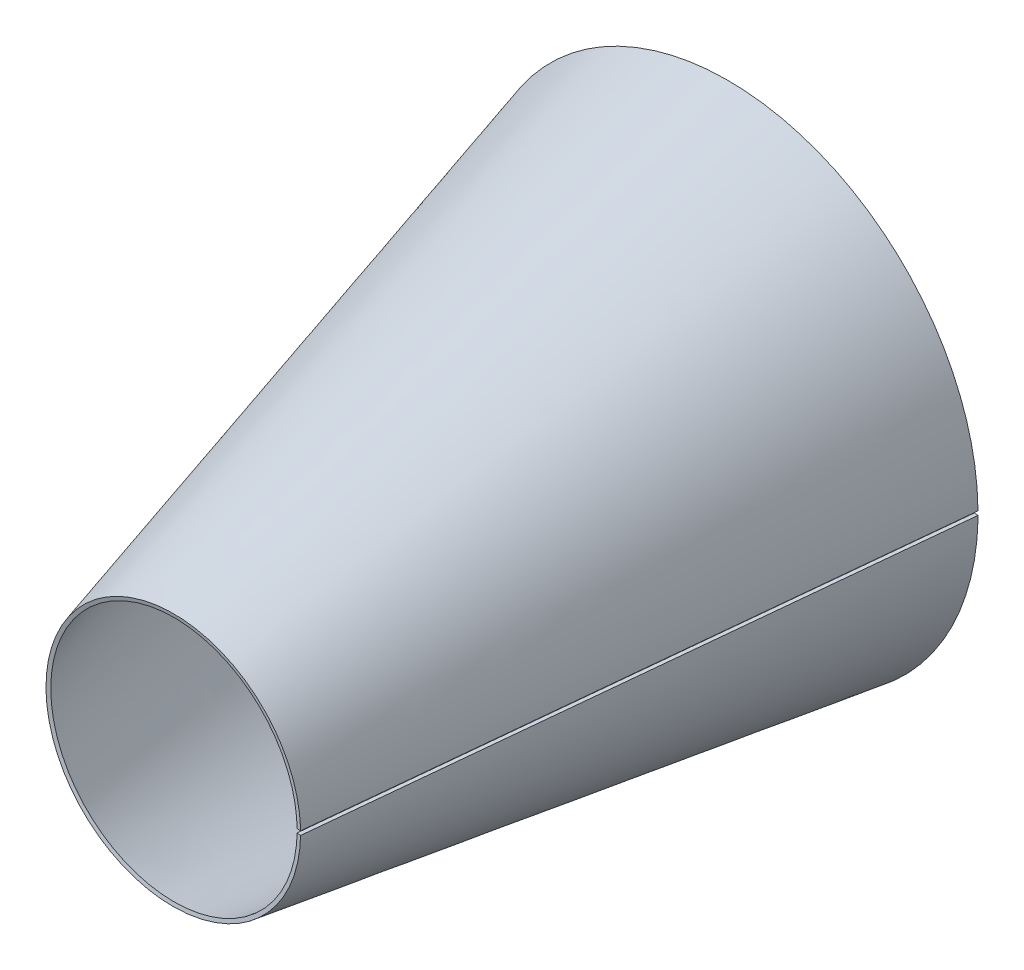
ISO-10303-21;
HEADER;
FILE_DESCRIPTION(('STEP AP214'),'2;1');
FILE_NAME('part.step','',(''),(''),'','','');
FILE_SCHEMA(('AUTOMOTIVE_DESIGN { 1 0 10303 214 1 1 1 1 }'));
ENDSEC;
DATA;
#1=APPLICATION_CONTEXT('core data for automotive mechanical design processes');
#2=APPLICATION_PROTOCOL_DEFINITION('international standard','automotive_design',2000,#1);
#3=PRODUCT_CONTEXT('',#1,'mechanical');
#4=PRODUCT('Part','Part','',(#3));
#5=PRODUCT_RELATED_PRODUCT_CATEGORY('part','',(#4));
#6=PRODUCT_DEFINITION_FORMATION('','',#4);
#7=PRODUCT_DEFINITION_CONTEXT('part definition',#1,'design');
#8=PRODUCT_DEFINITION('design','',#6,#7);
#9=PRODUCT_DEFINITION_SHAPE('','',#8);
#10=(LENGTH_UNIT() NAMED_UNIT(*) SI_UNIT(.MILLI.,.METRE.));
#11=(NAMED_UNIT(*) PLANE_ANGLE_UNIT() SI_UNIT($,.RADIAN.));
#12=(NAMED_UNIT(*) SI_UNIT($,.STERADIAN.) SOLID_ANGLE_UNIT());
#13=UNCERTAINTY_MEASURE_WITH_UNIT(LENGTH_MEASURE(1.E-05),#10,'distance_accuracy_value','');
#14=(GEOMETRIC_REPRESENTATION_CONTEXT(3) GLOBAL_UNCERTAINTY_ASSIGNED_CONTEXT((#13)) GLOBAL_UNIT_ASSIGNED_CONTEXT((#10,
#11,#12)) REPRESENTATION_CONTEXT('',''));
#15=CARTESIAN_POINT('',(0.,0.,0.));
#16=DIRECTION('',(0.,0.,1.));
#17=DIRECTION('',(1.,0.,0.));
#18=AXIS2_PLACEMENT_3D('',#15,#16,#17);
#19=CARTESIAN_POINT('',(77.7732271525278,0.818431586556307,254.157962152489));
#20=CARTESIAN_POINT('',(77.7501539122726,2.29447653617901,254.158034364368));
#21=CARTESIAN_POINT('',(77.6654098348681,3.95558510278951,254.158288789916));
#22=CARTESIAN_POINT('',(77.3422262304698,6.82209916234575,254.159240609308));
#23=CARTESIAN_POINT('',(77.2008608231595,7.84286985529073,254.159673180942));
#24=CARTESIAN_POINT('',(76.8218258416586,10.0311407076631,254.160786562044));
#25=CARTESIAN_POINT('',(76.5836682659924,11.2023826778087,254.161519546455));
#26=CARTESIAN_POINT('',(75.9679416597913,13.7158710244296,254.163323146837));
#27=CARTESIAN_POINT('',(75.5894286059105,15.0629930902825,254.164493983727));
#28=CARTESIAN_POINT('',(74.629582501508,17.9524331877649,254.167296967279));
#29=CARTESIAN_POINT('',(74.0465346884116,19.5011045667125,254.169108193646));
#30=CARTESIAN_POINT('',(72.584309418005,22.8116415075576,254.173364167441));
#31=CARTESIAN_POINT('',(71.7021339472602,24.5817076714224,254.176112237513));
#32=CARTESIAN_POINT('',(69.5057238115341,28.3329704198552,254.182484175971));
#33=CARTESIAN_POINT('',(68.187415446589,30.3232046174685,254.186502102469));
#34=CARTESIAN_POINT('',(65.7389745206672,33.4322407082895,254.193717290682));
#35=CARTESIAN_POINT('',(64.8429697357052,34.4898426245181,254.196400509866));
#36=CARTESIAN_POINT('',(62.8632907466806,36.6295201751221,254.202224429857));
#37=CARTESIAN_POINT('',(61.7784746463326,37.7128605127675,254.205465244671));
#38=CARTESIAN_POINT('',(59.3882870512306,39.8792176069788,254.212482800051));
#39=CARTESIAN_POINT('',(58.0815830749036,40.9634538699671,254.216373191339));
#40=CARTESIAN_POINT('',(55.2134900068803,43.0943474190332,254.224774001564));
#41=CARTESIAN_POINT('',(53.6506236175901,44.1420799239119,254.229405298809));
#42=CARTESIAN_POINT('',(50.2383701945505,46.1467277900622,254.239371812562));
#43=CARTESIAN_POINT('',(48.387476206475,47.1044487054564,254.244822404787));
#44=CARTESIAN_POINT('',(44.3756525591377,48.8567516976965,254.256500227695));
#45=CARTESIAN_POINT('',(42.2134059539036,49.6517393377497,254.262816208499));
#46=CARTESIAN_POINT('',(37.572783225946,50.9859437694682,254.276268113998));
#47=CARTESIAN_POINT('',(35.0936332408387,51.5250825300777,254.283436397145));
#48=CARTESIAN_POINT('',(29.8425380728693,52.2376186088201,254.298579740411));
#49=CARTESIAN_POINT('',(27.0708416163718,52.4105076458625,254.306496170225));
#50=CARTESIAN_POINT('',(21.3004567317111,52.2732867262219,254.323031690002));
#51=CARTESIAN_POINT('',(18.3035551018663,51.9625411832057,254.331471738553));
#52=CARTESIAN_POINT('',(12.2005997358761,50.7527583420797,254.348825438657));
#53=CARTESIAN_POINT('',(9.0982080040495,49.8535771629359,254.35743084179));
#54=CARTESIAN_POINT('',(2.95330294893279,47.4008839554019,254.374744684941));
#55=CARTESIAN_POINT('',(-0.0838174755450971,45.848551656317,254.383041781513));
#56=CARTESIAN_POINT('',(-5.89575635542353,42.0910792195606,254.399249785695));
#57=CARTESIAN_POINT('',(-8.66428431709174,39.8891246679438,254.406708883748));
#58=CARTESIAN_POINT('',(-13.738587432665,34.9183791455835,254.420707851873));
#59=CARTESIAN_POINT('',(-16.0385354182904,32.1548128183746,254.426835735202));
#60=CARTESIAN_POINT('',(-20.0203997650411,26.224978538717,254.437707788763));
#61=CARTESIAN_POINT('',(-21.6982372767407,23.0651107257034,254.442145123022));
#62=CARTESIAN_POINT('',(-24.3594078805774,16.5536740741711,254.44934712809));
#63=CARTESIAN_POINT('',(-25.340945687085,13.2082508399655,254.451934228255));
#64=CARTESIAN_POINT('',(-26.6214783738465,6.53909830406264,254.45537731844));
#65=CARTESIAN_POINT('',(-26.9205492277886,3.22033259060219,254.456164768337));
#66=CARTESIAN_POINT('',(-26.9205492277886,-3.22033259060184,254.456164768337));
#67=CARTESIAN_POINT('',(-26.6215348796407,-6.53879611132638,254.455382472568));
#68=CARTESIAN_POINT('',(-25.3408891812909,-13.208553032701,254.451929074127));
#69=CARTESIAN_POINT('',(-24.3594825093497,-16.5534863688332,254.449353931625));
#70=CARTESIAN_POINT('',(-21.6981626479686,-23.0652984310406,254.442138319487));
#71=CARTESIAN_POINT('',(-20.0204220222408,-26.2249443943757,254.437709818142));
#72=CARTESIAN_POINT('',(-16.0385131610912,-32.1548469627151,254.426833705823));
#73=CARTESIAN_POINT('',(-13.7384937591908,-34.9184740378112,254.420699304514));
#74=CARTESIAN_POINT('',(-8.66437799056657,-39.8890297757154,254.406717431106));
#75=CARTESIAN_POINT('',(-5.89553188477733,-42.091230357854,254.399229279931));
#76=CARTESIAN_POINT('',(-0.0840419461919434,-45.8484005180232,254.383062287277));
#77=CARTESIAN_POINT('',(2.95361569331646,-47.4010158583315,254.374716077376));
#78=CARTESIAN_POINT('',(9.09789525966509,-49.8534452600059,254.357459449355));
#79=CARTESIAN_POINT('',(12.2009297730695,-50.7528303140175,254.348795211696));
#80=CARTESIAN_POINT('',(18.303225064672,-51.9624692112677,254.331501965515));
#81=CARTESIAN_POINT('',(21.3007428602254,-52.2732986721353,254.323005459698));
#82=CARTESIAN_POINT('',(27.0705554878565,-52.4104956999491,254.306522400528));
#83=CARTESIAN_POINT('',(29.8427492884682,-52.2375934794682,254.298560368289));
#84=CARTESIAN_POINT('',(35.0934220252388,-51.5251076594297,254.283455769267));
#85=CARTESIAN_POINT('',(37.5729172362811,-50.9859073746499,254.276255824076));
#86=CARTESIAN_POINT('',(42.2132719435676,-49.6517757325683,254.262828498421));
#87=CARTESIAN_POINT('',(44.3757236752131,-48.856721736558,254.256493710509));
#88=CARTESIAN_POINT('',(48.3874050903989,-47.1044786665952,254.244828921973));
#89=CARTESIAN_POINT('',(50.2383976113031,-46.146712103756,254.239369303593));
#90=CARTESIAN_POINT('',(53.6505962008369,-44.1420956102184,254.229407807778));
#91=CARTESIAN_POINT('',(55.2134908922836,-43.0943467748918,254.22477392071));
#92=CARTESIAN_POINT('',(58.0815821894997,-40.9634545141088,254.216373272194));
#93=CARTESIAN_POINT('',(59.3882740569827,-39.8792291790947,254.2124839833));
#94=CARTESIAN_POINT('',(61.7784876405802,-37.712848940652,254.205464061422));
#95=CARTESIAN_POINT('',(62.8632720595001,-36.6295400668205,254.202226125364));
#96=CARTESIAN_POINT('',(64.8429884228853,-34.4898227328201,254.196398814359));
#97=CARTESIAN_POINT('',(65.7393228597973,-33.4318043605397,254.193685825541));
#98=CARTESIAN_POINT('',(68.1867187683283,-30.3240773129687,254.18656503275));
#99=CARTESIAN_POINT('',(69.5054756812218,-28.3333893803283,254.182506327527));
#100=CARTESIAN_POINT('',(71.7023820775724,-24.5812887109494,254.176090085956));
#101=CARTESIAN_POINT('',(72.5841434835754,-22.8120134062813,254.17337873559));
#102=CARTESIAN_POINT('',(74.046700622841,-19.5007326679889,254.169093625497));
#103=CARTESIAN_POINT('',(74.6294815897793,-17.952734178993,254.167305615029));
#104=CARTESIAN_POINT('',(75.5895295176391,-15.0626920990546,254.164485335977));
#105=CARTESIAN_POINT('',(75.9678840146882,-13.7161043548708,254.163327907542));
#106=CARTESIAN_POINT('',(76.5837259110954,-11.2021493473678,254.161514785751));
#107=CARTESIAN_POINT('',(76.8217948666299,-10.0313181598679,254.160788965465));
#108=CARTESIAN_POINT('',(77.2008917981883,-7.84269240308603,254.15967077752));
#109=CARTESIAN_POINT('',(77.3423049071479,-6.82140595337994,254.159235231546));
#110=CARTESIAN_POINT('',(77.6652524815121,-3.95697152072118,254.158299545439));
#111=CARTESIAN_POINT('',(77.7501702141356,-2.29343367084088,254.158034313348));
#112=CARTESIAN_POINT('',(77.7732271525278,-0.818431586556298,254.157962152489));
#113=CARTESIAN_POINT('',(76.1937984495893,0.79375,254.));
#114=CARTESIAN_POINT('',(76.1714060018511,2.22669170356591,254.));
#115=CARTESIAN_POINT('',(76.0893681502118,3.83537518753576,254.));
#116=CARTESIAN_POINT('',(75.7758668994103,6.61683993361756,254.));
#117=CARTESIAN_POINT('',(75.6389606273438,7.60578324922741,254.));
#118=CARTESIAN_POINT('',(75.2712577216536,9.72927320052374,254.));
#119=CARTESIAN_POINT('',(75.0406408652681,10.863862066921,254.));
#120=CARTESIAN_POINT('',(74.4432798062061,13.3031361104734,254.));
#121=CARTESIAN_POINT('',(74.0768002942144,14.6079456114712,254.));
#122=CARTESIAN_POINT('',(73.1455115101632,17.412325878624,254.));
#123=CARTESIAN_POINT('',(72.581071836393,18.9121976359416,254.));
#124=CARTESIAN_POINT('',(71.1622399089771,22.1255995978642,254.));
#125=CARTESIAN_POINT('',(70.3082985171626,23.8397916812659,254.));
#126=CARTESIAN_POINT('',(68.1769291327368,27.4813623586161,254.));
#127=CARTESIAN_POINT('',(66.899846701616,29.4100844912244,254.));
#128=CARTESIAN_POINT('',(64.5252950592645,32.4266691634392,254.));
#129=CARTESIAN_POINT('',(63.6568163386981,33.4522830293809,254.));
#130=CARTESIAN_POINT('',(61.7368377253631,35.5284880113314,254.));
#131=CARTESIAN_POINT('',(60.6852990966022,36.579175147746,254.));
#132=CARTESIAN_POINT('',(58.3671345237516,38.6814739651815,254.));
#133=CARTESIAN_POINT('',(57.1004239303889,39.7331974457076,254.));
#134=CARTESIAN_POINT('',(54.318676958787,41.8013633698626,254.));
#135=CARTESIAN_POINT('',(52.8034867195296,42.8179179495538,254.));
#136=CARTESIAN_POINT('',(49.4938527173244,44.7639524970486,254.));
#137=CARTESIAN_POINT('',(47.6991625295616,45.6935101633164,254.));
#138=CARTESIAN_POINT('',(43.8078303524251,47.3951611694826,254.));
#139=CARTESIAN_POINT('',(41.7108396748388,48.1672358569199,254.));
#140=CARTESIAN_POINT('',(37.2093528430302,49.4637775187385,254.));
#141=CARTESIAN_POINT('',(34.8044355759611,49.9880412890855,254.));
#142=CARTESIAN_POINT('',(29.7104093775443,50.6820288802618,254.));
#143=CARTESIAN_POINT('',(27.0209100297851,50.8512755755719,254.));
#144=CARTESIAN_POINT('',(21.4225675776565,50.7213920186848,254.));
#145=CARTESIAN_POINT('',(18.5135586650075,50.4214848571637,254.));
#146=CARTESIAN_POINT('',(12.5917610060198,49.251377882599,254.));
#147=CARTESIAN_POINT('',(9.5792694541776,48.3802316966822,254.));
#148=CARTESIAN_POINT('',(3.61572407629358,46.0042134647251,254.));
#149=CARTESIAN_POINT('',(0.665567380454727,44.4985602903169,254.));
#150=CARTESIAN_POINT('',(-4.97603377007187,40.8559738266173,254.));
#151=CARTESIAN_POINT('',(-7.66613254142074,38.7188551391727,254.));
#152=CARTESIAN_POINT('',(-12.5928759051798,33.8977911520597,254.));
#153=CARTESIAN_POINT('',(-14.8282080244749,31.214500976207,254.));
#154=CARTESIAN_POINT('',(-18.6951930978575,25.4611024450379,254.));
#155=CARTESIAN_POINT('',(-20.3261328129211,22.392303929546,254.));
#156=CARTESIAN_POINT('',(-22.9110700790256,16.0728032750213,254.));
#157=CARTESIAN_POINT('',(-23.8652210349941,12.8235192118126,254.));
#158=CARTESIAN_POINT('',(-25.1092718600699,6.34965390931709,254.));
#159=CARTESIAN_POINT('',(-25.4,3.12605696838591,254.));
#160=CARTESIAN_POINT('',(-25.4,-3.12605696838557,254.));
#161=CARTESIAN_POINT('',(-25.10927186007,-6.34965390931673,254.));
#162=CARTESIAN_POINT('',(-23.8652210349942,-12.8235192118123,254.));
#163=CARTESIAN_POINT('',(-22.9110700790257,-16.072803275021,254.));
#164=CARTESIAN_POINT('',(-20.3261328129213,-22.3923039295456,254.));
#165=CARTESIAN_POINT('',(-18.6951930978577,-25.4611024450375,254.));
#166=CARTESIAN_POINT('',(-14.8282080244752,-31.2145009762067,254.));
#167=CARTESIAN_POINT('',(-12.5928759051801,-33.8977911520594,254.));
#168=CARTESIAN_POINT('',(-7.66613254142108,-38.7188551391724,254.));
#169=CARTESIAN_POINT('',(-4.97603377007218,-40.8559738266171,254.));
#170=CARTESIAN_POINT('',(0.66556738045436,-44.4985602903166,254.));
#171=CARTESIAN_POINT('',(3.61572407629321,-46.0042134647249,254.));
#172=CARTESIAN_POINT('',(9.57926945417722,-48.380231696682,254.));
#173=CARTESIAN_POINT('',(12.5917610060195,-49.2513778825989,254.));
#174=CARTESIAN_POINT('',(18.513558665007,-50.4214848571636,254.));
#175=CARTESIAN_POINT('',(21.422567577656,-50.7213920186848,254.));
#176=CARTESIAN_POINT('',(27.0209100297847,-50.8512755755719,254.));
#177=CARTESIAN_POINT('',(29.7104093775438,-50.6820288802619,254.));
#178=CARTESIAN_POINT('',(34.8044355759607,-49.9880412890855,254.));
#179=CARTESIAN_POINT('',(37.2093528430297,-49.4637775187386,254.));
#180=CARTESIAN_POINT('',(41.7108396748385,-48.16723585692,254.));
#181=CARTESIAN_POINT('',(43.8078303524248,-47.3951611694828,254.));
#182=CARTESIAN_POINT('',(47.6991625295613,-45.6935101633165,254.));
#183=CARTESIAN_POINT('',(49.4938527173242,-44.7639524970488,254.));
#184=CARTESIAN_POINT('',(52.8034867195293,-42.8179179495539,254.));
#185=CARTESIAN_POINT('',(54.3186769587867,-41.8013633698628,254.));
#186=CARTESIAN_POINT('',(57.1004239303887,-39.7331974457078,254.));
#187=CARTESIAN_POINT('',(58.3671345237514,-38.6814739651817,254.));
#188=CARTESIAN_POINT('',(60.685299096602,-36.5791751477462,254.));
#189=CARTESIAN_POINT('',(61.7368377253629,-35.5284880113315,254.));
#190=CARTESIAN_POINT('',(63.6568163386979,-33.4522830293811,254.));
#191=CARTESIAN_POINT('',(64.5252950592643,-32.4266691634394,254.));
#192=CARTESIAN_POINT('',(66.899846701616,-29.4100844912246,254.));
#193=CARTESIAN_POINT('',(68.1769291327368,-27.4813623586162,254.));
#194=CARTESIAN_POINT('',(70.3082985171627,-23.839791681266,254.));
#195=CARTESIAN_POINT('',(71.1622399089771,-22.1255995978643,254.));
#196=CARTESIAN_POINT('',(72.5810718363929,-18.9121976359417,254.));
#197=CARTESIAN_POINT('',(73.1455115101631,-17.4123258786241,254.));
#198=CARTESIAN_POINT('',(74.0768002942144,-14.6079456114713,254.));
#199=CARTESIAN_POINT('',(74.4432798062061,-13.3031361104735,254.));
#200=CARTESIAN_POINT('',(75.0406408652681,-10.8638620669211,254.));
#201=CARTESIAN_POINT('',(75.2712577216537,-9.72927320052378,254.));
#202=CARTESIAN_POINT('',(75.6389606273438,-7.60578324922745,254.));
#203=CARTESIAN_POINT('',(75.7758668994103,-6.6168399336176,254.));
#204=CARTESIAN_POINT('',(76.0893681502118,-3.83537518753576,254.));
#205=CARTESIAN_POINT('',(76.1714060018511,-2.22669170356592,254.));
#206=CARTESIAN_POINT('',(76.1937984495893,-0.793749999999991,254.));
#207=B_SPLINE_SURFACE_WITH_KNOTS('',1,3,((#19,#20,#21,#22,#23,#24,#25,#26,#27,#28,#29,#30,#31,
#32,#33,#34,#35,#36,#37,#38,#39,#40,#41,#42,#43,#44,#45,#46,#47,#48,#49,#50,#51,#52,#53,#54,#55,
#56,#57,#58,#59,#60,#61,#62,#63,#64,#65,#66,#67,#68,#69,#70,#71,#72,#73,#74,#75,#76,#77,#78,#79,
#80,#81,#82,#83,#84,#85,#86,#87,#88,#89,#90,#91,#92,#93,#94,#95,#96,#97,#98,#99,#100,#101,#102,
#103,#104,#105,#106,#107,#108,#109,#110,#111,#112),(#113,#114,#115,#116,#117,#118,#119,#120,
#121,#122,#123,#124,#125,#126,#127,#128,#129,#130,#131,#132,#133,#134,#135,#136,#137,#138,#139,
#140,#141,#142,#143,#144,#145,#146,#147,#148,#149,#150,#151,#152,#153,#154,#155,#156,#157,#158,
#159,#160,#161,#162,#163,#164,#165,#166,#167,#168,#169,#170,#171,#172,#173,#174,#175,#176,#177,
#178,#179,#180,#181,#182,#183,#184,#185,#186,#187,#188,#189,#190,#191,#192,#193,#194,#195,#196,
#197,#198,#199,#200,#201,#202,#203,#204,#205,#206)),.UNSPECIFIED.,.F.,.F.,.F.,(2,2),(4,2,2,2,2,
2,2,2,2,2,2,2,2,2,2,2,2,2,2,2,2,2,2,2,2,2,2,2,2,2,2,2,2,2,2,2,2,2,2,2,2,2,2,2,2,2,4),(0.,1.),
(0.,0.0625,0.09375,0.125,0.15625,0.1875,0.21875,0.25,0.265625,0.28125,0.296875,0.3125,0.328125,
0.34375,0.359375,0.375,0.390625,0.40625,0.421875,0.4375,0.453125,0.46875,0.484375,0.5,0.515625,
0.53125,0.546875,0.5625,0.578125,0.59375,0.609375,0.625,0.640625,0.65625,0.671875,0.6875,
0.703125,0.71875,0.734375,0.75,0.78125,0.8125,0.84375,0.875,0.90625,0.9375,1.),.UNSPECIFIED.);
#208=CARTESIAN_POINT('',(76.1937984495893,-0.793749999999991,254.));
#209=CARTESIAN_POINT('',(77.7732271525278,-0.818431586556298,254.157962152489));
#210=B_SPLINE_CURVE_WITH_KNOTS('',1,(#208,#209),.UNSPECIFIED.,.F.,.F.,(2,2),(0.,1.),.UNSPECIFIED.);
#211=CARTESIAN_POINT('',(76.1937984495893,-0.793749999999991,254.));
#212=VERTEX_POINT('',#211);
#213=CARTESIAN_POINT('',(77.7732271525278,-0.818431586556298,254.157962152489));
#214=VERTEX_POINT('',#213);
#215=EDGE_CURVE('E14',#212,#214,#210,.T.);
#216=CARTESIAN_POINT('',(76.1937984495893,-0.793749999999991,254.));
#217=CARTESIAN_POINT('',(76.1714060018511,-2.22669170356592,254.));
#218=CARTESIAN_POINT('',(76.0893681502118,-3.83537518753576,254.));
#219=CARTESIAN_POINT('',(75.7758668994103,-6.6168399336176,254.));
#220=CARTESIAN_POINT('',(75.6389606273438,-7.60578324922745,254.));
#221=CARTESIAN_POINT('',(75.2712577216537,-9.72927320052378,254.));
#222=CARTESIAN_POINT('',(75.0406408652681,-10.8638620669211,254.));
#223=CARTESIAN_POINT('',(74.4432798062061,-13.3031361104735,254.));
#224=CARTESIAN_POINT('',(74.0768002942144,-14.6079456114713,254.));
#225=CARTESIAN_POINT('',(73.1455115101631,-17.4123258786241,254.));
#226=CARTESIAN_POINT('',(72.5810718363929,-18.9121976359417,254.));
#227=CARTESIAN_POINT('',(71.1622399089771,-22.1255995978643,254.));
#228=CARTESIAN_POINT('',(70.3082985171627,-23.839791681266,254.));
#229=CARTESIAN_POINT('',(68.1769291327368,-27.4813623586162,254.));
#230=CARTESIAN_POINT('',(66.899846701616,-29.4100844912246,254.));
#231=CARTESIAN_POINT('',(64.5252950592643,-32.4266691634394,254.));
#232=CARTESIAN_POINT('',(63.6568163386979,-33.4522830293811,254.));
#233=CARTESIAN_POINT('',(61.7368377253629,-35.5284880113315,254.));
#234=CARTESIAN_POINT('',(60.685299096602,-36.5791751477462,254.));
#235=CARTESIAN_POINT('',(58.3671345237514,-38.6814739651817,254.));
#236=CARTESIAN_POINT('',(57.1004239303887,-39.7331974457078,254.));
#237=CARTESIAN_POINT('',(54.3186769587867,-41.8013633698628,254.));
#238=CARTESIAN_POINT('',(52.8034867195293,-42.8179179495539,254.));
#239=CARTESIAN_POINT('',(49.4938527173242,-44.7639524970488,254.));
#240=CARTESIAN_POINT('',(47.6991625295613,-45.6935101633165,254.));
#241=CARTESIAN_POINT('',(43.8078303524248,-47.3951611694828,254.));
#242=CARTESIAN_POINT('',(41.7108396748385,-48.16723585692,254.));
#243=CARTESIAN_POINT('',(37.2093528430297,-49.4637775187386,254.));
#244=CARTESIAN_POINT('',(34.8044355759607,-49.9880412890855,254.));
#245=CARTESIAN_POINT('',(29.7104093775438,-50.6820288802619,254.));
#246=CARTESIAN_POINT('',(27.0209100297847,-50.8512755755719,254.));
#247=CARTESIAN_POINT('',(21.422567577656,-50.7213920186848,254.));
#248=CARTESIAN_POINT('',(18.513558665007,-50.4214848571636,254.));
#249=CARTESIAN_POINT('',(12.5917610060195,-49.2513778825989,254.));
#250=CARTESIAN_POINT('',(9.57926945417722,-48.380231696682,254.));
#251=CARTESIAN_POINT('',(3.61572407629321,-46.0042134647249,254.));
#252=CARTESIAN_POINT('',(0.66556738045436,-44.4985602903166,254.));
#253=CARTESIAN_POINT('',(-4.97603377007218,-40.8559738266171,254.));
#254=CARTESIAN_POINT('',(-7.66613254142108,-38.7188551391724,254.));
#255=CARTESIAN_POINT('',(-12.5928759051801,-33.8977911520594,254.));
#256=CARTESIAN_POINT('',(-14.8282080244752,-31.2145009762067,254.));
#257=CARTESIAN_POINT('',(-18.6951930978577,-25.4611024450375,254.));
#258=CARTESIAN_POINT('',(-20.3261328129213,-22.3923039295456,254.));
#259=CARTESIAN_POINT('',(-22.9110700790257,-16.072803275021,254.));
#260=CARTESIAN_POINT('',(-23.8652210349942,-12.8235192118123,254.));
#261=CARTESIAN_POINT('',(-25.10927186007,-6.34965390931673,254.));
#262=CARTESIAN_POINT('',(-25.4,-3.12605696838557,254.));
#263=CARTESIAN_POINT('',(-25.4,3.12605696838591,254.));
#264=CARTESIAN_POINT('',(-25.1092718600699,6.34965390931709,254.));
#265=CARTESIAN_POINT('',(-23.8652210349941,12.8235192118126,254.));
#266=CARTESIAN_POINT('',(-22.9110700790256,16.0728032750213,254.));
#267=CARTESIAN_POINT('',(-20.3261328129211,22.392303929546,254.));
#268=CARTESIAN_POINT('',(-18.6951930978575,25.4611024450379,254.));
#269=CARTESIAN_POINT('',(-14.8282080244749,31.214500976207,254.));
#270=CARTESIAN_POINT('',(-12.5928759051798,33.8977911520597,254.));
#271=CARTESIAN_POINT('',(-7.66613254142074,38.7188551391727,254.));
#272=CARTESIAN_POINT('',(-4.97603377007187,40.8559738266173,254.));
#273=CARTESIAN_POINT('',(0.665567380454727,44.4985602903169,254.));
#274=CARTESIAN_POINT('',(3.61572407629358,46.0042134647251,254.));
#275=CARTESIAN_POINT('',(9.5792694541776,48.3802316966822,254.));
#276=CARTESIAN_POINT('',(12.5917610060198,49.251377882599,254.));
#277=CARTESIAN_POINT('',(18.5135586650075,50.4214848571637,254.));
#278=CARTESIAN_POINT('',(21.4225675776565,50.7213920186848,254.));
#279=CARTESIAN_POINT('',(27.0209100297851,50.8512755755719,254.));
#280=CARTESIAN_POINT('',(29.7104093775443,50.6820288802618,254.));
#281=CARTESIAN_POINT('',(34.8044355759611,49.9880412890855,254.));
#282=CARTESIAN_POINT('',(37.2093528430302,49.4637775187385,254.));
#283=CARTESIAN_POINT('',(41.7108396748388,48.1672358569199,254.));
#284=CARTESIAN_POINT('',(43.8078303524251,47.3951611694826,254.));
#285=CARTESIAN_POINT('',(47.6991625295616,45.6935101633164,254.));
#286=CARTESIAN_POINT('',(49.4938527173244,44.7639524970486,254.));
#287=CARTESIAN_POINT('',(52.8034867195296,42.8179179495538,254.));
#288=CARTESIAN_POINT('',(54.318676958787,41.8013633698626,254.));
#289=CARTESIAN_POINT('',(57.1004239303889,39.7331974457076,254.));
#290=CARTESIAN_POINT('',(58.3671345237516,38.6814739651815,254.));
#291=CARTESIAN_POINT('',(60.6852990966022,36.579175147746,254.));
#292=CARTESIAN_POINT('',(61.7368377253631,35.5284880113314,254.));
#293=CARTESIAN_POINT('',(63.6568163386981,33.4522830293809,254.));
#294=CARTESIAN_POINT('',(64.5252950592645,32.4266691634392,254.));
#295=CARTESIAN_POINT('',(66.899846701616,29.4100844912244,254.));
#296=CARTESIAN_POINT('',(68.1769291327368,27.4813623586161,254.));
#297=CARTESIAN_POINT('',(70.3082985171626,23.8397916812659,254.));
#298=CARTESIAN_POINT('',(71.1622399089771,22.1255995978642,254.));
#299=CARTESIAN_POINT('',(72.581071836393,18.9121976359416,254.));
#300=CARTESIAN_POINT('',(73.1455115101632,17.412325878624,254.));
#301=CARTESIAN_POINT('',(74.0768002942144,14.6079456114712,254.));
#302=CARTESIAN_POINT('',(74.4432798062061,13.3031361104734,254.));
#303=CARTESIAN_POINT('',(75.0406408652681,10.863862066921,254.));
#304=CARTESIAN_POINT('',(75.2712577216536,9.72927320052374,254.));
#305=CARTESIAN_POINT('',(75.6389606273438,7.60578324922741,254.));
#306=CARTESIAN_POINT('',(75.7758668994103,6.61683993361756,254.));
#307=CARTESIAN_POINT('',(76.0893681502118,3.83537518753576,254.));
#308=CARTESIAN_POINT('',(76.1714060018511,2.22669170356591,254.));
#309=CARTESIAN_POINT('',(76.1937984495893,0.79375,254.));
#310=B_SPLINE_CURVE_WITH_KNOTS('',3,(#216,#217,#218,#219,#220,#221,#222,#223,#224,#225,#226,
#227,#228,#229,#230,#231,#232,#233,#234,#235,#236,#237,#238,#239,#240,#241,#242,#243,#244,#245,
#246,#247,#248,#249,#250,#251,#252,#253,#254,#255,#256,#257,#258,#259,#260,#261,#262,#263,#264,
#265,#266,#267,#268,#269,#270,#271,#272,#273,#274,#275,#276,#277,#278,#279,#280,#281,#282,#283,
#284,#285,#286,#287,#288,#289,#290,#291,#292,#293,#294,#295,#296,#297,#298,#299,#300,#301,#302,
#303,#304,#305,#306,#307,#308,#309),.UNSPECIFIED.,.F.,.F.,(4,2,2,2,2,2,2,2,2,2,2,2,2,2,2,2,2,2,
2,2,2,2,2,2,2,2,2,2,2,2,2,2,2,2,2,2,2,2,2,2,2,2,2,2,2,2,4),(0.,0.0625,0.09375,0.125,0.15625,
0.1875,0.21875,0.25,0.265625,0.28125,0.296875,0.3125,0.328125,0.34375,0.359375,0.375,0.390625,
0.40625,0.421875,0.4375,0.453125,0.46875,0.484375,0.5,0.515625,0.53125,0.546875,0.5625,0.578125,
0.59375,0.609375,0.625,0.640625,0.65625,0.671875,0.6875,0.703125,0.71875,0.734375,0.75,0.78125,
0.8125,0.84375,0.875,0.90625,0.9375,1.),.UNSPECIFIED.);
#311=CARTESIAN_POINT('',(76.1937984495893,0.79375,254.));
#312=VERTEX_POINT('',#311);
#313=EDGE_CURVE('E497',#212,#312,#310,.T.);
#314=CARTESIAN_POINT('',(76.1937984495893,0.79375,254.));
#315=CARTESIAN_POINT('',(77.7732271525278,0.818431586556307,254.157962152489));
#316=B_SPLINE_CURVE_WITH_KNOTS('',1,(#314,#315),.UNSPECIFIED.,.F.,.F.,(2,2),(0.,1.),.UNSPECIFIED.);
#317=CARTESIAN_POINT('',(77.7732271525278,0.818431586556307,254.157962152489));
#318=VERTEX_POINT('',#317);
#319=EDGE_CURVE('E446',#312,#318,#316,.T.);
#320=CARTESIAN_POINT('',(77.7732271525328,-0.818431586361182,254.15796215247));
#321=CARTESIAN_POINT('',(77.7673498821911,-1.19935403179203,254.157979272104));
#322=CARTESIAN_POINT('',(77.7574092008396,-1.58020235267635,254.158008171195));
#323=CARTESIAN_POINT('',(77.7282405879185,-2.3673275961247,254.158093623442));
#324=CARTESIAN_POINT('',(77.7084302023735,-2.77358290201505,254.158151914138));
#325=CARTESIAN_POINT('',(77.6291759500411,-4.07701896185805,254.15838708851));
#326=CARTESIAN_POINT('',(77.5507848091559,-4.97313386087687,254.158622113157));
#327=CARTESIAN_POINT('',(77.3940612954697,-6.36186043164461,254.159090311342));
#328=CARTESIAN_POINT('',(77.3312733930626,-6.85631078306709,254.159277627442));
#329=CARTESIAN_POINT('',(77.1861762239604,-7.88007490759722,254.159709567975));
#330=CARTESIAN_POINT('',(77.1027589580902,-8.40923345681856,254.159957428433));
#331=CARTESIAN_POINT('',(76.9128912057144,-9.50540109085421,254.160523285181));
#332=CARTESIAN_POINT('',(76.8051620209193,-10.072188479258,254.160845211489));
#333=CARTESIAN_POINT('',(76.5614837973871,-11.2467775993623,254.161571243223));
#334=CARTESIAN_POINT('',(76.4239716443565,-11.8542554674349,254.161979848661));
#335=CARTESIAN_POINT('',(76.1154860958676,-13.1136079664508,254.162899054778));
#336=CARTESIAN_POINT('',(75.9426933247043,-13.76503751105,254.163415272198));
#337=CARTESIAN_POINT('',(75.5560374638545,-15.115559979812,254.164567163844));
#338=CARTESIAN_POINT('',(75.3399344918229,-15.8140120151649,254.165209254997));
#339=CARTESIAN_POINT('',(74.8589268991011,-17.2620745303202,254.166641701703));
#340=CARTESIAN_POINT('',(74.5914072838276,-18.0108177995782,254.167440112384));
#341=CARTESIAN_POINT('',(73.9963600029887,-19.5621716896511,254.169212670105));
#342=CARTESIAN_POINT('',(73.6655948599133,-20.3635403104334,254.170196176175));
#343=CARTESIAN_POINT('',(72.9326335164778,-22.0230516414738,254.172373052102));
#344=CARTESIAN_POINT('',(72.5266536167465,-22.8795301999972,254.173577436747));
#345=CARTESIAN_POINT('',(71.8676415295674,-24.1763275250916,254.175550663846));
#346=CARTESIAN_POINT('',(71.6311737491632,-24.6251342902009,254.176261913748));
#347=CARTESIAN_POINT('',(71.1338077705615,-25.5366344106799,254.177741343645));
#348=CARTESIAN_POINT('',(70.8722835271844,-25.9989867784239,254.178510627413));
#349=CARTESIAN_POINT('',(70.3226268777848,-26.9378055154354,254.180123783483));
#350=CARTESIAN_POINT('',(70.0338194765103,-27.4138765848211,254.18096946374));
#351=CARTESIAN_POINT('',(69.4264498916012,-28.3798408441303,254.182769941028));
#352=CARTESIAN_POINT('',(69.1071225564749,-28.8692534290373,254.183728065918));
#353=CARTESIAN_POINT('',(68.4358763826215,-29.8608537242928,254.185744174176));
#354=CARTESIAN_POINT('',(68.0831268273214,-30.3624791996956,254.186804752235));
#355=CARTESIAN_POINT('',(67.3422881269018,-31.3775512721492,254.189001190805));
#356=CARTESIAN_POINT('',(66.9533139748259,-31.8903518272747,254.190138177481));
#357=CARTESIAN_POINT('',(66.1366384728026,-32.9271996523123,254.192546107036));
#358=CARTESIAN_POINT('',(65.7079737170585,-33.4504884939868,254.193820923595));
#359=CARTESIAN_POINT('',(64.8081447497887,-34.5062721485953,254.196488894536));
#360=CARTESIAN_POINT('',(64.3359281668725,-35.0378703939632,254.197884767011));
#361=CARTESIAN_POINT('',(63.345409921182,-36.1084286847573,254.20081387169));
#362=CARTESIAN_POINT('',(62.8259876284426,-36.6463522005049,254.202350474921));
#363=CARTESIAN_POINT('',(61.736927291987,-37.7266997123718,254.205568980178));
#364=CARTESIAN_POINT('',(61.166082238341,-38.2679074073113,254.207254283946));
#365=CARTESIAN_POINT('',(59.970206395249,-39.3517899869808,254.21078369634));
#366=CARTESIAN_POINT('',(59.3439030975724,-39.8930614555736,254.212631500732));
#367=CARTESIAN_POINT('',(58.0327834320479,-40.9727386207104,254.216495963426));
#368=CARTESIAN_POINT('',(57.3466204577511,-41.509509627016,254.218516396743));
#369=CARTESIAN_POINT('',(55.9117069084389,-42.5755922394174,254.222738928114));
#370=CARTESIAN_POINT('',(55.1615623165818,-43.1030287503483,254.224944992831));
#371=CARTESIAN_POINT('',(53.5945689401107,-44.1441889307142,254.229548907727));
#372=CARTESIAN_POINT('',(52.7762837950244,-44.655750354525,254.231950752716));
#373=CARTESIAN_POINT('',(51.0692376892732,-45.658596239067,254.236953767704));
#374=CARTESIAN_POINT('',(50.1790285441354,-46.1474236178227,254.239558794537));
#375=CARTESIAN_POINT('',(48.8061926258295,-46.8499637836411,254.2435807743));
#376=CARTESIAN_POINT('',(48.3333408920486,-47.0829708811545,254.244966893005));
#377=CARTESIAN_POINT('',(47.3687439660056,-47.5403139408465,254.247785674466));
#378=CARTESIAN_POINT('',(46.8768234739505,-47.7642812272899,254.249218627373));
#379=CARTESIAN_POINT('',(45.8737327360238,-48.2024106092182,254.252140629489));
#380=CARTESIAN_POINT('',(45.3623908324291,-48.416179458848,254.253630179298));
#381=CARTESIAN_POINT('',(44.3202598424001,-48.8325223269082,254.256667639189));
#382=CARTESIAN_POINT('',(43.7893047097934,-49.0346809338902,254.258216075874));
#383=CARTESIAN_POINT('',(42.7078955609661,-49.4263573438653,254.261367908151));
#384=CARTESIAN_POINT('',(42.157283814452,-49.6154397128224,254.262971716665));
#385=CARTESIAN_POINT('',(41.036515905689,-49.9795260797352,254.266228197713));
#386=CARTESIAN_POINT('',(40.4662111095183,-50.1540726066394,254.267881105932));
#387=CARTESIAN_POINT('',(39.3059805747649,-50.4876347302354,254.271243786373));
#388=CARTESIAN_POINT('',(38.7159158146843,-50.6461668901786,254.272953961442));
#389=CARTESIAN_POINT('',(37.5164264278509,-50.9460158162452,254.276428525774));
#390=CARTESIAN_POINT('',(36.9068762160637,-51.0868303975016,254.278193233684));
#391=CARTESIAN_POINT('',(35.6688044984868,-51.3495432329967,254.281775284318));
#392=CARTESIAN_POINT('',(35.040172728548,-51.4709220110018,254.28359289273));
#393=CARTESIAN_POINT('',(33.7643363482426,-51.6930704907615,254.287274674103));
#394=CARTESIAN_POINT('',(33.1170377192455,-51.7933004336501,254.289138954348));
#395=CARTESIAN_POINT('',(31.8042929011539,-51.9714142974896,254.292919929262));
#396=CARTESIAN_POINT('',(31.1387702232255,-52.048734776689,254.294836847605));
#397=CARTESIAN_POINT('',(29.790510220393,-52.1792027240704,254.298712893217));
#398=CARTESIAN_POINT('',(29.1077175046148,-52.2317781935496,254.300672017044));
#399=CARTESIAN_POINT('',(27.7259355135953,-52.3109524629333,254.304634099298));
#400=CARTESIAN_POINT('',(27.0269128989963,-52.3369700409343,254.306637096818));
#401=CARTESIAN_POINT('',(25.6137009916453,-52.3612331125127,254.310681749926));
#402=CARTESIAN_POINT('',(24.8995014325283,-52.3588839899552,254.312723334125));
#403=CARTESIAN_POINT('',(23.4570847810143,-52.3245602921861,254.316846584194));
#404=CARTESIAN_POINT('',(22.7288821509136,-52.291976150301,254.318928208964));
#405=CARTESIAN_POINT('',(21.2602365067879,-52.1955109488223,254.323112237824));
#406=CARTESIAN_POINT('',(20.5198328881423,-52.1310297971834,254.325214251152));
#407=CARTESIAN_POINT('',(19.0285655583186,-51.9691523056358,254.329445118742));
#408=CARTESIAN_POINT('',(18.2777664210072,-51.8711607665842,254.331573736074));
#409=CARTESIAN_POINT('',(16.7675022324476,-51.6406500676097,254.335854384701));
#410=CARTESIAN_POINT('',(16.0081280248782,-51.5075351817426,254.338006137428));
#411=CARTESIAN_POINT('',(14.4827465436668,-51.2051315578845,254.342328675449));
#412=CARTESIAN_POINT('',(13.7168570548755,-51.0352484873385,254.344499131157));
#413=CARTESIAN_POINT('',(12.1810808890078,-50.6582297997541,254.348830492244));
#414=CARTESIAN_POINT('',(11.4113320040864,-50.450532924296,254.350990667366));
#415=CARTESIAN_POINT('',(9.87035600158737,-49.996857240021,254.355310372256));
#416=CARTESIAN_POINT('',(9.09928736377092,-49.7503400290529,254.357469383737));
#417=CARTESIAN_POINT('',(7.55820837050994,-49.2179930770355,254.361788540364));
#418=CARTESIAN_POINT('',(6.78837821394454,-48.9316413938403,254.36394824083));
#419=CARTESIAN_POINT('',(5.25266918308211,-48.3186430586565,254.368256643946));
#420=CARTESIAN_POINT('',(4.48698944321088,-47.9914974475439,254.370404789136));
#421=CARTESIAN_POINT('',(2.96281865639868,-47.2968972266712,254.374655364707));
#422=CARTESIAN_POINT('',(2.2045299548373,-46.9289986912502,254.376756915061));
#423=CARTESIAN_POINT('',(0.698127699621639,-46.1528649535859,254.380926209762));
#424=CARTESIAN_POINT('',(-0.049777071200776,-45.7442244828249,254.382993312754));
#425=CARTESIAN_POINT('',(-1.53240094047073,-44.8865684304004,254.387100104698));
#426=CARTESIAN_POINT('',(-2.26690423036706,-44.4371796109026,254.389139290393));
#427=CARTESIAN_POINT('',(-3.71928885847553,-43.4981717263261,254.393170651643));
#428=CARTESIAN_POINT('',(-4.4369564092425,-43.0082219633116,254.395162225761));
#429=CARTESIAN_POINT('',(-5.85238563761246,-41.9894495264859,254.399064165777));
#430=CARTESIAN_POINT('',(-6.54995613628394,-41.4603613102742,254.400973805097));
#431=CARTESIAN_POINT('',(-7.92225940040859,-40.3645285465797,254.404724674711));
#432=CARTESIAN_POINT('',(-8.59681566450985,-39.7975629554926,254.406565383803));
#433=CARTESIAN_POINT('',(-9.92012538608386,-38.6271721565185,254.410188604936));
#434=CARTESIAN_POINT('',(-10.5687175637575,-38.0235645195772,254.411970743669));
#435=CARTESIAN_POINT('',(-11.836729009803,-36.781416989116,254.415453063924));
#436=CARTESIAN_POINT('',(-12.4560188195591,-36.1427449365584,254.417152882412));
#437=CARTESIAN_POINT('',(-13.662805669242,-34.8331353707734,254.420443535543));
#438=CARTESIAN_POINT('',(-14.2502206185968,-34.1621222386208,254.422034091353));
#439=CARTESIAN_POINT('',(-15.391008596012,-32.7901971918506,254.425117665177));
#440=CARTESIAN_POINT('',(-15.9443337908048,-32.0892455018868,254.426610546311));
#441=CARTESIAN_POINT('',(-17.0146516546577,-30.6597857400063,254.429510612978));
#442=CARTESIAN_POINT('',(-17.5316331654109,-29.9312693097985,254.430917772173));
#443=CARTESIAN_POINT('',(-18.5266804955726,-28.4494476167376,254.433624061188));
#444=CARTESIAN_POINT('',(-19.0047940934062,-27.6961744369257,254.434923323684));
#445=CARTESIAN_POINT('',(-19.9207330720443,-26.1683314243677,254.437397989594));
#446=CARTESIAN_POINT('',(-20.3586651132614,-25.3938255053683,254.438573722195));
#447=CARTESIAN_POINT('',(-21.1931591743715,-23.8265807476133,254.44081003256));
#448=CARTESIAN_POINT('',(-21.5898707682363,-23.0339215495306,254.441871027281));
#449=CARTESIAN_POINT('',(-22.3407983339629,-21.4334111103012,254.443888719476));
#450=CARTESIAN_POINT('',(-22.6952113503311,-20.6256523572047,254.444845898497));
#451=CARTESIAN_POINT('',(-23.3602794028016,-18.9984037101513,254.446640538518));
#452=CARTESIAN_POINT('',(-23.6712022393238,-18.1790232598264,254.447478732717));
#453=CARTESIAN_POINT('',(-24.2493656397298,-16.5321194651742,254.449030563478));
#454=CARTESIAN_POINT('',(-24.5169255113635,-15.7047081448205,254.449745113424));
#455=CARTESIAN_POINT('',(-25.0085867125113,-14.0448616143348,254.451055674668));
#456=CARTESIAN_POINT('',(-25.2330441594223,-13.2125318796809,254.451652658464));
#457=CARTESIAN_POINT('',(-25.638686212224,-11.5459490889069,254.452736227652));
#458=CARTESIAN_POINT('',(-25.8202698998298,-10.7117932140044,254.453223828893));
#459=CARTESIAN_POINT('',(-26.1403446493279,-9.04497910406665,254.454082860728));
#460=CARTESIAN_POINT('',(-26.2792972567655,-8.21240947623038,254.454455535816));
#461=CARTESIAN_POINT('',(-26.5154030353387,-6.55178328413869,254.455087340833));
#462=CARTESIAN_POINT('',(-26.6130477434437,-5.72379651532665,254.455347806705));
#463=CARTESIAN_POINT('',(-26.7678319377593,-4.07493981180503,254.455759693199));
#464=CARTESIAN_POINT('',(-26.8254830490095,-3.25411788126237,254.45591249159));
#465=CARTESIAN_POINT('',(-26.9015726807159,-1.62218055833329,254.456114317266));
#466=CARTESIAN_POINT('',(-26.920549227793,-0.811090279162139,254.456164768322));
#467=CARTESIAN_POINT('',(-26.9205492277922,0.81109027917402,254.456164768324));
#468=CARTESIAN_POINT('',(-26.9015726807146,1.62218055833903,254.456114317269));
#469=CARTESIAN_POINT('',(-26.8254830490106,3.2541178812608,254.455912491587));
#470=CARTESIAN_POINT('',(-26.7678319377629,4.07493981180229,254.455759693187));
#471=CARTESIAN_POINT('',(-26.6130477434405,5.72379651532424,254.455347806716));
#472=CARTESIAN_POINT('',(-26.5154030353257,6.55178328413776,254.455087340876));
#473=CARTESIAN_POINT('',(-26.2792972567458,8.21240947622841,254.454455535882));
#474=CARTESIAN_POINT('',(-26.1403446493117,9.04497910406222,254.454082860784));
#475=CARTESIAN_POINT('',(-25.8202698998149,10.7117932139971,254.453223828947));
#476=CARTESIAN_POINT('',(-25.6386862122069,11.5459490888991,254.452736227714));
#477=CARTESIAN_POINT('',(-25.2330441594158,13.2125318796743,254.45165265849));
#478=CARTESIAN_POINT('',(-25.008586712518,14.0448616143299,254.451055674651));
#479=CARTESIAN_POINT('',(-24.5169255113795,15.7047081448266,254.449745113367));
#480=CARTESIAN_POINT('',(-24.2493656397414,16.5321194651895,254.449030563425));
#481=CARTESIAN_POINT('',(-23.6712022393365,18.1790232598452,254.447478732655));
#482=CARTESIAN_POINT('',(-23.3602794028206,18.9984037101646,254.446640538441));
#483=CARTESIAN_POINT('',(-22.6952113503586,20.6256523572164,254.444845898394));
#484=CARTESIAN_POINT('',(-22.3407983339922,21.4334111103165,254.443888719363));
#485=CARTESIAN_POINT('',(-21.5898707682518,23.0339215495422,254.441871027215));
#486=CARTESIAN_POINT('',(-21.1931591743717,23.8265807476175,254.440810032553));
#487=CARTESIAN_POINT('',(-20.358665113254,25.3938255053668,254.43857372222));
#488=CARTESIAN_POINT('',(-19.920733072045,26.168331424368,254.437397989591));
#489=CARTESIAN_POINT('',(-19.0047940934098,27.6961744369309,254.434923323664));
#490=CARTESIAN_POINT('',(-18.5266804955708,28.4494476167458,254.433624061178));
#491=CARTESIAN_POINT('',(-17.5316331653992,29.931269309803,254.430917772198));
#492=CARTESIAN_POINT('',(-17.0146516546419,30.6597857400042,254.429510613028));
#493=CARTESIAN_POINT('',(-15.9443337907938,32.089245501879,254.42661054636));
#494=CARTESIAN_POINT('',(-15.3910085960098,32.7901971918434,254.425117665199));
#495=CARTESIAN_POINT('',(-14.2502206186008,34.1621222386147,254.422034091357));
#496=CARTESIAN_POINT('',(-13.6628056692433,34.8331353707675,254.420443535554));
#497=CARTESIAN_POINT('',(-12.4560188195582,36.1427449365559,254.417152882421));
#498=CARTESIAN_POINT('',(-11.8367290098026,36.7814169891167,254.415453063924));
#499=CARTESIAN_POINT('',(-10.5687175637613,38.0235645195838,254.411970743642));
#500=CARTESIAN_POINT('',(-9.92012538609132,38.627172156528,254.41018860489));
#501=CARTESIAN_POINT('',(-8.59681566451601,39.7975629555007,254.406565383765));
#502=CARTESIAN_POINT('',(-7.92225940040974,40.3645285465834,254.404724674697));
#503=CARTESIAN_POINT('',(-6.54995613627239,41.4603613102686,254.400973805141));
#504=CARTESIAN_POINT('',(-5.85238563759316,41.9894495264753,254.399064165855));
#505=CARTESIAN_POINT('',(-4.43695640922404,43.0082219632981,254.395162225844));
#506=CARTESIAN_POINT('',(-3.71928885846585,43.4981717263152,254.393170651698));
#507=CARTESIAN_POINT('',(-2.26690423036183,44.4371796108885,254.389139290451));
#508=CARTESIAN_POINT('',(-1.53240094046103,44.8865684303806,254.387100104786));
#509=CARTESIAN_POINT('',(-0.0497770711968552,45.7442244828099,254.382993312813));
#510=CARTESIAN_POINT('',(0.698127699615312,46.1528649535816,254.380926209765));
#511=CARTESIAN_POINT('',(2.20452995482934,46.9289986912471,254.376756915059));
#512=CARTESIAN_POINT('',(2.96281865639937,47.2968972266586,254.374655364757));
#513=CARTESIAN_POINT('',(4.48698944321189,47.9914974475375,254.370404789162));
#514=CARTESIAN_POINT('',(5.25266918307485,48.3186430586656,254.368256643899));
#515=CARTESIAN_POINT('',(6.78837821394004,48.9316413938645,254.363948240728));
#516=CARTESIAN_POINT('',(7.55820837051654,49.217993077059,254.36178854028));
#517=CARTESIAN_POINT('',(9.0992873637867,49.7503400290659,254.357469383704));
#518=CARTESIAN_POINT('',(9.87035600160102,49.9968572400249,254.355310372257));
#519=CARTESIAN_POINT('',(11.411332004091,50.4505329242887,254.350990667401));
#520=CARTESIAN_POINT('',(12.1810808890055,50.6582297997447,254.348830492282));
#521=CARTESIAN_POINT('',(13.716857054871,51.0352484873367,254.34449913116));
#522=CARTESIAN_POINT('',(14.4827465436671,51.2051315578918,254.342328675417));
#523=CARTESIAN_POINT('',(16.0081280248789,51.5075351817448,254.338006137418));
#524=CARTESIAN_POINT('',(16.7675022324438,51.6406500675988,254.335854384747));
#525=CARTESIAN_POINT('',(18.2777664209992,51.871160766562,254.331573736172));
#526=CARTESIAN_POINT('',(19.028565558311,51.9691523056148,254.329445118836));
#527=CARTESIAN_POINT('',(20.5198328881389,52.1310297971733,254.325214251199));
#528=CARTESIAN_POINT('',(21.2602365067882,52.1955109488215,254.323112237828));
#529=CARTESIAN_POINT('',(22.7288821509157,52.2919761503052,254.318928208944));
#530=CARTESIAN_POINT('',(23.4570847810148,52.3245602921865,254.316846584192));
#531=CARTESIAN_POINT('',(24.8995014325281,52.3588839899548,254.312723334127));
#532=CARTESIAN_POINT('',(25.6137009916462,52.3612331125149,254.310681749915));
#533=CARTESIAN_POINT('',(27.0269128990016,52.3369700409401,254.306637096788));
#534=CARTESIAN_POINT('',(27.7259355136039,52.3109524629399,254.304634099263));
#535=CARTESIAN_POINT('',(29.1077175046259,52.2317781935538,254.300672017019));
#536=CARTESIAN_POINT('',(29.7905102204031,52.1792027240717,254.298712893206));
#537=CARTESIAN_POINT('',(31.1387702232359,52.0487347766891,254.294836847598));
#538=CARTESIAN_POINT('',(31.8042929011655,51.9714142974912,254.292919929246));
#539=CARTESIAN_POINT('',(33.1170377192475,51.7933004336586,254.2891389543));
#540=CARTESIAN_POINT('',(33.7643363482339,51.6930704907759,254.287274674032));
#541=CARTESIAN_POINT('',(35.0401727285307,51.4709220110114,254.283592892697));
#542=CARTESIAN_POINT('',(35.6688044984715,51.3495432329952,254.281775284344));
#543=CARTESIAN_POINT('',(36.9068762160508,51.0868303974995,254.278193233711));
#544=CARTESIAN_POINT('',(37.5164264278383,50.9460158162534,254.276428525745));
#545=CARTESIAN_POINT('',(38.7159158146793,50.6461668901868,254.272953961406));
#546=CARTESIAN_POINT('',(39.3059805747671,50.4876347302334,254.271243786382));
#547=CARTESIAN_POINT('',(40.4662111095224,50.1540726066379,254.267881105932));
#548=CARTESIAN_POINT('',(41.036515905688,49.9795260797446,254.266228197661));
#549=CARTESIAN_POINT('',(42.1572838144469,49.6154397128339,254.26297171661));
#550=CARTESIAN_POINT('',(42.7078955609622,49.4263573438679,254.261367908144));
#551=CARTESIAN_POINT('',(43.7893047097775,49.0346809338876,254.258216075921));
#552=CARTESIAN_POINT('',(44.3202598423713,48.8325223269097,254.256667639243));
#553=CARTESIAN_POINT('',(45.362390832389,48.4161794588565,254.253630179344));
#554=CARTESIAN_POINT('',(45.8737327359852,48.2024106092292,254.25214062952));
#555=CARTESIAN_POINT('',(46.8768234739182,47.7642812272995,254.249218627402));
#556=CARTESIAN_POINT('',(47.3687439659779,47.540313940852,254.247785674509));
#557=CARTESIAN_POINT('',(48.3333408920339,47.0829708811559,254.244966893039));
#558=CARTESIAN_POINT('',(48.8061926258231,46.8499637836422,254.243580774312));
#559=CARTESIAN_POINT('',(50.1790285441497,46.1474236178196,254.239558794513));
#560=CARTESIAN_POINT('',(51.0692376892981,45.6585962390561,254.236953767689));
#561=CARTESIAN_POINT('',(52.7762837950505,44.6557503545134,254.231950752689));
#562=CARTESIAN_POINT('',(53.5945689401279,44.1441889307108,254.229548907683));
#563=CARTESIAN_POINT('',(55.1615623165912,43.1030287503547,254.224944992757));
#564=CARTESIAN_POINT('',(55.911706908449,42.5755922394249,254.222738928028));
#565=CARTESIAN_POINT('',(57.3466204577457,41.5095096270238,254.218516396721));
#566=CARTESIAN_POINT('',(58.032783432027,40.9727386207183,254.216495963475));
#567=CARTESIAN_POINT('',(59.3439030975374,39.893061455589,254.212631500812));
#568=CARTESIAN_POINT('',(59.9702063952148,39.3517899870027,254.210783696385));
#569=CARTESIAN_POINT('',(61.166082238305,38.2679074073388,254.20725428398));
#570=CARTESIAN_POINT('',(61.7369272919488,37.7266997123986,254.205568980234));
#571=CARTESIAN_POINT('',(62.8259876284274,36.6463522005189,254.202350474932));
#572=CARTESIAN_POINT('',(63.3454099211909,36.1084286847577,254.200813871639));
#573=CARTESIAN_POINT('',(64.3359281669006,35.0378703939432,254.197884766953));
#574=CARTESIAN_POINT('',(64.808144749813,34.5062721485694,254.196488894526));
#575=CARTESIAN_POINT('',(65.7079737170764,33.4504884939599,254.193820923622));
#576=CARTESIAN_POINT('',(66.1366384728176,32.9271996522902,254.192546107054));
#577=CARTESIAN_POINT('',(66.9533139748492,31.8903518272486,254.190138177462));
#578=CARTESIAN_POINT('',(67.3422881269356,31.377551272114,254.189001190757));
#579=CARTESIAN_POINT('',(68.0831268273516,30.3624791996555,254.186804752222));
#580=CARTESIAN_POINT('',(68.4358763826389,29.8608537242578,254.185744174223));
#581=CARTESIAN_POINT('',(69.1071225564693,28.8692534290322,254.183728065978));
#582=CARTESIAN_POINT('',(69.4264498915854,28.3798408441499,254.182769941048));
#583=CARTESIAN_POINT('',(70.0338194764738,27.4138765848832,254.180969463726));
#584=CARTESIAN_POINT('',(70.3226268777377,26.9378055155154,254.180123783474));
#585=CARTESIAN_POINT('',(70.8722835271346,25.9989867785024,254.178510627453));
#586=CARTESIAN_POINT('',(71.1338077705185,25.5366344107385,254.177741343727));
#587=CARTESIAN_POINT('',(71.6311737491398,24.6251342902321,254.176261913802));
#588=CARTESIAN_POINT('',(71.8676415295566,24.1763275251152,254.175550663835));
#589=CARTESIAN_POINT('',(72.5266536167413,22.8795302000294,254.173577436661));
#590=CARTESIAN_POINT('',(72.9326335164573,22.0230516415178,254.172373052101));
#591=CARTESIAN_POINT('',(73.6655948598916,20.3635403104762,254.170196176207));
#592=CARTESIAN_POINT('',(73.9963600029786,19.5621716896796,254.169212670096));
#593=CARTESIAN_POINT('',(74.5914072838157,18.0108177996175,254.167440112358));
#594=CARTESIAN_POINT('',(74.8589268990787,17.2620745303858,254.166641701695));
#595=CARTESIAN_POINT('',(75.33993449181,15.8140120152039,254.165209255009));
#596=CARTESIAN_POINT('',(75.5560374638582,15.1155599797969,254.164567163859));
#597=CARTESIAN_POINT('',(75.9426933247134,13.7650375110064,254.16341527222));
#598=CARTESIAN_POINT('',(76.1154860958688,13.1136079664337,254.162899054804));
#599=CARTESIAN_POINT('',(76.4239716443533,11.8542554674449,254.161979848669));
#600=CARTESIAN_POINT('',(76.5614837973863,11.2467775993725,254.161571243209));
#601=CARTESIAN_POINT('',(76.8051620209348,10.0721884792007,254.160845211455));
#602=CARTESIAN_POINT('',(76.9128912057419,9.50540109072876,254.160523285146));
#603=CARTESIAN_POINT('',(77.1027589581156,8.40923345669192,254.15995742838));
#604=CARTESIAN_POINT('',(77.1861762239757,7.88007490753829,254.159709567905));
#605=CARTESIAN_POINT('',(77.3312733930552,6.85631078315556,254.159277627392));
#606=CARTESIAN_POINT('',(77.3940612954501,6.36186043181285,254.159090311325));
#607=CARTESIAN_POINT('',(77.5507848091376,4.97313386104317,254.158622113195));
#608=CARTESIAN_POINT('',(77.6291759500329,4.07701896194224,254.158387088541));
#609=CARTESIAN_POINT('',(77.7084302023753,2.77358290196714,254.158151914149));
#610=CARTESIAN_POINT('',(77.7282405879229,2.36732759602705,254.158093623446));
#611=CARTESIAN_POINT('',(77.7574092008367,1.58020235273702,254.158008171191));
#612=CARTESIAN_POINT('',(77.767349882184,1.19935403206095,254.157979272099));
#613=CARTESIAN_POINT('',(77.7732271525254,0.81843158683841,254.157962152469));
#614=B_SPLINE_CURVE_WITH_KNOTS('',3,(#320,#321,#322,#323,#324,#325,#326,#327,#328,#329,#330,
#331,#332,#333,#334,#335,#336,#337,#338,#339,#340,#341,#342,#343,#344,#345,#346,#347,#348,#349,
#350,#351,#352,#353,#354,#355,#356,#357,#358,#359,#360,#361,#362,#363,#364,#365,#366,#367,#368,
#369,#370,#371,#372,#373,#374,#375,#376,#377,#378,#379,#380,#381,#382,#383,#384,#385,#386,#387,
#388,#389,#390,#391,#392,#393,#394,#395,#396,#397,#398,#399,#400,#401,#402,#403,#404,#405,#406,
#407,#408,#409,#410,#411,#412,#413,#414,#415,#416,#417,#418,#419,#420,#421,#422,#423,#424,#425,
#426,#427,#428,#429,#430,#431,#432,#433,#434,#435,#436,#437,#438,#439,#440,#441,#442,#443,#444,
#445,#446,#447,#448,#449,#450,#451,#452,#453,#454,#455,#456,#457,#458,#459,#460,#461,#462,#463,
#464,#465,#466,#467,#468,#469,#470,#471,#472,#473,#474,#475,#476,#477,#478,#479,#480,#481,#482,
#483,#484,#485,#486,#487,#488,#489,#490,#491,#492,#493,#494,#495,#496,#497,#498,#499,#500,#501,
#502,#503,#504,#505,#506,#507,#508,#509,#510,#511,#512,#513,#514,#515,#516,#517,#518,#519,#520,
#521,#522,#523,#524,#525,#526,#527,#528,#529,#530,#531,#532,#533,#534,#535,#536,#537,#538,#539,
#540,#541,#542,#543,#544,#545,#546,#547,#548,#549,#550,#551,#552,#553,#554,#555,#556,#557,#558,
#559,#560,#561,#562,#563,#564,#565,#566,#567,#568,#569,#570,#571,#572,#573,#574,#575,#576,#577,
#578,#579,#580,#581,#582,#583,#584,#585,#586,#587,#588,#589,#590,#591,#592,#593,#594,#595,#596,
#597,#598,#599,#600,#601,#602,#603,#604,#605,#606,#607,#608,#609,#610,#611,#612,#613),
.UNSPECIFIED.,.F.,.F.,(4,2,2,2,2,2,2,2,2,2,2,2,2,2,2,2,2,2,2,2,2,2,2,2,2,2,2,2,2,2,2,2,2,2,2,2,
2,2,2,2,2,2,2,2,2,2,2,2,2,2,2,2,2,2,2,2,2,2,2,2,2,2,2,2,2,2,2,2,2,2,2,2,2,2,2,2,2,2,2,2,2,2,2,2,
2,2,2,2,2,2,2,2,2,2,2,2,2,2,2,2,2,2,2,2,2,2,2,2,2,2,2,2,2,2,2,2,2,2,2,2,2,2,2,2,2,2,2,2,2,2,2,2,
2,2,2,2,2,2,2,2,2,2,2,2,2,2,4),(0.,1.14285631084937,2.3629786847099,5.06016084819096,
6.55527144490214,8.16208381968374,9.89257679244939,11.7607237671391,13.7820905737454,
15.9748141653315,18.3592791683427,20.9590877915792,23.8010473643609,25.3227355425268,
26.9160635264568,28.5862651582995,30.3390568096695,32.1783862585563,34.1088635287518,
36.137711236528,38.2702594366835,40.5128913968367,42.8719561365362,45.3543909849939,
47.9668355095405,50.7165970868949,53.6102658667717,56.6551687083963,58.2364068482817,
59.8576619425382,61.5200738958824,63.224193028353,64.9703942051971,66.7593065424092,
68.5919102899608,70.4683267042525,72.388631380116,74.3532159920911,76.3627280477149,
78.416651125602,80.5146186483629,82.656638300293,84.8428038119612,87.0717591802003,
89.3425592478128,91.6546718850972,94.0073974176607,96.3984114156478,98.8261059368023,
101.289284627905,103.786259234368,106.31376246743,108.869545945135,111.451712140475,
114.057522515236,116.683005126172,119.325436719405,121.982318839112,124.650013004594,
127.324279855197,130.002217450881,132.6809736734,135.356385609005,138.024476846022,
140.682521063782,143.327655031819,145.955707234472,148.563429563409,151.148580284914,
153.708624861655,156.23988631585,158.740117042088,161.20774208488,163.640797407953,
166.073852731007,168.541477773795,171.041708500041,173.572969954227,176.133014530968,
178.718165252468,181.325887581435,183.953939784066,186.59907375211,189.257117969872,
191.925209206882,194.600621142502,197.279377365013,199.957314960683,202.631581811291,
205.299275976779,207.956158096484,210.598589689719,213.224072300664,215.829882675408,
218.412048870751,220.967832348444,223.495335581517,225.992310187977,228.455488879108,
230.883183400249,233.274197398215,235.626922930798,237.939035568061,240.209835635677,
242.438791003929,244.624956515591,246.766976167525,248.864943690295,250.91886676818,
252.928378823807,254.892963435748,256.813268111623,258.68968452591,260.52228827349,
262.311200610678,264.057401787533,265.761520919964,267.423932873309,269.045187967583,
270.626426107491,273.671328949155,276.564997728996,279.31475930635,281.92720383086,
284.409638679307,286.768703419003,289.011335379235,291.143883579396,293.172731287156,
295.103208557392,296.942538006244,298.695329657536,300.365531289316,301.958859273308,
303.480547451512,306.322507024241,308.922315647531,311.306780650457,313.499504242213,
315.520871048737,317.389018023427,319.1195109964,320.726323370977,322.221433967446,
324.918616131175,326.138738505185,327.281594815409),.UNSPECIFIED.);
#615=EDGE_CURVE('E674',#214,#318,#614,.T.);
#616=ORIENTED_EDGE('',*,*,#215,.F.);
#617=ORIENTED_EDGE('',*,*,#313,.T.);
#618=ORIENTED_EDGE('',*,*,#319,.T.);
#619=ORIENTED_EDGE('',*,*,#615,.F.);
#620=EDGE_LOOP('',(#616,#617,#618,#619));
#621=FACE_BOUND('',#620,.T.);
#622=ADVANCED_FACE('F432',(#621),#207,.F.);
#623=CARTESIAN_POINT('',(77.7732271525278,0.818431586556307,254.157962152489));
#624=CARTESIAN_POINT('',(86.2410537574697,0.810267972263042,169.491308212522));
#625=CARTESIAN_POINT('',(94.7087549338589,0.808163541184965,84.8246414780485));
#626=CARTESIAN_POINT('',(103.176471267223,0.806090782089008,0.157976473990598));
#627=CARTESIAN_POINT('',(76.1937984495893,0.79375,254.));
#628=CARTESIAN_POINT('',(84.6614987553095,0.79375,169.333333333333));
#629=CARTESIAN_POINT('',(93.1291990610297,0.79375,84.6666666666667));
#630=CARTESIAN_POINT('',(101.59689936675,0.79375,0.));
#631=B_SPLINE_SURFACE_WITH_KNOTS('',1,3,((#623,#624,#625,#626),(#627,#628,#629,#630)),
.UNSPECIFIED.,.F.,.F.,.F.,(2,2),(4,4),(0.,1.),(-0.127633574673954,0.127633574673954),.UNSPECIFIED.);
#632=CARTESIAN_POINT('',(76.1937984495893,0.79375,254.));
#633=CARTESIAN_POINT('',(84.6614987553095,0.79375,169.333333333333));
#634=CARTESIAN_POINT('',(93.1291990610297,0.79375,84.6666666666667));
#635=CARTESIAN_POINT('',(101.59689936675,0.79375,0.));
#636=B_SPLINE_CURVE_WITH_KNOTS('',3,(#632,#633,#634,#635),.UNSPECIFIED.,.F.,.F.,(4,4),
(-0.127633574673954,0.127633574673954),.UNSPECIFIED.);
#637=CARTESIAN_POINT('',(101.59689936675,0.79375,0.));
#638=VERTEX_POINT('',#637);
#639=EDGE_CURVE('E672',#312,#638,#636,.T.);
#640=CARTESIAN_POINT('',(101.59689936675,0.79375,0.));
#641=CARTESIAN_POINT('',(103.176471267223,0.806090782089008,0.157976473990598));
#642=B_SPLINE_CURVE_WITH_KNOTS('',1,(#640,#641),.UNSPECIFIED.,.F.,.F.,(2,2),(0.,1.),.UNSPECIFIED.);
#643=CARTESIAN_POINT('',(103.176471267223,0.806090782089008,0.157976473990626));
#644=VERTEX_POINT('',#643);
#645=EDGE_CURVE('E486',#638,#644,#642,.T.);
#646=CARTESIAN_POINT('',(77.7732271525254,0.81843158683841,254.157962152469));
#647=CARTESIAN_POINT('',(78.8317053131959,0.817415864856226,243.574630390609));
#648=CARTESIAN_POINT('',(79.8901808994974,0.816515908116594,232.991298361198));
#649=CARTESIAN_POINT('',(82.0071283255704,0.814895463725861,211.824633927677));
#650=CARTESIAN_POINT('',(83.0656001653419,0.814174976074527,201.241301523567));
#651=CARTESIAN_POINT('',(85.1825415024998,0.81286140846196,180.074636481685));
#652=CARTESIAN_POINT('',(86.2410109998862,0.812268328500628,169.491303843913));
#653=CARTESIAN_POINT('',(88.3579483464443,0.811179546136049,148.324638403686));
#654=CARTESIAN_POINT('',(89.416416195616,0.810683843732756,137.741305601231));
#655=CARTESIAN_POINT('',(91.5333507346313,0.809767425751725,116.574639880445));
#656=CARTESIAN_POINT('',(92.5918174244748,0.809346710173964,105.991306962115));
#657=CARTESIAN_POINT('',(94.7087499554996,0.808564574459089,84.8246410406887));
#658=CARTESIAN_POINT('',(95.7672157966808,0.808203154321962,74.2413080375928));
#659=CARTESIAN_POINT('',(97.8841468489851,0.80752779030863,53.0746419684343));
#660=CARTESIAN_POINT('',(98.9426120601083,0.807213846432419,42.4913089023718));
#661=CARTESIAN_POINT('',(101.059541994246,0.806625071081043,21.3246427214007));
#662=CARTESIAN_POINT('',(102.118006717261,0.806350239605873,10.7413096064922));
#663=CARTESIAN_POINT('',(103.176471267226,0.806090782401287,0.157976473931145));
#664=B_SPLINE_CURVE_WITH_KNOTS('',3,(#646,#647,#648,#649,#650,#651,#652,#653,#654,#655,#656,
#657,#658,#659,#660,#661,#662,#663),.UNSPECIFIED.,.F.,.F.,(4,2,2,2,2,2,2,2,4),(0.,
31.9083937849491,63.8167875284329,95.7251812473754,127.633574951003,159.541968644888,
191.450362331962,223.358756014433,255.267149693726),.UNSPECIFIED.);
#665=EDGE_CURVE('E507',#318,#644,#664,.T.);
#666=ORIENTED_EDGE('',*,*,#319,.F.);
#667=ORIENTED_EDGE('',*,*,#639,.T.);
#668=ORIENTED_EDGE('',*,*,#645,.T.);
#669=ORIENTED_EDGE('',*,*,#665,.F.);
#670=EDGE_LOOP('',(#666,#667,#668,#669));
#671=FACE_BOUND('',#670,.T.);
#672=ADVANCED_FACE('F531',(#671),#631,.T.);
#673=CARTESIAN_POINT('',(103.176471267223,0.806090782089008,0.157976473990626));
#674=CARTESIAN_POINT('',(103.165189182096,2.24992841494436,0.157994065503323));
#675=CARTESIAN_POINT('',(103.123252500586,3.78450642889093,0.158054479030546));
#676=CARTESIAN_POINT('',(102.950620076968,7.06343818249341,0.15831394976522));
#677=CARTESIAN_POINT('',(102.819953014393,8.81008033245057,0.158522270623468));
#678=CARTESIAN_POINT('',(102.430499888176,12.5515279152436,0.159105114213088));
#679=CARTESIAN_POINT('',(102.171635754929,14.5492182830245,0.159510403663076));
#680=CARTESIAN_POINT('',(101.468487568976,18.8373832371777,0.160559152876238));
#681=CARTESIAN_POINT('',(101.023928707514,21.1316383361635,0.161258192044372));
#682=CARTESIAN_POINT('',(99.8652817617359,26.0627956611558,0.16298072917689));
#683=CARTESIAN_POINT('',(99.1505611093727,28.7047032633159,0.164109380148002));
#684=CARTESIAN_POINT('',(97.3273813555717,34.3819164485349,0.166810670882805));
#685=CARTESIAN_POINT('',(96.2176423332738,37.4239013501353,0.168569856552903));
#686=CARTESIAN_POINT('',(93.4208167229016,43.9413469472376,0.172698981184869));
#687=CARTESIAN_POINT('',(91.7319507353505,47.4245613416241,0.175320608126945));
#688=CARTESIAN_POINT('',(88.5619241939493,52.9799688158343,0.180078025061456));
#689=CARTESIAN_POINT('',(87.3977881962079,54.8874986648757,0.181851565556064));
#690=CARTESIAN_POINT('',(84.8115536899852,58.804064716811,0.185727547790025));
#691=CARTESIAN_POINT('',(83.3887002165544,60.8143544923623,0.187902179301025));
#692=CARTESIAN_POINT('',(80.2330692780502,64.9199352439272,0.192624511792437));
#693=CARTESIAN_POINT('',(78.4993381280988,67.0165728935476,0.195264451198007));
#694=CARTESIAN_POINT('',(74.6622563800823,71.2654601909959,0.200996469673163));
#695=CARTESIAN_POINT('',(72.557723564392,73.4191097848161,0.204193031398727));
#696=CARTESIAN_POINT('',(67.9128484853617,77.7344544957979,0.211117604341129));
#697=CARTESIAN_POINT('',(65.371078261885,79.8975302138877,0.214964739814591));
#698=CARTESIAN_POINT('',(59.7824408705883,84.1594555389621,0.22327633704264));
#699=CARTESIAN_POINT('',(56.7339174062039,86.2595512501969,0.227868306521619));
#700=CARTESIAN_POINT('',(50.0662585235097,90.2912777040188,0.237756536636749));
#701=CARTESIAN_POINT('',(46.4453244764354,92.223856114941,0.243175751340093));
#702=CARTESIAN_POINT('',(38.5830038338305,95.7777576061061,0.254795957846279));
#703=CARTESIAN_POINT('',(34.339881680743,97.3995286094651,0.261093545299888));
#704=CARTESIAN_POINT('',(25.2172470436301,100.147451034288,0.274520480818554));
#705=CARTESIAN_POINT('',(20.3364461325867,101.273362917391,0.281688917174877));
#706=CARTESIAN_POINT('',(9.98080792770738,102.808894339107,0.296852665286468));
#707=CARTESIAN_POINT('',(4.50572606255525,103.21752987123,0.304792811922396));
#708=CARTESIAN_POINT('',(-6.91087895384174,103.081086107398,0.321404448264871));
#709=CARTESIAN_POINT('',(-12.8513103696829,102.534445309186,0.329936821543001));
#710=CARTESIAN_POINT('',(-21.9354726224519,100.837734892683,0.342990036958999));
#711=CARTESIAN_POINT('',(-24.9912396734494,100.126436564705,0.347352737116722));
#712=CARTESIAN_POINT('',(-31.1195928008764,98.3922035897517,0.356112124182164));
#713=CARTESIAN_POINT('',(-34.1916928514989,97.3693469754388,0.360466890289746));
#714=CARTESIAN_POINT('',(-40.3075533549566,94.9986278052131,0.369160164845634));
#715=CARTESIAN_POINT('',(-43.3507312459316,93.6509301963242,0.37345057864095));
#716=CARTESIAN_POINT('',(-49.3592221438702,90.6257177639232,0.381942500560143));
#717=CARTESIAN_POINT('',(-52.3238780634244,88.9484754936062,0.386089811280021));
#718=CARTESIAN_POINT('',(-58.123456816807,85.2693206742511,0.39423921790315));
#719=CARTESIAN_POINT('',(-60.9576784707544,83.267801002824,0.398185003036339));
#720=CARTESIAN_POINT('',(-66.4446969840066,78.9560229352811,0.405850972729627));
#721=CARTESIAN_POINT('',(-69.0967869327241,76.6462802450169,0.409514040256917));
#722=CARTESIAN_POINT('',(-74.1708136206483,71.7448034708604,0.416563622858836));
#723=CARTESIAN_POINT('',(-76.5920773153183,69.1536973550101,0.419896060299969));
#724=CARTESIAN_POINT('',(-81.1614837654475,63.7262393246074,0.426211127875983));
#725=CARTESIAN_POINT('',(-83.3090254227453,60.8906039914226,0.429144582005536));
#726=CARTESIAN_POINT('',(-87.2962387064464,55.0191448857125,0.434628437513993));
#727=CARTESIAN_POINT('',(-89.1354102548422,51.9840923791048,0.437136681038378));
#728=CARTESIAN_POINT('',(-92.4812257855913,45.7648103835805,0.441718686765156));
#729=CARTESIAN_POINT('',(-93.9874888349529,42.5813656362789,0.443758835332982));
#730=CARTESIAN_POINT('',(-96.6539527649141,36.1194508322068,0.447397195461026));
#731=CARTESIAN_POINT('',(-97.8138959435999,32.8417377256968,0.448969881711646));
#732=CARTESIAN_POINT('',(-99.7854673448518,26.2456631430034,0.451652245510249));
#733=CARTESIAN_POINT('',(-100.596952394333,22.927992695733,0.452745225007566));
#734=CARTESIAN_POINT('',(-101.879911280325,16.3038722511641,0.454486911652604));
#735=CARTESIAN_POINT('',(-102.351337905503,12.9980188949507,0.455125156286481));
#736=CARTESIAN_POINT('',(-102.971645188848,6.44462544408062,0.455966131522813));
#737=CARTESIAN_POINT('',(-103.120549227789,3.1975912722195,0.456164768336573));
#738=CARTESIAN_POINT('',(-103.120549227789,-3.19759127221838,0.456164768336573));
#739=CARTESIAN_POINT('',(-102.971647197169,-6.4446036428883,0.455966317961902));
#740=CARTESIAN_POINT('',(-102.351335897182,-12.9980406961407,0.455124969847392));
#741=CARTESIAN_POINT('',(-101.879915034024,-16.3038523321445,0.454487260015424));
#742=CARTESIAN_POINT('',(-100.596948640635,-22.9280126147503,0.452744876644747));
#743=CARTESIAN_POINT('',(-99.7854721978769,-26.2456464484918,0.451652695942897));
#744=CARTESIAN_POINT('',(-97.8138910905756,-32.8417544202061,0.448969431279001));
#745=CARTESIAN_POINT('',(-96.6539577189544,-36.1194384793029,0.447397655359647));
#746=CARTESIAN_POINT('',(-93.9874838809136,-42.5813779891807,0.443758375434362));
#747=CARTESIAN_POINT('',(-92.4812296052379,-45.7648030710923,0.441719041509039));
#748=CARTESIAN_POINT('',(-89.1354064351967,-51.9840996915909,0.437136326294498));
#749=CARTESIAN_POINT('',(-87.2962401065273,-55.0191427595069,0.434628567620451));
#750=CARTESIAN_POINT('',(-83.3090240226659,-60.8906061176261,0.42914445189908));
#751=CARTESIAN_POINT('',(-81.1614816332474,-63.7262419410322,0.426210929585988));
#752=CARTESIAN_POINT('',(-76.5920794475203,-69.1536947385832,0.419896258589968));
#753=CARTESIAN_POINT('',(-74.1708072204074,-71.7448098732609,0.416563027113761));
#754=CARTESIAN_POINT('',(-69.096793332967,-76.6462738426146,0.409514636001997));
#755=CARTESIAN_POINT('',(-66.4446860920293,-78.9560318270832,0.405849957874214));
#756=CARTESIAN_POINT('',(-60.9576893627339,-83.2677921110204,0.398186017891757));
#757=CARTESIAN_POINT('',(-58.1234417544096,-85.2693306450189,0.394237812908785));
#758=CARTESIAN_POINT('',(-52.3238931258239,-88.948465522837,0.386091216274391));
#759=CARTESIAN_POINT('',(-49.3592037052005,-90.6257275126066,0.38194077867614));
#760=CARTESIAN_POINT('',(-43.3507496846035,-93.6509204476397,0.373452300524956));
#761=CARTESIAN_POINT('',(-40.3075326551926,-94.9986363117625,0.369158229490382));
#762=CARTESIAN_POINT('',(-34.1917135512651,-97.3693384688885,0.360468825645));
#763=CARTESIAN_POINT('',(-31.1195710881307,-98.3922102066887,0.356110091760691));
#764=CARTESIAN_POINT('',(-24.9912613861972,-100.126429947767,0.347354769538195));
#765=CARTESIAN_POINT('',(-21.9355277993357,-100.837723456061,0.342995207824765));
#766=CARTESIAN_POINT('',(-12.8512000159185,-102.534468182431,0.329926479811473));
#767=CARTESIAN_POINT('',(-6.91058670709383,-103.081095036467,0.321377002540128));
#768=CARTESIAN_POINT('',(4.50543381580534,-103.217520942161,0.304820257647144));
#769=CARTESIAN_POINT('',(9.9810210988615,-102.808866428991,0.296832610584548));
#770=CARTESIAN_POINT('',(20.3362329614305,-101.273390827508,0.281708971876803));
#771=CARTESIAN_POINT('',(25.2173802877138,-100.147413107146,0.274507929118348));
#772=CARTESIAN_POINT('',(34.3397484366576,-97.3995665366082,0.261106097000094));
#773=CARTESIAN_POINT('',(38.5830729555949,-95.7777274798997,0.254789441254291));
#774=CARTESIAN_POINT('',(46.4452553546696,-92.2238862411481,0.243182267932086));
#775=CARTESIAN_POINT('',(50.0662837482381,-90.2912628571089,0.237754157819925));
#776=CARTESIAN_POINT('',(56.7338921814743,-86.2595660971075,0.227870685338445));
#777=CARTESIAN_POINT('',(59.7824398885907,-84.1594562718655,0.223276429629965));
#778=CARTESIAN_POINT('',(65.3710792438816,-79.897529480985,0.21496464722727));
#779=CARTESIAN_POINT('',(67.9128341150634,-77.7344676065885,0.211118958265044));
#780=CARTESIAN_POINT('',(72.5577379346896,-73.4190966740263,0.204191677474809));
#781=CARTESIAN_POINT('',(74.6622367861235,-71.2654815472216,0.200998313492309));
#782=CARTESIAN_POINT('',(78.4993577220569,-67.0165515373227,0.19526260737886));
#783=CARTESIAN_POINT('',(80.2330491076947,-64.9199611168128,0.192626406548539));
#784=CARTESIAN_POINT('',(83.3887203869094,-60.8143286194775,0.187900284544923));
#785=CARTESIAN_POINT('',(84.8115352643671,-58.8040922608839,0.185729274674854));
#786=CARTESIAN_POINT('',(87.3978066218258,-54.8874711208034,0.181849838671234));
#787=CARTESIAN_POINT('',(88.5621387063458,-52.9795973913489,0.180057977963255));
#788=CARTESIAN_POINT('',(91.7315217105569,-47.4253041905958,0.175360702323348));
#789=CARTESIAN_POINT('',(93.420652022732,-43.9417266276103,0.172714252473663));
#790=CARTESIAN_POINT('',(96.2178070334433,-37.423521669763,0.168554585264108));
#791=CARTESIAN_POINT('',(97.3272823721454,-34.38222161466,0.166819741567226));
#792=CARTESIAN_POINT('',(99.150660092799,-28.7043980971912,0.164100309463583));
#793=CARTESIAN_POINT('',(99.8652259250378,-26.0630310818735,0.162985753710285));
#794=CARTESIAN_POINT('',(101.023984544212,-21.131402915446,0.161253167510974));
#795=CARTESIAN_POINT('',(101.46845805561,-18.8375616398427,0.160561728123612));
#796=CARTESIAN_POINT('',(102.171665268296,-14.5490398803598,0.159507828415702));
#797=CARTESIAN_POINT('',(102.430485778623,-12.5516623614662,0.159106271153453));
#798=CARTESIAN_POINT('',(102.819967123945,-8.80994588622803,0.158521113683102));
#799=CARTESIAN_POINT('',(102.950614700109,-7.06353962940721,0.158314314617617));
#800=CARTESIAN_POINT('',(103.123257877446,-3.78440498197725,0.158054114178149));
#801=CARTESIAN_POINT('',(103.165188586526,-2.25000463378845,0.157994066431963));
#802=CARTESIAN_POINT('',(103.176471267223,-0.806090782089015,0.157976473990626));
#803=CARTESIAN_POINT('',(101.59689936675,0.79375,0.));
#804=CARTESIAN_POINT('',(101.585789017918,2.21583125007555,0.));
#805=CARTESIAN_POINT('',(101.544522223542,3.72620336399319,0.));
#806=CARTESIAN_POINT('',(101.374519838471,6.95566766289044,0.));
#807=CARTESIAN_POINT('',(101.245941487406,8.6747401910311,0.));
#808=CARTESIAN_POINT('',(100.86241053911,12.359851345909,0.));
#809=CARTESIAN_POINT('',(100.607696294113,14.3258972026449,0.));
#810=CARTESIAN_POINT('',(99.9152176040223,18.5496408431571,0.));
#811=CARTESIAN_POINT('',(99.4778131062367,20.8074147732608,0.));
#812=CARTESIAN_POINT('',(98.3367050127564,25.664688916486,0.));
#813=CARTESIAN_POINT('',(97.6335350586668,28.2644245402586,0.));
#814=CARTESIAN_POINT('',(95.8378810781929,33.8568370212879,0.));
#815=CARTESIAN_POINT('',(94.74615018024,36.8500962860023,0.));
#816=CARTESIAN_POINT('',(91.9914379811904,43.2705200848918,0.));
#817=CARTESIAN_POINT('',(90.3293941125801,46.698984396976,0.));
#818=CARTESIAN_POINT('',(87.2079945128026,52.1702438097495,0.));
#819=CARTESIAN_POINT('',(86.0620485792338,54.0483563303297,0.));
#820=CARTESIAN_POINT('',(83.5154617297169,57.9056878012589,0.));
#821=CARTESIAN_POINT('',(82.1148325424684,59.8850212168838,0.));
#822=CARTESIAN_POINT('',(79.0075464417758,63.9286250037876,0.));
#823=CARTESIAN_POINT('',(77.3008719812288,65.993048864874,0.));
#824=CARTESIAN_POINT('',(73.5225329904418,70.1779484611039,0.));
#825=CARTESIAN_POINT('',(71.4507964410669,72.2986200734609,0.));
#826=CARTESIAN_POINT('',(66.8769748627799,76.5491803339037,0.));
#827=CARTESIAN_POINT('',(64.374726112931,78.6793001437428,0.));
#828=CARTESIAN_POINT('',(58.8715032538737,82.8775225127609,0.));
#829=CARTESIAN_POINT('',(55.8702250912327,84.9458621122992,0.));
#830=CARTESIAN_POINT('',(49.3043659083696,88.9177206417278,0.));
#831=CARTESIAN_POINT('',(45.7392899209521,90.821413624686,0.));
#832=CARTESIAN_POINT('',(37.9968538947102,94.32311969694,0.));
#833=CARTESIAN_POINT('',(33.818782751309,95.9211180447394,0.));
#834=CARTESIAN_POINT('',(24.8350152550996,98.6295745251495,0.));
#835=CARTESIAN_POINT('',(20.0284452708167,99.7396453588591,0.));
#836=CARTESIAN_POINT('',(9.83008004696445,101.254654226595,0.));
#837=CARTESIAN_POINT('',(4.43745372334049,101.658639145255,0.));
#838=CARTESIAN_POINT('',(-6.80632010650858,101.527552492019,0.));
#839=CARTESIAN_POINT('',(-12.657856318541,100.990892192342,0.));
#840=CARTESIAN_POINT('',(-21.6057663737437,99.3224862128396,0.));
#841=CARTESIAN_POINT('',(-24.6159793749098,98.6227764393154,0.));
#842=CARTESIAN_POINT('',(-30.6527426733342,96.9164993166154,0.));
#843=CARTESIAN_POINT('',(-33.6792561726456,95.9098706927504,0.));
#844=CARTESIAN_POINT('',(-39.7040625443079,93.5766157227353,0.));
#845=CARTESIAN_POINT('',(-42.7022982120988,92.2499362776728,0.));
#846=CARTESIAN_POINT('',(-48.6216923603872,89.2718771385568,0.));
#847=CARTESIAN_POINT('',(-51.5427753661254,87.6204601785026,0.));
#848=CARTESIAN_POINT('',(-57.2567106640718,83.9980465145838,0.));
#849=CARTESIAN_POINT('',(-60.0494745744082,82.0270353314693,0.));
#850=CARTESIAN_POINT('',(-65.4558031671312,77.7811786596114,0.));
#851=CARTESIAN_POINT('',(-68.0692748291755,75.506346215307,0.));
#852=CARTESIAN_POINT('',(-73.0689912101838,70.6792545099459,0.));
#853=CARTESIAN_POINT('',(-75.4551483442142,68.1270370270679,0.));
#854=CARTESIAN_POINT('',(-79.9578981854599,62.7814232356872,0.));
#855=CARTESIAN_POINT('',(-82.0744189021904,59.988094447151,0.));
#856=CARTESIAN_POINT('',(-86.0036810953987,54.2046912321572,0.));
#857=CARTESIAN_POINT('',(-87.816374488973,51.2147031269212,0.));
#858=CARTESIAN_POINT('',(-91.1137207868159,45.0882615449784,0.));
#859=CARTESIAN_POINT('',(-92.5983543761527,41.9519034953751,0.));
#860=CARTESIAN_POINT('',(-95.2262994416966,35.5860834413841,0.));
#861=CARTESIAN_POINT('',(-96.3696209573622,32.3567153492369,0.));
#862=CARTESIAN_POINT('',(-98.3127771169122,25.8584362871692,0.));
#863=CARTESIAN_POINT('',(-99.1126476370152,22.5896081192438,0.));
#864=CARTESIAN_POINT('',(-100.37714790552,16.0634832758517,0.));
#865=CARTESIAN_POINT('',(-100.841832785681,12.806251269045,0.));
#866=CARTESIAN_POINT('',(-101.453225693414,6.34966987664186,0.));
#867=CARTESIAN_POINT('',(-101.6,3.1503633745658,0.));
#868=CARTESIAN_POINT('',(-101.6,-3.15036337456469,0.));
#869=CARTESIAN_POINT('',(-101.453225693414,-6.34966987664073,0.));
#870=CARTESIAN_POINT('',(-100.841832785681,-12.8062512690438,0.));
#871=CARTESIAN_POINT('',(-100.37714790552,-16.0634832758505,0.));
#872=CARTESIAN_POINT('',(-99.1126476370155,-22.5896081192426,0.));
#873=CARTESIAN_POINT('',(-98.3127771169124,-25.858436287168,0.));
#874=CARTESIAN_POINT('',(-96.3696209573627,-32.3567153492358,0.));
#875=CARTESIAN_POINT('',(-95.2262994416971,-35.5860834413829,0.));
#876=CARTESIAN_POINT('',(-92.5983543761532,-41.9519034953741,0.));
#877=CARTESIAN_POINT('',(-91.1137207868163,-45.0882615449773,0.));
#878=CARTESIAN_POINT('',(-87.8163744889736,-51.2147031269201,0.));
#879=CARTESIAN_POINT('',(-86.0036810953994,-54.2046912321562,0.));
#880=CARTESIAN_POINT('',(-82.0744189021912,-59.98809444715,0.));
#881=CARTESIAN_POINT('',(-79.9578981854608,-62.7814232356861,0.));
#882=CARTESIAN_POINT('',(-75.4551483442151,-68.1270370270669,0.));
#883=CARTESIAN_POINT('',(-73.0689912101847,-70.6792545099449,0.));
#884=CARTESIAN_POINT('',(-68.0692748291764,-75.5063462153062,0.));
#885=CARTESIAN_POINT('',(-65.4558031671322,-77.7811786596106,0.));
#886=CARTESIAN_POINT('',(-60.0494745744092,-82.0270353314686,0.));
#887=CARTESIAN_POINT('',(-57.2567106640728,-83.998046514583,0.));
#888=CARTESIAN_POINT('',(-51.5427753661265,-87.6204601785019,0.));
#889=CARTESIAN_POINT('',(-48.6216923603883,-89.2718771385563,0.));
#890=CARTESIAN_POINT('',(-42.7022982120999,-92.2499362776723,0.));
#891=CARTESIAN_POINT('',(-39.704062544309,-93.5766157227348,0.));
#892=CARTESIAN_POINT('',(-33.6792561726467,-95.90987069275,0.));
#893=CARTESIAN_POINT('',(-30.6527426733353,-96.9164993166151,0.));
#894=CARTESIAN_POINT('',(-24.6159793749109,-98.6227764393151,0.));
#895=CARTESIAN_POINT('',(-21.6057663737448,-99.3224862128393,0.));
#896=CARTESIAN_POINT('',(-12.657856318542,-100.990892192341,0.));
#897=CARTESIAN_POINT('',(-6.80632010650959,-101.527552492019,0.));
#898=CARTESIAN_POINT('',(4.43745372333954,-101.658639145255,0.));
#899=CARTESIAN_POINT('',(9.83008004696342,-101.254654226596,0.));
#900=CARTESIAN_POINT('',(20.0284452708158,-99.7396453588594,0.));
#901=CARTESIAN_POINT('',(24.8350152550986,-98.6295745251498,0.));
#902=CARTESIAN_POINT('',(33.8187827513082,-95.9211180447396,0.));
#903=CARTESIAN_POINT('',(37.9968538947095,-94.3231196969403,0.));
#904=CARTESIAN_POINT('',(45.7392899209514,-90.8214136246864,0.));
#905=CARTESIAN_POINT('',(49.304365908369,-88.9177206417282,0.));
#906=CARTESIAN_POINT('',(55.8702250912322,-84.9458621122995,0.));
#907=CARTESIAN_POINT('',(58.8715032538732,-82.8775225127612,0.));
#908=CARTESIAN_POINT('',(64.3747261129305,-78.6793001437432,0.));
#909=CARTESIAN_POINT('',(66.8769748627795,-76.5491803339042,0.));
#910=CARTESIAN_POINT('',(71.4507964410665,-72.2986200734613,0.));
#911=CARTESIAN_POINT('',(73.5225329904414,-70.1779484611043,0.));
#912=CARTESIAN_POINT('',(77.3008719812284,-65.9930488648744,0.));
#913=CARTESIAN_POINT('',(79.0075464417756,-63.928625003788,0.));
#914=CARTESIAN_POINT('',(82.1148325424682,-59.8850212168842,0.));
#915=CARTESIAN_POINT('',(83.5154617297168,-57.9056878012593,0.));
#916=CARTESIAN_POINT('',(86.0620485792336,-54.04835633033,0.));
#917=CARTESIAN_POINT('',(87.2079945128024,-52.1702438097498,0.));
#918=CARTESIAN_POINT('',(90.32939411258,-46.6989843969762,0.));
#919=CARTESIAN_POINT('',(91.9914379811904,-43.2705200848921,0.));
#920=CARTESIAN_POINT('',(94.7461501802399,-36.8500962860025,0.));
#921=CARTESIAN_POINT('',(95.8378810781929,-33.8568370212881,0.));
#922=CARTESIAN_POINT('',(97.6335350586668,-28.2644245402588,0.));
#923=CARTESIAN_POINT('',(98.3367050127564,-25.6646889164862,0.));
#924=CARTESIAN_POINT('',(99.4778131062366,-20.8074147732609,0.));
#925=CARTESIAN_POINT('',(99.9152176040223,-18.5496408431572,0.));
#926=CARTESIAN_POINT('',(100.607696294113,-14.325897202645,0.));
#927=CARTESIAN_POINT('',(100.86241053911,-12.3598513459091,0.));
#928=CARTESIAN_POINT('',(101.245941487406,-8.67474019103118,0.));
#929=CARTESIAN_POINT('',(101.374519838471,-6.95566766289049,0.));
#930=CARTESIAN_POINT('',(101.544522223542,-3.72620336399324,0.));
#931=CARTESIAN_POINT('',(101.585789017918,-2.21583125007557,0.));
#932=CARTESIAN_POINT('',(101.59689936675,-0.793750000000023,0.));
#933=B_SPLINE_SURFACE_WITH_KNOTS('',1,3,((#673,#674,#675,#676,#677,#678,#679,#680,#681,#682,
#683,#684,#685,#686,#687,#688,#689,#690,#691,#692,#693,#694,#695,#696,#697,#698,#699,#700,#701,
#702,#703,#704,#705,#706,#707,#708,#709,#710,#711,#712,#713,#714,#715,#716,#717,#718,#719,#720,
#721,#722,#723,#724,#725,#726,#727,#728,#729,#730,#731,#732,#733,#734,#735,#736,#737,#738,#739,
#740,#741,#742,#743,#744,#745,#746,#747,#748,#749,#750,#751,#752,#753,#754,#755,#756,#757,#758,
#759,#760,#761,#762,#763,#764,#765,#766,#767,#768,#769,#770,#771,#772,#773,#774,#775,#776,#777,
#778,#779,#780,#781,#782,#783,#784,#785,#786,#787,#788,#789,#790,#791,#792,#793,#794,#795,#796,
#797,#798,#799,#800,#801,#802),(#803,#804,#805,#806,#807,#808,#809,#810,#811,#812,#813,#814,
#815,#816,#817,#818,#819,#820,#821,#822,#823,#824,#825,#826,#827,#828,#829,#830,#831,#832,#833,
#834,#835,#836,#837,#838,#839,#840,#841,#842,#843,#844,#845,#846,#847,#848,#849,#850,#851,#852,
#853,#854,#855,#856,#857,#858,#859,#860,#861,#862,#863,#864,#865,#866,#867,#868,#869,#870,#871,
#872,#873,#874,#875,#876,#877,#878,#879,#880,#881,#882,#883,#884,#885,#886,#887,#888,#889,#890,
#891,#892,#893,#894,#895,#896,#897,#898,#899,#900,#901,#902,#903,#904,#905,#906,#907,#908,#909,
#910,#911,#912,#913,#914,#915,#916,#917,#918,#919,#920,#921,#922,#923,#924,#925,#926,#927,#928,
#929,#930,#931,#932)),.UNSPECIFIED.,.F.,.F.,.F.,(2,2),(4,2,2,2,2,2,2,2,2,2,2,2,2,2,2,2,2,2,2,2,
2,2,2,2,2,2,2,2,2,2,2,2,2,2,2,2,2,2,2,2,2,2,2,2,2,2,2,2,2,2,2,2,2,2,2,2,2,2,2,2,2,2,2,2,4),(0.,
1.),(0.,0.03125,0.0625,0.09375,0.125,0.15625,0.1875,0.21875,0.234375,0.25,0.265625,0.28125,
0.296875,0.3125,0.328125,0.34375,0.359375,0.375,0.390625,0.3984375,0.40625,0.4140625,0.421875,
0.4296875,0.4375,0.4453125,0.453125,0.4609375,0.46875,0.4765625,0.484375,0.4921875,0.5,
0.5078125,0.515625,0.5234375,0.53125,0.5390625,0.546875,0.5546875,0.5625,0.5703125,0.578125,
0.5859375,0.59375,0.6015625,0.609375,0.625,0.640625,0.65625,0.671875,0.6875,0.703125,0.71875,
0.734375,0.75,0.765625,0.78125,0.8125,0.84375,0.875,0.90625,0.9375,0.96875,1.),.UNSPECIFIED.);
#934=CARTESIAN_POINT('',(101.59689936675,0.79375,0.));
#935=CARTESIAN_POINT('',(101.585789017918,2.21583125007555,0.));
#936=CARTESIAN_POINT('',(101.544522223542,3.72620336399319,0.));
#937=CARTESIAN_POINT('',(101.374519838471,6.95566766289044,0.));
#938=CARTESIAN_POINT('',(101.245941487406,8.6747401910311,0.));
#939=CARTESIAN_POINT('',(100.86241053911,12.359851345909,0.));
#940=CARTESIAN_POINT('',(100.607696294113,14.3258972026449,0.));
#941=CARTESIAN_POINT('',(99.9152176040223,18.5496408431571,0.));
#942=CARTESIAN_POINT('',(99.4778131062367,20.8074147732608,0.));
#943=CARTESIAN_POINT('',(98.3367050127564,25.664688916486,0.));
#944=CARTESIAN_POINT('',(97.6335350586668,28.2644245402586,0.));
#945=CARTESIAN_POINT('',(95.8378810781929,33.8568370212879,0.));
#946=CARTESIAN_POINT('',(94.74615018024,36.8500962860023,0.));
#947=CARTESIAN_POINT('',(91.9914379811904,43.2705200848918,0.));
#948=CARTESIAN_POINT('',(90.3293941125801,46.698984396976,0.));
#949=CARTESIAN_POINT('',(87.2079945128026,52.1702438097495,0.));
#950=CARTESIAN_POINT('',(86.0620485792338,54.0483563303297,0.));
#951=CARTESIAN_POINT('',(83.5154617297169,57.9056878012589,0.));
#952=CARTESIAN_POINT('',(82.1148325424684,59.8850212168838,0.));
#953=CARTESIAN_POINT('',(79.0075464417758,63.9286250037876,0.));
#954=CARTESIAN_POINT('',(77.3008719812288,65.993048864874,0.));
#955=CARTESIAN_POINT('',(73.5225329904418,70.1779484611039,0.));
#956=CARTESIAN_POINT('',(71.4507964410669,72.2986200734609,0.));
#957=CARTESIAN_POINT('',(66.8769748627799,76.5491803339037,0.));
#958=CARTESIAN_POINT('',(64.374726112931,78.6793001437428,0.));
#959=CARTESIAN_POINT('',(58.8715032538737,82.8775225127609,0.));
#960=CARTESIAN_POINT('',(55.8702250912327,84.9458621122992,0.));
#961=CARTESIAN_POINT('',(49.3043659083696,88.9177206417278,0.));
#962=CARTESIAN_POINT('',(45.7392899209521,90.821413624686,0.));
#963=CARTESIAN_POINT('',(37.9968538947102,94.32311969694,0.));
#964=CARTESIAN_POINT('',(33.818782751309,95.9211180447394,0.));
#965=CARTESIAN_POINT('',(24.8350152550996,98.6295745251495,0.));
#966=CARTESIAN_POINT('',(20.0284452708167,99.7396453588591,0.));
#967=CARTESIAN_POINT('',(9.83008004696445,101.254654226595,0.));
#968=CARTESIAN_POINT('',(4.43745372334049,101.658639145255,0.));
#969=CARTESIAN_POINT('',(-6.80632010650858,101.527552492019,0.));
#970=CARTESIAN_POINT('',(-12.657856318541,100.990892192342,0.));
#971=CARTESIAN_POINT('',(-21.6057663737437,99.3224862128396,0.));
#972=CARTESIAN_POINT('',(-24.6159793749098,98.6227764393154,0.));
#973=CARTESIAN_POINT('',(-30.6527426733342,96.9164993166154,0.));
#974=CARTESIAN_POINT('',(-33.6792561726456,95.9098706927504,0.));
#975=CARTESIAN_POINT('',(-39.7040625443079,93.5766157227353,0.));
#976=CARTESIAN_POINT('',(-42.7022982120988,92.2499362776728,0.));
#977=CARTESIAN_POINT('',(-48.6216923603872,89.2718771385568,0.));
#978=CARTESIAN_POINT('',(-51.5427753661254,87.6204601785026,0.));
#979=CARTESIAN_POINT('',(-57.2567106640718,83.9980465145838,0.));
#980=CARTESIAN_POINT('',(-60.0494745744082,82.0270353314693,0.));
#981=CARTESIAN_POINT('',(-65.4558031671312,77.7811786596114,0.));
#982=CARTESIAN_POINT('',(-68.0692748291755,75.506346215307,0.));
#983=CARTESIAN_POINT('',(-73.0689912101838,70.6792545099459,0.));
#984=CARTESIAN_POINT('',(-75.4551483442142,68.1270370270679,0.));
#985=CARTESIAN_POINT('',(-79.9578981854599,62.7814232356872,0.));
#986=CARTESIAN_POINT('',(-82.0744189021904,59.988094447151,0.));
#987=CARTESIAN_POINT('',(-86.0036810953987,54.2046912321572,0.));
#988=CARTESIAN_POINT('',(-87.816374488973,51.2147031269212,0.));
#989=CARTESIAN_POINT('',(-91.1137207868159,45.0882615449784,0.));
#990=CARTESIAN_POINT('',(-92.5983543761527,41.9519034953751,0.));
#991=CARTESIAN_POINT('',(-95.2262994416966,35.5860834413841,0.));
#992=CARTESIAN_POINT('',(-96.3696209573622,32.3567153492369,0.));
#993=CARTESIAN_POINT('',(-98.3127771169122,25.8584362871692,0.));
#994=CARTESIAN_POINT('',(-99.1126476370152,22.5896081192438,0.));
#995=CARTESIAN_POINT('',(-100.37714790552,16.0634832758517,0.));
#996=CARTESIAN_POINT('',(-100.841832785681,12.806251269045,0.));
#997=CARTESIAN_POINT('',(-101.453225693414,6.34966987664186,0.));
#998=CARTESIAN_POINT('',(-101.6,3.1503633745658,0.));
#999=CARTESIAN_POINT('',(-101.6,-3.15036337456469,0.));
#1000=CARTESIAN_POINT('',(-101.453225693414,-6.34966987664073,0.));
#1001=CARTESIAN_POINT('',(-100.841832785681,-12.8062512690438,0.));
#1002=CARTESIAN_POINT('',(-100.37714790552,-16.0634832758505,0.));
#1003=CARTESIAN_POINT('',(-99.1126476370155,-22.5896081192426,0.));
#1004=CARTESIAN_POINT('',(-98.3127771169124,-25.858436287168,0.));
#1005=CARTESIAN_POINT('',(-96.3696209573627,-32.3567153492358,0.));
#1006=CARTESIAN_POINT('',(-95.2262994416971,-35.5860834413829,0.));
#1007=CARTESIAN_POINT('',(-92.5983543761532,-41.9519034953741,0.));
#1008=CARTESIAN_POINT('',(-91.1137207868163,-45.0882615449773,0.));
#1009=CARTESIAN_POINT('',(-87.8163744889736,-51.2147031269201,0.));
#1010=CARTESIAN_POINT('',(-86.0036810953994,-54.2046912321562,0.));
#1011=CARTESIAN_POINT('',(-82.0744189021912,-59.98809444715,0.));
#1012=CARTESIAN_POINT('',(-79.9578981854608,-62.7814232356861,0.));
#1013=CARTESIAN_POINT('',(-75.4551483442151,-68.1270370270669,0.));
#1014=CARTESIAN_POINT('',(-73.0689912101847,-70.6792545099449,0.));
#1015=CARTESIAN_POINT('',(-68.0692748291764,-75.5063462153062,0.));
#1016=CARTESIAN_POINT('',(-65.4558031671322,-77.7811786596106,0.));
#1017=CARTESIAN_POINT('',(-60.0494745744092,-82.0270353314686,0.));
#1018=CARTESIAN_POINT('',(-57.2567106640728,-83.998046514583,0.));
#1019=CARTESIAN_POINT('',(-51.5427753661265,-87.6204601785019,0.));
#1020=CARTESIAN_POINT('',(-48.6216923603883,-89.2718771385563,0.));
#1021=CARTESIAN_POINT('',(-42.7022982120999,-92.2499362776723,0.));
#1022=CARTESIAN_POINT('',(-39.704062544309,-93.5766157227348,0.));
#1023=CARTESIAN_POINT('',(-33.6792561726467,-95.90987069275,0.));
#1024=CARTESIAN_POINT('',(-30.6527426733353,-96.9164993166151,0.));
#1025=CARTESIAN_POINT('',(-24.6159793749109,-98.6227764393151,0.));
#1026=CARTESIAN_POINT('',(-21.6057663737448,-99.3224862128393,0.));
#1027=CARTESIAN_POINT('',(-12.657856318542,-100.990892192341,0.));
#1028=CARTESIAN_POINT('',(-6.80632010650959,-101.527552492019,0.));
#1029=CARTESIAN_POINT('',(4.43745372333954,-101.658639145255,0.));
#1030=CARTESIAN_POINT('',(9.83008004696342,-101.254654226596,0.));
#1031=CARTESIAN_POINT('',(20.0284452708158,-99.7396453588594,0.));
#1032=CARTESIAN_POINT('',(24.8350152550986,-98.6295745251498,0.));
#1033=CARTESIAN_POINT('',(33.8187827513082,-95.9211180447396,0.));
#1034=CARTESIAN_POINT('',(37.9968538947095,-94.3231196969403,0.));
#1035=CARTESIAN_POINT('',(45.7392899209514,-90.8214136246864,0.));
#1036=CARTESIAN_POINT('',(49.304365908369,-88.9177206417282,0.));
#1037=CARTESIAN_POINT('',(55.8702250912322,-84.9458621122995,0.));
#1038=CARTESIAN_POINT('',(58.8715032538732,-82.8775225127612,0.));
#1039=CARTESIAN_POINT('',(64.3747261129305,-78.6793001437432,0.));
#1040=CARTESIAN_POINT('',(66.8769748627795,-76.5491803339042,0.));
#1041=CARTESIAN_POINT('',(71.4507964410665,-72.2986200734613,0.));
#1042=CARTESIAN_POINT('',(73.5225329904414,-70.1779484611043,0.));
#1043=CARTESIAN_POINT('',(77.3008719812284,-65.9930488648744,0.));
#1044=CARTESIAN_POINT('',(79.0075464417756,-63.928625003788,0.));
#1045=CARTESIAN_POINT('',(82.1148325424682,-59.8850212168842,0.));
#1046=CARTESIAN_POINT('',(83.5154617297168,-57.9056878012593,0.));
#1047=CARTESIAN_POINT('',(86.0620485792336,-54.04835633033,0.));
#1048=CARTESIAN_POINT('',(87.2079945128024,-52.1702438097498,0.));
#1049=CARTESIAN_POINT('',(90.32939411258,-46.6989843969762,0.));
#1050=CARTESIAN_POINT('',(91.9914379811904,-43.2705200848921,0.));
#1051=CARTESIAN_POINT('',(94.7461501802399,-36.8500962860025,0.));
#1052=CARTESIAN_POINT('',(95.8378810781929,-33.8568370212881,0.));
#1053=CARTESIAN_POINT('',(97.6335350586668,-28.2644245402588,0.));
#1054=CARTESIAN_POINT('',(98.3367050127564,-25.6646889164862,0.));
#1055=CARTESIAN_POINT('',(99.4778131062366,-20.8074147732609,0.));
#1056=CARTESIAN_POINT('',(99.9152176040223,-18.5496408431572,0.));
#1057=CARTESIAN_POINT('',(100.607696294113,-14.325897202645,0.));
#1058=CARTESIAN_POINT('',(100.86241053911,-12.3598513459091,0.));
#1059=CARTESIAN_POINT('',(101.245941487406,-8.67474019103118,0.));
#1060=CARTESIAN_POINT('',(101.374519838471,-6.95566766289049,0.));
#1061=CARTESIAN_POINT('',(101.544522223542,-3.72620336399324,0.));
#1062=CARTESIAN_POINT('',(101.585789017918,-2.21583125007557,0.));
#1063=CARTESIAN_POINT('',(101.59689936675,-0.793750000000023,0.));
#1064=B_SPLINE_CURVE_WITH_KNOTS('',3,(#934,#935,#936,#937,#938,#939,#940,#941,#942,#943,#944,
#945,#946,#947,#948,#949,#950,#951,#952,#953,#954,#955,#956,#957,#958,#959,#960,#961,#962,#963,
#964,#965,#966,#967,#968,#969,#970,#971,#972,#973,#974,#975,#976,#977,#978,#979,#980,#981,#982,
#983,#984,#985,#986,#987,#988,#989,#990,#991,#992,#993,#994,#995,#996,#997,#998,#999,#1000,
#1001,#1002,#1003,#1004,#1005,#1006,#1007,#1008,#1009,#1010,#1011,#1012,#1013,#1014,#1015,#1016,
#1017,#1018,#1019,#1020,#1021,#1022,#1023,#1024,#1025,#1026,#1027,#1028,#1029,#1030,#1031,#1032,
#1033,#1034,#1035,#1036,#1037,#1038,#1039,#1040,#1041,#1042,#1043,#1044,#1045,#1046,#1047,#1048,
#1049,#1050,#1051,#1052,#1053,#1054,#1055,#1056,#1057,#1058,#1059,#1060,#1061,#1062,#1063),
.UNSPECIFIED.,.F.,.F.,(4,2,2,2,2,2,2,2,2,2,2,2,2,2,2,2,2,2,2,2,2,2,2,2,2,2,2,2,2,2,2,2,2,2,2,2,
2,2,2,2,2,2,2,2,2,2,2,2,2,2,2,2,2,2,2,2,2,2,2,2,2,2,2,2,4),(0.,0.03125,0.0625,0.09375,0.125,
0.15625,0.1875,0.21875,0.234375,0.25,0.265625,0.28125,0.296875,0.3125,0.328125,0.34375,0.359375,
0.375,0.390625,0.3984375,0.40625,0.4140625,0.421875,0.4296875,0.4375,0.4453125,0.453125,
0.4609375,0.46875,0.4765625,0.484375,0.4921875,0.5,0.5078125,0.515625,0.5234375,0.53125,
0.5390625,0.546875,0.5546875,0.5625,0.5703125,0.578125,0.5859375,0.59375,0.6015625,0.609375,
0.625,0.640625,0.65625,0.671875,0.6875,0.703125,0.71875,0.734375,0.75,0.765625,0.78125,0.8125,
0.84375,0.875,0.90625,0.9375,0.96875,1.),.UNSPECIFIED.);
#1065=CARTESIAN_POINT('',(101.59689936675,-0.793750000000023,0.));
#1066=VERTEX_POINT('',#1065);
#1067=EDGE_CURVE('E495',#638,#1066,#1064,.T.);
#1068=CARTESIAN_POINT('',(101.59689936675,-0.793750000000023,0.));
#1069=CARTESIAN_POINT('',(103.176471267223,-0.806090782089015,0.157976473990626));
#1070=B_SPLINE_CURVE_WITH_KNOTS('',1,(#1068,#1069),.UNSPECIFIED.,.F.,.F.,(2,2),(0.,1.),.UNSPECIFIED.);
#1071=CARTESIAN_POINT('',(103.176471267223,-0.806090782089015,0.157976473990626));
#1072=VERTEX_POINT('',#1071);
#1073=EDGE_CURVE('E474',#1066,#1072,#1070,.T.);
#1074=CARTESIAN_POINT('',(103.176471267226,0.806090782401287,0.157976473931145));
#1075=CARTESIAN_POINT('',(103.164561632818,2.34607870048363,0.15799034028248));
#1076=CARTESIAN_POINT('',(103.117970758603,3.8859205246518,0.158060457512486));
#1077=CARTESIAN_POINT('',(102.944449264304,7.17939605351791,0.158325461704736));
#1078=CARTESIAN_POINT('',(102.807094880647,8.93248803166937,0.158536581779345));
#1079=CARTESIAN_POINT('',(102.52437621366,11.6502857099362,0.158967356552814));
#1080=CARTESIAN_POINT('',(102.409838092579,12.6182987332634,0.159141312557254));
#1081=CARTESIAN_POINT('',(102.143509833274,14.6230143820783,0.159544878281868));
#1082=CARTESIAN_POINT('',(101.989572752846,15.6594338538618,0.159777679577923));
#1083=CARTESIAN_POINT('',(101.637473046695,17.8069289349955,0.160311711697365));
#1084=CARTESIAN_POINT('',(101.43681470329,18.9175954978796,0.160616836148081));
#1085=CARTESIAN_POINT('',(100.981254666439,21.2199380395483,0.161307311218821));
#1086=CARTESIAN_POINT('',(100.723303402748,22.4110112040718,0.161697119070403));
#1087=CARTESIAN_POINT('',(100.142986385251,24.8809786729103,0.162576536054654));
#1088=CARTESIAN_POINT('',(99.8170677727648,26.1590394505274,0.163071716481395));
#1089=CARTESIAN_POINT('',(99.085991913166,28.8096278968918,0.164179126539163));
#1090=CARTESIAN_POINT('',(98.6764534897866,30.1809478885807,0.164797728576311));
#1091=CARTESIAN_POINT('',(97.7631063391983,33.0251990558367,0.166180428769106));
#1092=CARTESIAN_POINT('',(97.2541791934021,34.4964894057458,0.166952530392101));
#1093=CARTESIAN_POINT('',(96.1201259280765,37.5463729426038,0.168669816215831));
#1094=CARTESIAN_POINT('',(95.4886486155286,39.1226040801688,0.169624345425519));
#1095=CARTESIAN_POINT('',(94.0872050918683,42.3885402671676,0.171738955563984));
#1096=CARTESIAN_POINT('',(93.3098102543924,44.0750713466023,0.172909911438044));
#1097=CARTESIAN_POINT('',(92.0461765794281,46.6299117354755,0.174835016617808));
#1098=CARTESIAN_POINT('',(91.5924145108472,47.5144198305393,0.175530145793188));
#1099=CARTESIAN_POINT('',(90.6373073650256,49.311688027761,0.176971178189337));
#1100=CARTESIAN_POINT('',(90.1347257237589,50.2237922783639,0.1777179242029));
#1101=CARTESIAN_POINT('',(89.0773883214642,52.0764958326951,0.179304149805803));
#1102=CARTESIAN_POINT('',(88.5212839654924,53.016325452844,0.180146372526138));
#1103=CARTESIAN_POINT('',(87.3512908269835,54.9234634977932,0.181912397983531));
#1104=CARTESIAN_POINT('',(86.7359054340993,55.8898542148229,0.182838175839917));
#1105=CARTESIAN_POINT('',(85.4420125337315,57.8492968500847,0.184788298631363));
#1106=CARTESIAN_POINT('',(84.7618877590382,58.8412810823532,0.185815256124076));
#1107=CARTESIAN_POINT('',(83.332094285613,60.85009305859,0.187971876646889));
#1108=CARTESIAN_POINT('',(82.5806482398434,61.865656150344,0.189104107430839));
#1109=CARTESIAN_POINT('',(81.0018835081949,63.9196832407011,0.191481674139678));
#1110=CARTESIAN_POINT('',(80.1726498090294,64.9566758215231,0.192729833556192));
#1111=CARTESIAN_POINT('',(78.4309162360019,67.0502441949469,0.195349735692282));
#1112=CARTESIAN_POINT('',(77.5163273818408,68.1050826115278,0.196724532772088));
#1113=CARTESIAN_POINT('',(75.5966375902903,70.2307990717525,0.19960946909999));
#1114=CARTESIAN_POINT('',(74.5893029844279,71.2996606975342,0.20112292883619));
#1115=CARTESIAN_POINT('',(72.4758620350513,73.4479657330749,0.204295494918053));
#1116=CARTESIAN_POINT('',(71.3673452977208,74.5250386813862,0.205958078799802));
#1117=CARTESIAN_POINT('',(69.0435585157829,76.6839605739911,0.209442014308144));
#1118=CARTESIAN_POINT('',(67.8257413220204,77.7630690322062,0.211267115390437));
#1119=CARTESIAN_POINT('',(65.2745981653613,79.9176768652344,0.215086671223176));
#1120=CARTESIAN_POINT('',(63.9385685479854,80.9899761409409,0.217084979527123));
#1121=CARTESIAN_POINT('',(61.1427332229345,83.1220826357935,0.22126404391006));
#1122=CARTESIAN_POINT('',(59.6801208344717,84.1782118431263,0.223448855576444));
#1123=CARTESIAN_POINT('',(56.6226738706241,86.2657646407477,0.228011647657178));
#1124=CARTESIAN_POINT('',(55.0249361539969,87.2929354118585,0.230393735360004));
#1125=CARTESIAN_POINT('',(51.6894626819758,89.3097594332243,0.235358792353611));
#1126=CARTESIAN_POINT('',(49.9487890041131,90.2945695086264,0.237945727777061));
#1127=CARTESIAN_POINT('',(47.2628062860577,91.7124870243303,0.241942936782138));
#1128=CARTESIAN_POINT('',(46.3372139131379,92.1833133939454,0.243321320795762));
#1129=CARTESIAN_POINT('',(44.4482982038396,93.1085110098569,0.24612487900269));
#1130=CARTESIAN_POINT('',(43.4846158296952,93.562151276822,0.24755034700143));
#1131=CARTESIAN_POINT('',(41.5188045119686,94.4507211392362,0.25045820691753));
#1132=CARTESIAN_POINT('',(40.5163236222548,94.8848716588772,0.251941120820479));
#1133=CARTESIAN_POINT('',(38.472483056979,95.7316933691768,0.254966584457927));
#1134=CARTESIAN_POINT('',(37.4307820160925,96.1435410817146,0.256509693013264));
#1135=CARTESIAN_POINT('',(35.3083035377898,96.9428963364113,0.259651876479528));
#1136=CARTESIAN_POINT('',(34.2272001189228,97.3295384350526,0.2612513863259));
#1137=CARTESIAN_POINT('',(32.0257239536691,98.0756373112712,0.264499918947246));
#1138=CARTESIAN_POINT('',(30.9050421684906,98.4341823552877,0.266149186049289));
#1139=CARTESIAN_POINT('',(28.6242316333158,99.1211874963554,0.269505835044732));
#1140=CARTESIAN_POINT('',(27.4638126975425,99.448684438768,0.271213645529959));
#1141=CARTESIAN_POINT('',(25.1039734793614,100.070219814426,0.274685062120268));
#1142=CARTESIAN_POINT('',(23.904289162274,100.363256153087,0.276449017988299));
#1143=CARTESIAN_POINT('',(21.4666073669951,100.91246385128,0.280030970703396));
#1144=CARTESIAN_POINT('',(20.228375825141,101.167596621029,0.281849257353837));
#1145=CARTESIAN_POINT('',(17.7142969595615,101.637607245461,0.285533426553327));
#1146=CARTESIAN_POINT('',(16.4382473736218,101.851403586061,0.287399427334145));
#1147=CARTESIAN_POINT('',(13.8493328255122,102.235253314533,0.291185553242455));
#1148=CARTESIAN_POINT('',(12.5363003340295,102.404177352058,0.293105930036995));
#1149=CARTESIAN_POINT('',(9.87516997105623,102.694591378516,0.29699061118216));
#1150=CARTESIAN_POINT('',(8.52694653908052,102.814931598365,0.298954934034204));
#1151=CARTESIAN_POINT('',(5.79741192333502,103.004523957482,0.302929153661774));
#1152=CARTESIAN_POINT('',(4.41601944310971,103.072606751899,0.30493911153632));
#1153=CARTESIAN_POINT('',(1.62213395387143,103.154048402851,0.308999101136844));
#1154=CARTESIAN_POINT('',(0.209605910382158,103.16620933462,0.311049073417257));
#1155=CARTESIAN_POINT('',(-2.64432447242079,103.132052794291,0.315191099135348));
#1156=CARTESIAN_POINT('',(-4.08571218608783,103.084505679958,0.317283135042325));
#1157=CARTESIAN_POINT('',(-6.99395015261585,102.927500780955,0.321489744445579));
#1158=CARTESIAN_POINT('',(-8.46073479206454,102.816826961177,0.323603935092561));
#1159=CARTESIAN_POINT('',(-11.4162042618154,102.530265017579,0.327860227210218));
#1160=CARTESIAN_POINT('',(-12.9047723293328,102.353171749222,0.330002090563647));
#1161=CARTESIAN_POINT('',(-15.9002235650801,101.930415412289,0.334313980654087));
#1162=CARTESIAN_POINT('',(-17.406936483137,101.6835450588,0.336483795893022));
#1163=CARTESIAN_POINT('',(-20.4345359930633,101.118090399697,0.340832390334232));
#1164=CARTESIAN_POINT('',(-21.9551994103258,100.798310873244,0.343010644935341));
#1165=CARTESIAN_POINT('',(-25.0058568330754,100.084547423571,0.347376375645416));
#1166=CARTESIAN_POINT('',(-26.5355814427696,99.6894117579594,0.349563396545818));
#1167=CARTESIAN_POINT('',(-29.5993202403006,98.8224171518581,0.353935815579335));
#1168=CARTESIAN_POINT('',(-31.1330187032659,98.3494422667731,0.356120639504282));
#1169=CARTESIAN_POINT('',(-34.1992394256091,97.3250137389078,0.360482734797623));
#1170=CARTESIAN_POINT('',(-35.7314083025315,96.7725021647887,0.362659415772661));
#1171=CARTESIAN_POINT('',(-38.7888084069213,95.5873436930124,0.366997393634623));
#1172=CARTESIAN_POINT('',(-40.3136514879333,94.9536953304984,0.369158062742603));
#1173=CARTESIAN_POINT('',(-43.3503637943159,93.6055421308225,0.373455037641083));
#1174=CARTESIAN_POINT('',(-44.8618229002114,92.8901133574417,0.375590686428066));
#1175=CARTESIAN_POINT('',(-47.8654639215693,91.3778073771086,0.379826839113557));
#1176=CARTESIAN_POINT('',(-49.3572183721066,90.5800810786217,0.381926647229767));
#1177=CARTESIAN_POINT('',(-52.3150853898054,88.9036803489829,0.386084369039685));
#1178=CARTESIAN_POINT('',(-53.7807694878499,88.0242498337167,0.388141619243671));
#1179=CARTESIAN_POINT('',(-56.6799057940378,86.1850833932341,0.392206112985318));
#1180=CARTESIAN_POINT('',(-58.1129347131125,85.2246801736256,0.394212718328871));
#1181=CARTESIAN_POINT('',(-60.9403725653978,83.2254054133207,0.398166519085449));
#1182=CARTESIAN_POINT('',(-62.3343818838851,82.1859686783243,0.40011311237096));
#1183=CARTESIAN_POINT('',(-65.077221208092,80.0306040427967,0.403935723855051));
#1184=CARTESIAN_POINT('',(-66.4256826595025,78.9142071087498,0.405811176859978));
#1185=CARTESIAN_POINT('',(-69.0713574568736,76.6081148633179,0.409486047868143));
#1186=CARTESIAN_POINT('',(-70.3682518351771,75.4180535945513,0.411284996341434));
#1187=CARTESIAN_POINT('',(-72.9046128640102,72.9679449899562,0.414799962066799));
#1188=CARTESIAN_POINT('',(-74.143818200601,71.7076271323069,0.416515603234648));
#1189=CARTESIAN_POINT('',(-76.5594009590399,69.121468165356,0.419856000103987));
#1190=CARTESIAN_POINT('',(-77.7355907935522,67.7954518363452,0.421480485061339));
#1191=CARTESIAN_POINT('',(-80.0196926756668,65.0824390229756,0.42462907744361));
#1192=CARTESIAN_POINT('',(-81.1274989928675,63.695353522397,0.426153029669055));
#1193=CARTESIAN_POINT('',(-83.2704153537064,60.8657399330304,0.429097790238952));
#1194=CARTESIAN_POINT('',(-84.305512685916,59.4232022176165,0.430518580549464));
#1195=CARTESIAN_POINT('',(-86.2985968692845,56.4882468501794,0.43325285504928));
#1196=CARTESIAN_POINT('',(-87.2566716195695,54.9958888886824,0.434566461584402));
#1197=CARTESIAN_POINT('',(-89.0925190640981,51.9676229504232,0.437081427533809));
#1198=CARTESIAN_POINT('',(-89.9704846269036,50.4318318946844,0.438283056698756));
#1199=CARTESIAN_POINT('',(-91.6429680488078,47.322988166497,0.440567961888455));
#1200=CARTESIAN_POINT('',(-92.4377902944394,45.7500992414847,0.441651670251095));
#1201=CARTESIAN_POINT('',(-93.9421663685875,42.5738371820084,0.443701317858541));
#1202=CARTESIAN_POINT('',(-94.6521327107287,40.9706594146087,0.444667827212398));
#1203=CARTESIAN_POINT('',(-95.9850470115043,37.7404852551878,0.446482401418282));
#1204=CARTESIAN_POINT('',(-96.6085208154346,36.1137058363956,0.447331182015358));
#1205=CARTESIAN_POINT('',(-97.7680364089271,32.8431897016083,0.44890905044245));
#1206=CARTESIAN_POINT('',(-98.3047064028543,31.1996756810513,0.449638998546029));
#1207=CARTESIAN_POINT('',(-99.2902787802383,27.9023724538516,0.450977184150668));
#1208=CARTESIAN_POINT('',(-99.7399154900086,26.2488027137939,0.451586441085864));
#1209=CARTESIAN_POINT('',(-100.552339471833,22.9379862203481,0.452686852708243));
#1210=CARTESIAN_POINT('',(-100.915949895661,21.2809414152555,0.453179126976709));
#1211=CARTESIAN_POINT('',(-101.557308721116,17.9695368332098,0.454048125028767));
#1212=CARTESIAN_POINT('',(-101.835971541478,16.3153541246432,0.454426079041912));
#1213=CARTESIAN_POINT('',(-102.309523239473,13.015715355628,0.455068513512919));
#1214=CARTESIAN_POINT('',(-102.505396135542,11.3704004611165,0.455334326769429));
#1215=CARTESIAN_POINT('',(-102.815503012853,8.09425983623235,0.45575413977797));
#1216=CARTESIAN_POINT('',(-102.930791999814,6.4635339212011,0.455909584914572));
#1217=CARTESIAN_POINT('',(-103.082763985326,3.22183761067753,0.456114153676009));
#1218=CARTESIAN_POINT('',(-103.120549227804,1.6109188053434,0.4561647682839));
#1219=CARTESIAN_POINT('',(-103.120549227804,-1.61091880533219,0.456164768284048));
#1220=CARTESIAN_POINT('',(-103.082763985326,-3.22183761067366,0.456114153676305));
#1221=CARTESIAN_POINT('',(-102.930791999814,-6.46353392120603,0.455909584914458));
#1222=CARTESIAN_POINT('',(-102.815503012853,-8.09425983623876,0.455754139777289));
#1223=CARTESIAN_POINT('',(-102.505396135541,-11.3704004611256,0.455334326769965));
#1224=CARTESIAN_POINT('',(-102.309523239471,-13.0157153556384,0.45506851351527));
#1225=CARTESIAN_POINT('',(-101.835971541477,-16.3153541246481,0.454426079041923));
#1226=CARTESIAN_POINT('',(-101.557308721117,-17.9695368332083,0.45404812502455));
#1227=CARTESIAN_POINT('',(-100.91594989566,-21.2809414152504,0.453179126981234));
#1228=CARTESIAN_POINT('',(-100.552339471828,-22.9379862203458,0.452686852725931));
#1229=CARTESIAN_POINT('',(-99.7399154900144,-26.2488027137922,0.451586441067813));
#1230=CARTESIAN_POINT('',(-99.2902787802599,-27.902372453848,0.450977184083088));
#1231=CARTESIAN_POINT('',(-98.3047064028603,-31.1996756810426,0.449638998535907));
#1232=CARTESIAN_POINT('',(-97.7680364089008,-32.8431897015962,0.448909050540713));
#1233=CARTESIAN_POINT('',(-96.608520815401,-36.1137058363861,0.447331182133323));
#1234=CARTESIAN_POINT('',(-95.9850470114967,-37.7404852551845,0.446482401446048));
#1235=CARTESIAN_POINT('',(-94.6521327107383,-40.9706594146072,0.444667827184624));
#1236=CARTESIAN_POINT('',(-93.9421663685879,-42.5738371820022,0.443701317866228));
#1237=CARTESIAN_POINT('',(-92.4377902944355,-45.7500992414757,0.441651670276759));
#1238=CARTESIAN_POINT('',(-91.6429680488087,-47.32298816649,0.440567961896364));
#1239=CARTESIAN_POINT('',(-89.9704846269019,-50.4318318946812,0.438283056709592));
#1240=CARTESIAN_POINT('',(-89.0925190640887,-51.9676229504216,0.437081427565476));
#1241=CARTESIAN_POINT('',(-87.2566716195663,-54.9958888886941,0.434566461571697));
#1242=CARTESIAN_POINT('',(-86.2985968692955,-56.4882468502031,0.433252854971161));
#1243=CARTESIAN_POINT('',(-84.305512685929,-59.4232022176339,0.430518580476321));
#1244=CARTESIAN_POINT('',(-83.2704153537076,-60.8657399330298,0.429097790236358));
#1245=CARTESIAN_POINT('',(-81.1274989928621,-63.6953535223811,0.426153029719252));
#1246=CARTESIAN_POINT('',(-80.0196926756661,-65.082439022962,0.424629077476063));
#1247=CARTESIAN_POINT('',(-77.735590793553,-67.7954518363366,0.421480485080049));
#1248=CARTESIAN_POINT('',(-76.5594009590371,-69.1214681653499,0.419856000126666));
#1249=CARTESIAN_POINT('',(-74.1438182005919,-71.7076271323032,0.416515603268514));
#1250=CARTESIAN_POINT('',(-72.9046128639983,-72.9679449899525,0.414799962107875));
#1251=CARTESIAN_POINT('',(-70.3682518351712,-75.4180535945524,0.411284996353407));
#1252=CARTESIAN_POINT('',(-69.0713574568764,-76.6081148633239,0.409486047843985));
#1253=CARTESIAN_POINT('',(-66.4256826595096,-78.9142071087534,0.405811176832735));
#1254=CARTESIAN_POINT('',(-65.0772212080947,-80.0306040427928,0.40393572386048));
#1255=CARTESIAN_POINT('',(-62.3343818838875,-82.1859686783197,0.400113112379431));
#1256=CARTESIAN_POINT('',(-60.9403725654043,-83.2254054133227,0.398166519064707));
#1257=CARTESIAN_POINT('',(-58.1129347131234,-85.2246801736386,0.39421271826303));
#1258=CARTESIAN_POINT('',(-56.6799057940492,-86.1850833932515,0.392206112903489));
#1259=CARTESIAN_POINT('',(-53.7807694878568,-88.0242498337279,0.388141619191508));
#1260=CARTESIAN_POINT('',(-52.3150853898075,-88.9036803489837,0.386084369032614));
#1261=CARTESIAN_POINT('',(-49.3572183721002,-90.5800810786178,0.381926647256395));
#1262=CARTESIAN_POINT('',(-47.865463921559,-91.3778073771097,0.379826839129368));
#1263=CARTESIAN_POINT('',(-44.8618229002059,-92.8901133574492,0.375590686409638));
#1264=CARTESIAN_POINT('',(-43.3503637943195,-93.6055421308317,0.373455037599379));
#1265=CARTESIAN_POINT('',(-40.313651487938,-94.9536953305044,0.369158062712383));
#1266=CARTESIAN_POINT('',(-38.7888084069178,-95.5873436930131,0.366997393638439));
#1267=CARTESIAN_POINT('',(-35.7314083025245,-96.7725021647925,0.362659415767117));
#1268=CARTESIAN_POINT('',(-34.1992394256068,-97.3250137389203,0.360482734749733));
#1269=CARTESIAN_POINT('',(-31.1330187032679,-98.3494422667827,0.356120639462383));
#1270=CARTESIAN_POINT('',(-29.5993202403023,-98.8224171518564,0.353935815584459));
#1271=CARTESIAN_POINT('',(-26.5355814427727,-99.6894117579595,0.349563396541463));
#1272=CARTESIAN_POINT('',(-25.0058568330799,-100.084547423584,0.347376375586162));
#1273=CARTESIAN_POINT('',(-21.9551994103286,-100.798310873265,0.34301064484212));
#1274=CARTESIAN_POINT('',(-20.434535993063,-101.118090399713,0.340832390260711));
#1275=CARTESIAN_POINT('',(-17.4069364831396,-101.683545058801,0.336483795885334));
#1276=CARTESIAN_POINT('',(-15.9002235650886,-101.93041541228,0.334313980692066));
#1277=CARTESIAN_POINT('',(-12.9047723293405,-102.353171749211,0.330002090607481));
#1278=CARTESIAN_POINT('',(-11.4162042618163,-102.530265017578,0.327860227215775));
#1279=CARTESIAN_POINT('',(-8.460734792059,-102.816826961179,0.323603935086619));
#1280=CARTESIAN_POINT('',(-6.99395015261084,-102.927500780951,0.321489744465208));
#1281=CARTESIAN_POINT('',(-4.08571218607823,-103.084505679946,0.31728313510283));
#1282=CARTESIAN_POINT('',(-2.64432447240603,-103.132052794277,0.315191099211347));
#1283=CARTESIAN_POINT('',(0.209605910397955,-103.166209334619,0.311049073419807));
#1284=CARTESIAN_POINT('',(1.62213395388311,-103.154048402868,0.308999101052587));
#1285=CARTESIAN_POINT('',(4.41601944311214,-103.072606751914,0.304939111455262));
#1286=CARTESIAN_POINT('',(5.79741192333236,-103.004523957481,0.302929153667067));
#1287=CARTESIAN_POINT('',(8.52694653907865,-102.81493159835,0.298954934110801));
#1288=CARTESIAN_POINT('',(9.87516997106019,-102.694591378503,0.296990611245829));
#1289=CARTESIAN_POINT('',(12.5363003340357,-102.404177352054,0.29310593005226));
#1290=CARTESIAN_POINT('',(13.8493328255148,-102.235253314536,0.291185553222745));
#1291=CARTESIAN_POINT('',(16.4382473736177,-101.851403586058,0.287399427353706));
#1292=CARTESIAN_POINT('',(17.7142969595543,-101.637607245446,0.285533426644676));
#1293=CARTESIAN_POINT('',(20.22837582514,-101.167596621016,0.28184925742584));
#1294=CARTESIAN_POINT('',(21.4666073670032,-100.912463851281,0.28003097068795));
#1295=CARTESIAN_POINT('',(23.9042891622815,-100.363256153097,0.276449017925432));
#1296=CARTESIAN_POINT('',(25.1039734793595,-100.070219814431,0.274685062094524));
#1297=CARTESIAN_POINT('',(27.463812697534,-99.4486844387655,0.27121364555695));
#1298=CARTESIAN_POINT('',(28.6242316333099,-99.1211874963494,0.269505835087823));
#1299=CARTESIAN_POINT('',(30.9050421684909,-98.4341823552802,0.266149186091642));
#1300=CARTESIAN_POINT('',(32.025723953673,-98.0756373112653,0.264499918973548));
#1301=CARTESIAN_POINT('',(34.2272001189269,-97.3295384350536,0.261251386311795));
#1302=CARTESIAN_POINT('',(35.3083035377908,-96.9428963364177,0.259651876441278));
#1303=CARTESIAN_POINT('',(37.4307820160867,-96.1435410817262,0.256509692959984));
#1304=CARTESIAN_POINT('',(38.4724830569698,-95.7316933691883,0.254966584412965));
#1305=CARTESIAN_POINT('',(40.516323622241,-94.8848716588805,0.25194112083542));
#1306=CARTESIAN_POINT('',(41.5188045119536,-94.4507211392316,0.25045820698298));
#1307=CARTESIAN_POINT('',(43.4846158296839,-93.562151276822,0.247550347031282));
#1308=CARTESIAN_POINT('',(44.448298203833,-93.1085110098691,0.24612487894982));
#1309=CARTESIAN_POINT('',(46.3372139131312,-92.1833133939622,0.243321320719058));
#1310=CARTESIAN_POINT('',(47.2628062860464,-91.7124870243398,0.241942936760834));
#1311=CARTESIAN_POINT('',(49.948789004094,-90.294569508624,0.237945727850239));
#1312=CARTESIAN_POINT('',(51.6894626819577,-89.3097594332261,0.235358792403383));
#1313=CARTESIAN_POINT('',(55.0249361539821,-87.2929354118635,0.230393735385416));
#1314=CARTESIAN_POINT('',(56.6226738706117,-86.2657646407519,0.228011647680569));
#1315=CARTESIAN_POINT('',(59.680120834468,-84.1782118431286,0.223448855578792));
#1316=CARTESIAN_POINT('',(61.1427332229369,-83.1220826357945,0.221264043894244));
#1317=CARTESIAN_POINT('',(63.9385685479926,-80.9899761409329,0.217084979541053));
#1318=CARTESIAN_POINT('',(65.2745981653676,-79.9176768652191,0.215086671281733));
#1319=CARTESIAN_POINT('',(67.825741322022,-77.7630690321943,0.21126711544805));
#1320=CARTESIAN_POINT('',(69.0435585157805,-76.6839605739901,0.209442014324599));
#1321=CARTESIAN_POINT('',(71.3673452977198,-74.52503868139,0.20595807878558));
#1322=CARTESIAN_POINT('',(72.4758620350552,-73.4479657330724,0.20429549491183));
#1323=CARTESIAN_POINT('',(74.5893029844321,-71.2996606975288,0.201122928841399));
#1324=CARTESIAN_POINT('',(75.59663759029,-70.2307990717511,0.19960946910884));
#1325=CARTESIAN_POINT('',(77.5163273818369,-68.1050826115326,0.196724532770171));
#1326=CARTESIAN_POINT('',(78.4309162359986,-67.0502441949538,0.19534973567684));
#1327=CARTESIAN_POINT('',(80.1726498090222,-64.9566758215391,0.192729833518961));
#1328=CARTESIAN_POINT('',(81.0018835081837,-63.9196832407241,0.191481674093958));
#1329=CARTESIAN_POINT('',(82.5806482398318,-61.8656561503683,0.189104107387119));
#1330=CARTESIAN_POINT('',(83.3320942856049,-60.8500930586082,0.187971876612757));
#1331=CARTESIAN_POINT('',(84.7618877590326,-58.8412810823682,0.185815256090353));
#1332=CARTESIAN_POINT('',(85.4420125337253,-57.8492968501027,0.184788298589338));
#1333=CARTESIAN_POINT('',(86.7359054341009,-55.8898542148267,0.182838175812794));
#1334=CARTESIAN_POINT('',(87.351290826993,-54.9234634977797,0.181912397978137));
#1335=CARTESIAN_POINT('',(88.521283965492,-53.0163254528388,0.180146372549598));
#1336=CARTESIAN_POINT('',(89.0773883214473,-52.0764958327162,0.179304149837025));
#1337=CARTESIAN_POINT('',(90.1347257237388,-50.2237922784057,0.177717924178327));
#1338=CARTESIAN_POINT('',(90.6373073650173,-49.3116880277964,0.176971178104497));
#1339=CARTESIAN_POINT('',(91.5924145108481,-47.514419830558,0.175530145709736));
#1340=CARTESIAN_POINT('',(92.0461765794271,-46.6299117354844,0.174835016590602));
#1341=CARTESIAN_POINT('',(93.3098102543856,-44.0750713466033,0.172909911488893));
#1342=CARTESIAN_POINT('',(94.0872050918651,-42.3885402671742,0.171738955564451));
#1343=CARTESIAN_POINT('',(95.4886486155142,-39.1226040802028,0.169624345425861));
#1344=CARTESIAN_POINT('',(96.1201259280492,-37.5463729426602,0.168669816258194));
#1345=CARTESIAN_POINT('',(97.2541791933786,-34.4964894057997,0.166952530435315));
#1346=CARTESIAN_POINT('',(97.7631063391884,-33.0251990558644,0.166180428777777));
#1347=CARTESIAN_POINT('',(98.6764534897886,-30.1809478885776,0.16479772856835));
#1348=CARTESIAN_POINT('',(99.0859919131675,-28.8096278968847,0.164179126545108));
#1349=CARTESIAN_POINT('',(99.8170677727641,-26.1590394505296,0.163071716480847));
#1350=CARTESIAN_POINT('',(100.142986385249,-24.8809786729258,0.162576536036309));
#1351=CARTESIAN_POINT('',(100.723303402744,-22.4110112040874,0.161697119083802));
#1352=CARTESIAN_POINT('',(100.981254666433,-21.2199380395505,0.161307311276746));
#1353=CARTESIAN_POINT('',(101.436814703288,-18.9175954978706,0.160616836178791));
#1354=CARTESIAN_POINT('',(101.637473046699,-17.8069289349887,0.160311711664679));
#1355=CARTESIAN_POINT('',(101.989572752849,-15.6594338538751,0.159777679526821));
#1356=CARTESIAN_POINT('',(102.143509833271,-14.6230143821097,0.159544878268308));
#1357=CARTESIAN_POINT('',(102.409838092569,-12.6182987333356,0.159141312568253));
#1358=CARTESIAN_POINT('',(102.524376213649,-11.6502857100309,0.158967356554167));
#1359=CARTESIAN_POINT('',(102.807094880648,-8.93248803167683,0.158536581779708));
#1360=CARTESIAN_POINT('',(102.944449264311,-7.17939605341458,0.158325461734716));
#1361=CARTESIAN_POINT('',(103.117970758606,-3.88592052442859,0.158060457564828));
#1362=CARTESIAN_POINT('',(103.164561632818,-2.34607870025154,0.157990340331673));
#1363=CARTESIAN_POINT('',(103.176471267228,-0.806090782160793,0.157976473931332));
#1364=B_SPLINE_CURVE_WITH_KNOTS('',3,(#1074,#1075,#1076,#1077,#1078,#1079,#1080,#1081,#1082,
#1083,#1084,#1085,#1086,#1087,#1088,#1089,#1090,#1091,#1092,#1093,#1094,#1095,#1096,#1097,#1098,
#1099,#1100,#1101,#1102,#1103,#1104,#1105,#1106,#1107,#1108,#1109,#1110,#1111,#1112,#1113,#1114,
#1115,#1116,#1117,#1118,#1119,#1120,#1121,#1122,#1123,#1124,#1125,#1126,#1127,#1128,#1129,#1130,
#1131,#1132,#1133,#1134,#1135,#1136,#1137,#1138,#1139,#1140,#1141,#1142,#1143,#1144,#1145,#1146,
#1147,#1148,#1149,#1150,#1151,#1152,#1153,#1154,#1155,#1156,#1157,#1158,#1159,#1160,#1161,#1162,
#1163,#1164,#1165,#1166,#1167,#1168,#1169,#1170,#1171,#1172,#1173,#1174,#1175,#1176,#1177,#1178,
#1179,#1180,#1181,#1182,#1183,#1184,#1185,#1186,#1187,#1188,#1189,#1190,#1191,#1192,#1193,#1194,
#1195,#1196,#1197,#1198,#1199,#1200,#1201,#1202,#1203,#1204,#1205,#1206,#1207,#1208,#1209,#1210,
#1211,#1212,#1213,#1214,#1215,#1216,#1217,#1218,#1219,#1220,#1221,#1222,#1223,#1224,#1225,#1226,
#1227,#1228,#1229,#1230,#1231,#1232,#1233,#1234,#1235,#1236,#1237,#1238,#1239,#1240,#1241,#1242,
#1243,#1244,#1245,#1246,#1247,#1248,#1249,#1250,#1251,#1252,#1253,#1254,#1255,#1256,#1257,#1258,
#1259,#1260,#1261,#1262,#1263,#1264,#1265,#1266,#1267,#1268,#1269,#1270,#1271,#1272,#1273,#1274,
#1275,#1276,#1277,#1278,#1279,#1280,#1281,#1282,#1283,#1284,#1285,#1286,#1287,#1288,#1289,#1290,
#1291,#1292,#1293,#1294,#1295,#1296,#1297,#1298,#1299,#1300,#1301,#1302,#1303,#1304,#1305,#1306,
#1307,#1308,#1309,#1310,#1311,#1312,#1313,#1314,#1315,#1316,#1317,#1318,#1319,#1320,#1321,#1322,
#1323,#1324,#1325,#1326,#1327,#1328,#1329,#1330,#1331,#1332,#1333,#1334,#1335,#1336,#1337,#1338,
#1339,#1340,#1341,#1342,#1343,#1344,#1345,#1346,#1347,#1348,#1349,#1350,#1351,#1352,#1353,#1354,
#1355,#1356,#1357,#1358,#1359,#1360,#1361,#1362,#1363),.UNSPECIFIED.,.F.,.F.,(4,2,2,2,2,2,2,2,2,
2,2,2,2,2,2,2,2,2,2,2,2,2,2,2,2,2,2,2,2,2,2,2,2,2,2,2,2,2,2,2,2,2,2,2,2,2,2,2,2,2,2,2,2,2,2,2,2,
2,2,2,2,2,2,2,2,2,2,2,2,2,2,2,2,2,2,2,2,2,2,2,2,2,2,2,2,2,2,2,2,2,2,2,2,2,2,2,2,2,2,2,2,2,2,2,2,
2,2,2,2,2,2,2,2,2,2,2,2,2,2,2,2,2,2,2,2,2,2,2,2,2,2,2,2,2,2,2,2,2,2,2,2,2,2,2,4),(0.,
4.61998915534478,9.89291871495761,12.8168797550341,15.9597474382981,19.3450826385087,
23.0003774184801,26.9562908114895,31.2485654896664,35.9174242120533,41.0094809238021,
46.5777565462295,49.5597254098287,52.6834526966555,55.9590029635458,59.3954416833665,
63.0029521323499,66.7921354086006,70.7744676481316,74.9616866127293,79.3665602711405,
84.0018193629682,88.8813922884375,94.0186547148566,99.4283485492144,105.123834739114,
111.119990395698,114.234978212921,117.429799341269,120.706619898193,124.066506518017,
127.510355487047,131.039592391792,134.656098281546,138.360167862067,142.152045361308,
146.032641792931,150.00322757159,154.062933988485,158.21102916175,162.447580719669,
166.772829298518,171.184355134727,175.68013577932,180.259041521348,184.919228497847,
189.65736622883,194.470540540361,199.354953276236,204.306832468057,209.321543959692,
214.394469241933,219.520192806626,224.693306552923,229.907716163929,235.157329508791,
240.435522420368,245.73567037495,251.050807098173,256.373965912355,261.69805304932,
267.015975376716,272.320736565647,277.605342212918,282.863111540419,288.08736551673,
293.271933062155,298.410642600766,303.497990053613,308.52846555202,313.497343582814,
318.399884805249,323.232205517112,328.064526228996,332.967067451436,337.935945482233,
342.96642098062,348.053768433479,353.19247797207,358.377045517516,363.601299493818,
368.859068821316,374.143674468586,379.448435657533,384.766357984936,390.090445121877,
395.413603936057,400.728740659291,406.02888861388,411.307081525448,416.556694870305,
421.771104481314,426.944218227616,432.069941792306,437.142867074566,442.157578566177,
447.109457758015,451.993870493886,456.807044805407,461.545182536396,466.2053695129,
470.784275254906,475.280055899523,479.691581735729,484.016830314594,488.253381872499,
492.40147704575,496.461183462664,500.431769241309,504.312365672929,508.104243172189,
511.808312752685,515.42481864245,518.954055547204,522.397904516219,525.757791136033,
529.034611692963,532.229432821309,535.344420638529,541.340576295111,547.036062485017,
552.445756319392,557.583018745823,562.462591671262,567.097850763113,571.502724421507,
575.689943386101,579.672275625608,583.461458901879,587.068969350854,590.505408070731,
593.780958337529,596.904685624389,599.886654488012,605.454930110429,610.5469868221,
615.215845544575,619.508120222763,623.464033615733,627.119328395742,630.50466359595,
633.647531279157,636.571492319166,641.844421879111,646.464411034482),.UNSPECIFIED.);
#1365=EDGE_CURVE('E487',#644,#1072,#1364,.T.);
#1366=ORIENTED_EDGE('',*,*,#645,.F.);
#1367=ORIENTED_EDGE('',*,*,#1067,.T.);
#1368=ORIENTED_EDGE('',*,*,#1073,.T.);
#1369=ORIENTED_EDGE('',*,*,#1365,.F.);
#1370=EDGE_LOOP('',(#1366,#1367,#1368,#1369));
#1371=FACE_BOUND('',#1370,.T.);
#1372=ADVANCED_FACE('F503',(#1371),#933,.T.);
#1373=CARTESIAN_POINT('',(103.176471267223,-0.806090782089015,0.157976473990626));
#1374=CARTESIAN_POINT('',(94.7087549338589,-0.808163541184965,84.8246414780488));
#1375=CARTESIAN_POINT('',(86.2410537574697,-0.810267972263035,169.491308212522));
#1376=CARTESIAN_POINT('',(77.7732271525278,-0.818431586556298,254.157962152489));
#1377=CARTESIAN_POINT('',(101.59689936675,-0.793750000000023,0.));
#1378=CARTESIAN_POINT('',(93.1291990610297,-0.793750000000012,84.6666666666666));
#1379=CARTESIAN_POINT('',(84.6614987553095,-0.793750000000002,169.333333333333));
#1380=CARTESIAN_POINT('',(76.1937984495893,-0.793749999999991,254.));
#1381=B_SPLINE_SURFACE_WITH_KNOTS('',1,3,((#1373,#1374,#1375,#1376),(#1377,#1378,#1379,#1380)),
.UNSPECIFIED.,.F.,.F.,.F.,(2,2),(4,4),(0.,1.),(-0.127633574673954,0.127633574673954),.UNSPECIFIED.);
#1382=CARTESIAN_POINT('',(101.59689936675,-0.793750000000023,0.));
#1383=CARTESIAN_POINT('',(93.1291990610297,-0.793750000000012,84.6666666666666));
#1384=CARTESIAN_POINT('',(84.6614987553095,-0.793750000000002,169.333333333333));
#1385=CARTESIAN_POINT('',(76.1937984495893,-0.793749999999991,254.));
#1386=B_SPLINE_CURVE_WITH_KNOTS('',3,(#1382,#1383,#1384,#1385),.UNSPECIFIED.,.F.,.F.,(4,4),
(-0.127633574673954,0.127633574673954),.UNSPECIFIED.);
#1387=EDGE_CURVE('E476',#1066,#212,#1386,.T.);
#1388=CARTESIAN_POINT('',(103.176471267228,-0.806090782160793,0.157976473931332));
#1389=CARTESIAN_POINT('',(102.118006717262,-0.80635023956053,10.7413096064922));
#1390=CARTESIAN_POINT('',(101.059541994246,-0.80662507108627,21.3246427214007));
#1391=CARTESIAN_POINT('',(98.9426120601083,-0.807213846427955,42.4913089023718));
#1392=CARTESIAN_POINT('',(97.8841468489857,-0.807527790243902,53.0746419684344));
#1393=CARTESIAN_POINT('',(95.7672157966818,-0.808203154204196,74.2413080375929));
#1394=CARTESIAN_POINT('',(94.7087499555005,-0.808564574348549,84.8246410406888));
#1395=CARTESIAN_POINT('',(92.5918174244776,-0.809346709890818,105.991306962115));
#1396=CARTESIAN_POINT('',(91.533350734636,-0.809767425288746,116.574639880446));
#1397=CARTESIAN_POINT('',(89.41641619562,-0.810683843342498,137.741305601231));
#1398=CARTESIAN_POINT('',(88.3579483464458,-0.811179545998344,148.324638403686));
#1399=CARTESIAN_POINT('',(86.2410109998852,-0.812268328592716,169.491303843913));
#1400=CARTESIAN_POINT('',(85.1825415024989,-0.812861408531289,180.074636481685));
#1401=CARTESIAN_POINT('',(83.0656001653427,-0.814174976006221,201.241301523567));
#1402=CARTESIAN_POINT('',(82.0071283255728,-0.814895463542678,211.824633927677));
#1403=CARTESIAN_POINT('',(79.8901808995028,-0.816515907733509,232.991298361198));
#1404=CARTESIAN_POINT('',(78.8317053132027,-0.817415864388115,243.574630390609));
#1405=CARTESIAN_POINT('',(77.7732271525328,-0.818431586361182,254.15796215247));
#1406=B_SPLINE_CURVE_WITH_KNOTS('',3,(#1388,#1389,#1390,#1391,#1392,#1393,#1394,#1395,#1396,
#1397,#1398,#1399,#1400,#1401,#1402,#1403,#1404,#1405),.UNSPECIFIED.,.F.,.F.,(4,2,2,2,2,2,2,2,
4),(0.,31.9083936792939,63.8167873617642,95.7251810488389,127.633574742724,159.541968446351,
191.450362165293,223.358755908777,255.267149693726),.UNSPECIFIED.);
#1407=EDGE_CURVE('E479',#1072,#214,#1406,.T.);
#1408=ORIENTED_EDGE('',*,*,#1387,.T.);
#1409=ORIENTED_EDGE('',*,*,#215,.T.);
#1410=ORIENTED_EDGE('',*,*,#1407,.F.);
#1411=ORIENTED_EDGE('',*,*,#1073,.F.);
#1412=EDGE_LOOP('',(#1408,#1409,#1410,#1411));
#1413=FACE_BOUND('',#1412,.T.);
#1414=ADVANCED_FACE('F434',(#1413),#1381,.T.);
#1415=CARTESIAN_POINT('',(101.59689936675,0.79375,0.));
#1416=CARTESIAN_POINT('',(76.1937984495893,0.79375,254.));
#1417=CARTESIAN_POINT('',(101.585789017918,2.21583125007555,0.));
#1418=CARTESIAN_POINT('',(76.1826022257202,1.51022085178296,254.));
#1419=CARTESIAN_POINT('',(101.544522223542,3.7262033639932,0.));
#1420=CARTESIAN_POINT('',(76.1564946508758,2.2706271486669,254.));
#1421=CARTESIAN_POINT('',(101.374519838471,6.95566766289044,0.));
#1422=CARTESIAN_POINT('',(76.0576274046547,3.8967817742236,254.));
#1423=CARTESIAN_POINT('',(101.245941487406,8.67474019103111,0.));
#1424=CARTESIAN_POINT('',(75.9848677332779,4.76253010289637,254.));
#1425=CARTESIAN_POINT('',(100.86241053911,12.359851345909,0.));
#1426=CARTESIAN_POINT('',(75.7758668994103,6.61683993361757,254.));
#1427=CARTESIAN_POINT('',(100.607696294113,14.3258972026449,0.));
#1428=CARTESIAN_POINT('',(75.6389606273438,7.60578324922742,254.));
#1429=CARTESIAN_POINT('',(99.9152176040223,18.5496408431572,0.));
#1430=CARTESIAN_POINT('',(75.2712577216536,9.72927320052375,254.));
#1431=CARTESIAN_POINT('',(99.4778131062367,20.8074147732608,0.));
#1432=CARTESIAN_POINT('',(75.0406408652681,10.863862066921,254.));
#1433=CARTESIAN_POINT('',(98.3367050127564,25.664688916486,0.));
#1434=CARTESIAN_POINT('',(74.4432798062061,13.3031361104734,254.));
#1435=CARTESIAN_POINT('',(97.6335350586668,28.2644245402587,0.));
#1436=CARTESIAN_POINT('',(74.0768002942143,14.6079456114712,254.));
#1437=CARTESIAN_POINT('',(95.8378810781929,33.8568370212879,0.));
#1438=CARTESIAN_POINT('',(73.1455115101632,17.412325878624,254.));
#1439=CARTESIAN_POINT('',(94.74615018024,36.8500962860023,0.));
#1440=CARTESIAN_POINT('',(72.5810718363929,18.9121976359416,254.));
#1441=CARTESIAN_POINT('',(91.9914379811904,43.2705200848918,0.));
#1442=CARTESIAN_POINT('',(71.1622399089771,22.1255995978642,254.));
#1443=CARTESIAN_POINT('',(90.3293941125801,46.698984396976,0.));
#1444=CARTESIAN_POINT('',(70.3082985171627,23.8397916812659,254.));
#1445=CARTESIAN_POINT('',(87.2079945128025,52.1702438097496,0.));
#1446=CARTESIAN_POINT('',(68.7097714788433,26.5709696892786,254.));
#1447=CARTESIAN_POINT('',(86.0620485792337,54.0483563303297,0.));
#1448=CARTESIAN_POINT('',(68.1240796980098,27.5083465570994,254.));
#1449=CARTESIAN_POINT('',(83.5154617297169,57.905687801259,0.));
#1450=CARTESIAN_POINT('',(66.8233587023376,29.4306680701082,254.));
#1451=CARTESIAN_POINT('',(82.1148325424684,59.8850212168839,0.));
#1452=CARTESIAN_POINT('',(66.1083294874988,30.4156127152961,254.));
#1453=CARTESIAN_POINT('',(79.0075464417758,63.9286250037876,0.));
#1454=CARTESIAN_POINT('',(64.5252950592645,32.4266691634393,254.));
#1455=CARTESIAN_POINT('',(77.3008719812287,65.9930488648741,0.));
#1456=CARTESIAN_POINT('',(63.6568163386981,33.4522830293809,254.));
#1457=CARTESIAN_POINT('',(73.5225329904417,70.177948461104,0.));
#1458=CARTESIAN_POINT('',(61.7368377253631,35.5284880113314,254.));
#1459=CARTESIAN_POINT('',(71.4507964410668,72.2986200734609,0.));
#1460=CARTESIAN_POINT('',(60.6852990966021,36.579175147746,254.));
#1461=CARTESIAN_POINT('',(66.8769748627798,76.5491803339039,0.));
#1462=CARTESIAN_POINT('',(58.3671345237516,38.6814739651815,254.));
#1463=CARTESIAN_POINT('',(64.3747261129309,78.6793001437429,0.));
#1464=CARTESIAN_POINT('',(57.1004239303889,39.7331974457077,254.));
#1465=CARTESIAN_POINT('',(58.8715032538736,82.877522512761,0.));
#1466=CARTESIAN_POINT('',(54.3186769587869,41.8013633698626,254.));
#1467=CARTESIAN_POINT('',(55.8702250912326,84.9458621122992,0.));
#1468=CARTESIAN_POINT('',(52.8034867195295,42.8179179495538,254.));
#1469=CARTESIAN_POINT('',(49.3043659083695,88.9177206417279,0.));
#1470=CARTESIAN_POINT('',(49.4938527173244,44.7639524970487,254.));
#1471=CARTESIAN_POINT('',(45.7392899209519,90.8214136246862,0.));
#1472=CARTESIAN_POINT('',(47.6991625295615,45.6935101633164,254.));
#1473=CARTESIAN_POINT('',(37.99685389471,94.3231196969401,0.));
#1474=CARTESIAN_POINT('',(43.807830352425,47.3951611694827,254.));
#1475=CARTESIAN_POINT('',(33.8187827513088,95.9211180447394,0.));
#1476=CARTESIAN_POINT('',(41.7108396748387,48.1672358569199,254.));
#1477=CARTESIAN_POINT('',(24.8350152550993,98.6295745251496,0.));
#1478=CARTESIAN_POINT('',(37.20935284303,49.4637775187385,254.));
#1479=CARTESIAN_POINT('',(20.0284452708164,99.7396453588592,0.));
#1480=CARTESIAN_POINT('',(34.804435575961,49.9880412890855,254.));
#1481=CARTESIAN_POINT('',(9.83008004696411,101.254654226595,0.));
#1482=CARTESIAN_POINT('',(29.7104093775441,50.6820288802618,254.));
#1483=CARTESIAN_POINT('',(4.43745372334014,101.658639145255,0.));
#1484=CARTESIAN_POINT('',(27.020910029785,50.8512755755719,254.));
#1485=CARTESIAN_POINT('',(-6.80632010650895,101.527552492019,0.));
#1486=CARTESIAN_POINT('',(21.4225675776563,50.7213920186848,254.));
#1487=CARTESIAN_POINT('',(-12.6578563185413,100.990892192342,0.));
#1488=CARTESIAN_POINT('',(18.5135586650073,50.4214848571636,254.));
#1489=CARTESIAN_POINT('',(-21.6057663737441,99.3224862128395,0.));
#1490=CARTESIAN_POINT('',(14.0722104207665,49.5439046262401,254.));
#1491=CARTESIAN_POINT('',(-24.6159793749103,98.6227764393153,0.));
#1492=CARTESIAN_POINT('',(12.5788628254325,49.1798547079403,254.));
#1493=CARTESIAN_POINT('',(-30.6527426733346,96.9164993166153,0.));
#1494=CARTESIAN_POINT('',(9.58694916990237,48.3010159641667,254.));
#1495=CARTESIAN_POINT('',(-33.679256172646,95.9098706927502,0.));
#1496=CARTESIAN_POINT('',(8.08838310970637,47.7862271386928,254.));
#1497=CARTESIAN_POINT('',(-39.7040625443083,93.5766157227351,0.));
#1498=CARTESIAN_POINT('',(5.10661042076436,46.5982180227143,254.));
#1499=CARTESIAN_POINT('',(-42.7022982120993,92.2499362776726,0.));
#1500=CARTESIAN_POINT('',(3.62362807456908,45.9248024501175,254.));
#1501=CARTESIAN_POINT('',(-48.6216923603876,89.2718771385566,0.));
#1502=CARTESIAN_POINT('',(0.697906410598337,44.4196502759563,254.));
#1503=CARTESIAN_POINT('',(-51.5427753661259,87.6204601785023,0.));
#1504=CARTESIAN_POINT('',(-0.744832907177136,43.5879136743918,254.));
#1505=CARTESIAN_POINT('',(-57.2567106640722,83.9980465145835,0.));
#1506=CARTESIAN_POINT('',(-3.56563348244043,41.7666204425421,254.));
#1507=CARTESIAN_POINT('',(-60.0494745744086,82.027035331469,0.));
#1508=CARTESIAN_POINT('',(-4.94335831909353,40.7770174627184,254.));
#1509=CARTESIAN_POINT('',(-65.4558031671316,77.7811786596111,0.));
#1510=CARTESIAN_POINT('',(-7.60945076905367,38.6505018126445,254.));
#1511=CARTESIAN_POINT('',(-68.0692748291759,75.5063462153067,0.));
#1512=CARTESIAN_POINT('',(-8.89781838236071,37.5135891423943,254.));
#1513=CARTESIAN_POINT('',(-73.0689912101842,70.6792545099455,0.));
#1514=CARTESIAN_POINT('',(-11.3611900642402,35.1030571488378,254.));
#1515=CARTESIAN_POINT('',(-75.4551483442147,68.1270370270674,0.));
#1516=CARTESIAN_POINT('',(-12.5358660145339,33.8296016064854,254.));
#1517=CARTESIAN_POINT('',(-79.9578981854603,62.7814232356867,0.));
#1518=CARTESIAN_POINT('',(-14.7527481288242,31.1661487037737,254.));
#1519=CARTESIAN_POINT('',(-82.0744189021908,59.9880944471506,0.));
#1520=CARTESIAN_POINT('',(-15.7949542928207,29.7761513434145,254.));
#1521=CARTESIAN_POINT('',(-86.0036810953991,54.2046912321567,0.));
#1522=CARTESIAN_POINT('',(-17.728446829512,26.8994520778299,254.));
#1523=CARTESIAN_POINT('',(-87.8163744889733,51.2147031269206,0.));
#1524=CARTESIAN_POINT('',(-18.6195548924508,25.4130776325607,254.));
#1525=CARTESIAN_POINT('',(-91.1137207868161,45.0882615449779,0.));
#1526=CARTESIAN_POINT('',(-20.2415150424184,22.369565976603,254.));
#1527=CARTESIAN_POINT('',(-92.5983543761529,41.9519034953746,0.));
#1528=CARTESIAN_POINT('',(-20.9723671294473,20.8124287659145,254.));
#1529=CARTESIAN_POINT('',(-95.2262994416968,35.5860834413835,0.));
#1530=CARTESIAN_POINT('',(-22.2648357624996,17.6526784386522,254.));
#1531=CARTESIAN_POINT('',(-96.3696209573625,32.3567153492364,0.));
#1532=CARTESIAN_POINT('',(-22.8264906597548,16.0504198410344,254.));
#1533=CARTESIAN_POINT('',(-98.3127771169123,25.8584362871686,0.));
#1534=CARTESIAN_POINT('',(-23.7821896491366,12.8266070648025,254.));
#1535=CARTESIAN_POINT('',(-99.1126476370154,22.5896081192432,0.));
#1536=CARTESIAN_POINT('',(-24.1762337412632,11.2050528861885,254.));
#1537=CARTESIAN_POINT('',(-100.37714790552,16.0634832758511,0.));
#1538=CARTESIAN_POINT('',(-24.798259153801,7.96812023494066,254.));
#1539=CARTESIAN_POINT('',(-100.841832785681,12.8062512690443,0.));
#1540=CARTESIAN_POINT('',(-25.026447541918,6.35298783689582,254.));
#1541=CARTESIAN_POINT('',(-101.453225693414,6.34966987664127,0.));
#1542=CARTESIAN_POINT('',(-25.3273179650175,3.15044196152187,254.));
#1543=CARTESIAN_POINT('',(-101.6,3.15036337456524,0.));
#1544=CARTESIAN_POINT('',(-25.4,1.56302848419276,254.));
#1545=CARTESIAN_POINT('',(-101.6,-3.15036337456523,0.));
#1546=CARTESIAN_POINT('',(-25.4,-1.56302848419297,254.));
#1547=CARTESIAN_POINT('',(-101.453225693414,-6.34966987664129,0.));
#1548=CARTESIAN_POINT('',(-25.3273179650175,-3.15044196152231,254.));
#1549=CARTESIAN_POINT('',(-100.841832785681,-12.8062512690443,0.));
#1550=CARTESIAN_POINT('',(-25.026447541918,-6.35298783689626,254.));
#1551=CARTESIAN_POINT('',(-100.37714790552,-16.0634832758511,0.));
#1552=CARTESIAN_POINT('',(-24.798259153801,-7.96812023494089,254.));
#1553=CARTESIAN_POINT('',(-99.1126476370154,-22.5896081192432,0.));
#1554=CARTESIAN_POINT('',(-24.1762337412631,-11.2050528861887,254.));
#1555=CARTESIAN_POINT('',(-98.3127771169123,-25.8584362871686,0.));
#1556=CARTESIAN_POINT('',(-23.7821896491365,-12.8266070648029,254.));
#1557=CARTESIAN_POINT('',(-96.3696209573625,-32.3567153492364,0.));
#1558=CARTESIAN_POINT('',(-22.8264906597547,-16.0504198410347,254.));
#1559=CARTESIAN_POINT('',(-95.2262994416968,-35.5860834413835,0.));
#1560=CARTESIAN_POINT('',(-22.2648357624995,-17.6526784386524,254.));
#1561=CARTESIAN_POINT('',(-92.5983543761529,-41.9519034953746,0.));
#1562=CARTESIAN_POINT('',(-20.9723671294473,-20.8124287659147,254.));
#1563=CARTESIAN_POINT('',(-91.1137207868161,-45.0882615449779,0.));
#1564=CARTESIAN_POINT('',(-20.2415150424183,-22.3695659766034,254.));
#1565=CARTESIAN_POINT('',(-87.8163744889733,-51.2147031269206,0.));
#1566=CARTESIAN_POINT('',(-18.6195548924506,-25.4130776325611,254.));
#1567=CARTESIAN_POINT('',(-86.003681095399,-54.2046912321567,0.));
#1568=CARTESIAN_POINT('',(-17.7284468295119,-26.8994520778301,254.));
#1569=CARTESIAN_POINT('',(-82.0744189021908,-59.9880944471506,0.));
#1570=CARTESIAN_POINT('',(-15.7949542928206,-29.7761513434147,254.));
#1571=CARTESIAN_POINT('',(-79.9578981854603,-62.7814232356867,0.));
#1572=CARTESIAN_POINT('',(-14.7527481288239,-31.1661487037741,254.));
#1573=CARTESIAN_POINT('',(-75.4551483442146,-68.1270370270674,0.));
#1574=CARTESIAN_POINT('',(-12.5358660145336,-33.8296016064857,254.));
#1575=CARTESIAN_POINT('',(-73.0689912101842,-70.6792545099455,0.));
#1576=CARTESIAN_POINT('',(-11.36119006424,-35.1030571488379,254.));
#1577=CARTESIAN_POINT('',(-68.0692748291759,-75.5063462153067,0.));
#1578=CARTESIAN_POINT('',(-8.89781838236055,-37.5135891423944,254.));
#1579=CARTESIAN_POINT('',(-65.4558031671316,-77.7811786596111,0.));
#1580=CARTESIAN_POINT('',(-7.60945076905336,-38.6505018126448,254.));
#1581=CARTESIAN_POINT('',(-60.0494745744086,-82.027035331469,0.));
#1582=CARTESIAN_POINT('',(-4.94335831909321,-40.7770174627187,254.));
#1583=CARTESIAN_POINT('',(-57.2567106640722,-83.9980465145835,0.));
#1584=CARTESIAN_POINT('',(-3.56563348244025,-41.7666204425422,254.));
#1585=CARTESIAN_POINT('',(-51.5427753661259,-87.6204601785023,0.));
#1586=CARTESIAN_POINT('',(-0.744832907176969,-43.5879136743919,254.));
#1587=CARTESIAN_POINT('',(-48.6216923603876,-89.2718771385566,0.));
#1588=CARTESIAN_POINT('',(0.697906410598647,-44.4196502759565,254.));
#1589=CARTESIAN_POINT('',(-42.7022982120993,-92.2499362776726,0.));
#1590=CARTESIAN_POINT('',(3.6236280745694,-45.9248024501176,254.));
#1591=CARTESIAN_POINT('',(-39.7040625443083,-93.5766157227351,0.));
#1592=CARTESIAN_POINT('',(5.10661042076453,-46.5982180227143,254.));
#1593=CARTESIAN_POINT('',(-33.6792561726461,-95.9098706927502,0.));
#1594=CARTESIAN_POINT('',(8.08838310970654,-47.7862271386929,254.));
#1595=CARTESIAN_POINT('',(-30.6527426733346,-96.9164993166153,0.));
#1596=CARTESIAN_POINT('',(9.58694916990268,-48.3010159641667,254.));
#1597=CARTESIAN_POINT('',(-24.6159793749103,-98.6227764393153,0.));
#1598=CARTESIAN_POINT('',(12.5788628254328,-49.1798547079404,254.));
#1599=CARTESIAN_POINT('',(-21.6057663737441,-99.3224862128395,0.));
#1600=CARTESIAN_POINT('',(14.0722104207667,-49.5439046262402,254.));
#1601=CARTESIAN_POINT('',(-12.6578563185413,-100.990892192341,0.));
#1602=CARTESIAN_POINT('',(18.5135586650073,-50.4214848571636,254.));
#1603=CARTESIAN_POINT('',(-6.80632010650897,-101.527552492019,0.));
#1604=CARTESIAN_POINT('',(21.4225675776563,-50.7213920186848,254.));
#1605=CARTESIAN_POINT('',(4.43745372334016,-101.658639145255,0.));
#1606=CARTESIAN_POINT('',(27.020910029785,-50.8512755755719,254.));
#1607=CARTESIAN_POINT('',(9.83008004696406,-101.254654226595,0.));
#1608=CARTESIAN_POINT('',(29.7104093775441,-50.6820288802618,254.));
#1609=CARTESIAN_POINT('',(20.0284452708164,-99.7396453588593,0.));
#1610=CARTESIAN_POINT('',(34.804435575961,-49.9880412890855,254.));
#1611=CARTESIAN_POINT('',(24.8350152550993,-98.6295745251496,0.));
#1612=CARTESIAN_POINT('',(37.20935284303,-49.4637775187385,254.));
#1613=CARTESIAN_POINT('',(33.8187827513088,-95.9211180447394,0.));
#1614=CARTESIAN_POINT('',(41.7108396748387,-48.1672358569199,254.));
#1615=CARTESIAN_POINT('',(37.99685389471,-94.3231196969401,0.));
#1616=CARTESIAN_POINT('',(43.807830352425,-47.3951611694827,254.));
#1617=CARTESIAN_POINT('',(45.7392899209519,-90.8214136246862,0.));
#1618=CARTESIAN_POINT('',(47.6991625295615,-45.6935101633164,254.));
#1619=CARTESIAN_POINT('',(49.3043659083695,-88.9177206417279,0.));
#1620=CARTESIAN_POINT('',(49.4938527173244,-44.7639524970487,254.));
#1621=CARTESIAN_POINT('',(55.8702250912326,-84.9458621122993,0.));
#1622=CARTESIAN_POINT('',(52.8034867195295,-42.8179179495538,254.));
#1623=CARTESIAN_POINT('',(58.8715032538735,-82.877522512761,0.));
#1624=CARTESIAN_POINT('',(54.3186769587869,-41.8013633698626,254.));
#1625=CARTESIAN_POINT('',(64.3747261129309,-78.6793001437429,0.));
#1626=CARTESIAN_POINT('',(57.1004239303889,-39.7331974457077,254.));
#1627=CARTESIAN_POINT('',(66.8769748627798,-76.5491803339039,0.));
#1628=CARTESIAN_POINT('',(58.3671345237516,-38.6814739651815,254.));
#1629=CARTESIAN_POINT('',(71.4507964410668,-72.298620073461,0.));
#1630=CARTESIAN_POINT('',(60.6852990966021,-36.579175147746,254.));
#1631=CARTESIAN_POINT('',(73.5225329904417,-70.177948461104,0.));
#1632=CARTESIAN_POINT('',(61.736837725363,-35.5284880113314,254.));
#1633=CARTESIAN_POINT('',(77.3008719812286,-65.9930488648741,0.));
#1634=CARTESIAN_POINT('',(63.6568163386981,-33.4522830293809,254.));
#1635=CARTESIAN_POINT('',(79.0075464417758,-63.9286250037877,0.));
#1636=CARTESIAN_POINT('',(64.5252950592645,-32.4266691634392,254.));
#1637=CARTESIAN_POINT('',(82.1148325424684,-59.8850212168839,0.));
#1638=CARTESIAN_POINT('',(66.1083294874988,-30.415612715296,254.));
#1639=CARTESIAN_POINT('',(83.5154617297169,-57.905687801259,0.));
#1640=CARTESIAN_POINT('',(66.8233587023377,-29.4306680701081,254.));
#1641=CARTESIAN_POINT('',(86.0620485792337,-54.0483563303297,0.));
#1642=CARTESIAN_POINT('',(68.1240796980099,-27.5083465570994,254.));
#1643=CARTESIAN_POINT('',(87.2079945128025,-52.1702438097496,0.));
#1644=CARTESIAN_POINT('',(68.7097714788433,-26.5709696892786,254.));
#1645=CARTESIAN_POINT('',(90.3293941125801,-46.698984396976,0.));
#1646=CARTESIAN_POINT('',(70.3082985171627,-23.8397916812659,254.));
#1647=CARTESIAN_POINT('',(91.9914379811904,-43.2705200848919,0.));
#1648=CARTESIAN_POINT('',(71.1622399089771,-22.1255995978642,254.));
#1649=CARTESIAN_POINT('',(94.74615018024,-36.8500962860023,0.));
#1650=CARTESIAN_POINT('',(72.5810718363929,-18.9121976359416,254.));
#1651=CARTESIAN_POINT('',(95.8378810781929,-33.856837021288,0.));
#1652=CARTESIAN_POINT('',(73.1455115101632,-17.412325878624,254.));
#1653=CARTESIAN_POINT('',(97.6335350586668,-28.2644245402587,0.));
#1654=CARTESIAN_POINT('',(74.0768002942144,-14.6079456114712,254.));
#1655=CARTESIAN_POINT('',(98.3367050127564,-25.6646889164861,0.));
#1656=CARTESIAN_POINT('',(74.4432798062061,-13.3031361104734,254.));
#1657=CARTESIAN_POINT('',(99.4778131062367,-20.8074147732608,0.));
#1658=CARTESIAN_POINT('',(75.0406408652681,-10.863862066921,254.));
#1659=CARTESIAN_POINT('',(99.9152176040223,-18.5496408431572,0.));
#1660=CARTESIAN_POINT('',(75.2712577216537,-9.72927320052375,254.));
#1661=CARTESIAN_POINT('',(100.607696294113,-14.3258972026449,0.));
#1662=CARTESIAN_POINT('',(75.6389606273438,-7.60578324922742,254.));
#1663=CARTESIAN_POINT('',(100.86241053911,-12.3598513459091,0.));
#1664=CARTESIAN_POINT('',(75.7758668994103,-6.61683993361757,254.));
#1665=CARTESIAN_POINT('',(101.245941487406,-8.67474019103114,0.));
#1666=CARTESIAN_POINT('',(75.984867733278,-4.76253010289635,254.));
#1667=CARTESIAN_POINT('',(101.374519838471,-6.95566766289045,0.));
#1668=CARTESIAN_POINT('',(76.0576274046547,-3.89678177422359,254.));
#1669=CARTESIAN_POINT('',(101.544522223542,-3.72620336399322,0.));
#1670=CARTESIAN_POINT('',(76.1564946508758,-2.27062714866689,254.));
#1671=CARTESIAN_POINT('',(101.585789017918,-2.21583125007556,0.));
#1672=CARTESIAN_POINT('',(76.1826022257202,-1.51022085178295,254.));
#1673=CARTESIAN_POINT('',(101.59689936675,-0.793750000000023,0.));
#1674=CARTESIAN_POINT('',(76.1937984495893,-0.793749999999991,254.));
#1675=B_SPLINE_SURFACE_WITH_KNOTS('',3,1,((#1415,#1416),(#1417,#1418),(#1419,#1420),(#1421,
#1422),(#1423,#1424),(#1425,#1426),(#1427,#1428),(#1429,#1430),(#1431,#1432),(#1433,#1434),
(#1435,#1436),(#1437,#1438),(#1439,#1440),(#1441,#1442),(#1443,#1444),(#1445,#1446),(#1447,
#1448),(#1449,#1450),(#1451,#1452),(#1453,#1454),(#1455,#1456),(#1457,#1458),(#1459,#1460),
(#1461,#1462),(#1463,#1464),(#1465,#1466),(#1467,#1468),(#1469,#1470),(#1471,#1472),(#1473,
#1474),(#1475,#1476),(#1477,#1478),(#1479,#1480),(#1481,#1482),(#1483,#1484),(#1485,#1486),
(#1487,#1488),(#1489,#1490),(#1491,#1492),(#1493,#1494),(#1495,#1496),(#1497,#1498),(#1499,
#1500),(#1501,#1502),(#1503,#1504),(#1505,#1506),(#1507,#1508),(#1509,#1510),(#1511,#1512),
(#1513,#1514),(#1515,#1516),(#1517,#1518),(#1519,#1520),(#1521,#1522),(#1523,#1524),(#1525,
#1526),(#1527,#1528),(#1529,#1530),(#1531,#1532),(#1533,#1534),(#1535,#1536),(#1537,#1538),
(#1539,#1540),(#1541,#1542),(#1543,#1544),(#1545,#1546),(#1547,#1548),(#1549,#1550),(#1551,
#1552),(#1553,#1554),(#1555,#1556),(#1557,#1558),(#1559,#1560),(#1561,#1562),(#1563,#1564),
(#1565,#1566),(#1567,#1568),(#1569,#1570),(#1571,#1572),(#1573,#1574),(#1575,#1576),(#1577,
#1578),(#1579,#1580),(#1581,#1582),(#1583,#1584),(#1585,#1586),(#1587,#1588),(#1589,#1590),
(#1591,#1592),(#1593,#1594),(#1595,#1596),(#1597,#1598),(#1599,#1600),(#1601,#1602),(#1603,
#1604),(#1605,#1606),(#1607,#1608),(#1609,#1610),(#1611,#1612),(#1613,#1614),(#1615,#1616),
(#1617,#1618),(#1619,#1620),(#1621,#1622),(#1623,#1624),(#1625,#1626),(#1627,#1628),(#1629,
#1630),(#1631,#1632),(#1633,#1634),(#1635,#1636),(#1637,#1638),(#1639,#1640),(#1641,#1642),
(#1643,#1644),(#1645,#1646),(#1647,#1648),(#1649,#1650),(#1651,#1652),(#1653,#1654),(#1655,
#1656),(#1657,#1658),(#1659,#1660),(#1661,#1662),(#1663,#1664),(#1665,#1666),(#1667,#1668),
(#1669,#1670),(#1671,#1672),(#1673,#1674)),.UNSPECIFIED.,.F.,.F.,.F.,(4,2,2,2,2,2,2,2,2,2,2,2,2,
2,2,2,2,2,2,2,2,2,2,2,2,2,2,2,2,2,2,2,2,2,2,2,2,2,2,2,2,2,2,2,2,2,2,2,2,2,2,2,2,2,2,2,2,2,2,2,2,
2,2,2,4),(2,2),(0.,0.03125,0.0625000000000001,0.0937500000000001,0.125,0.15625,0.1875,0.21875,
0.234375,0.25,0.265625,0.28125,0.296875,0.3125,0.328125,0.34375,0.359375,0.375,0.390625,
0.3984375,0.40625,0.4140625,0.421875,0.4296875,0.4375,0.4453125,0.453125,0.4609375,0.46875,
0.4765625,0.484375,0.4921875,0.5,0.5078125,0.515625,0.5234375,0.53125,0.5390625,
0.546875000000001,0.554687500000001,0.562500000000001,0.570312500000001,0.578125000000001,
0.585937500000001,0.593750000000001,0.601562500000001,0.609375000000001,0.625000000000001,
0.640625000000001,0.656250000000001,0.671875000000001,0.687500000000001,0.703125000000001,
0.718750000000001,0.734375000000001,0.750000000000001,0.765625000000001,0.781250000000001,
0.812500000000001,0.84375,0.875,0.90625,0.9375,0.96875,1.),(0.,1.),.UNSPECIFIED.);
#1676=OFFSET_SURFACE('',#1675,1.5875,.F.);
#1677=ORIENTED_EDGE('',*,*,#1365,.T.);
#1678=ORIENTED_EDGE('',*,*,#1407,.T.);
#1679=ORIENTED_EDGE('',*,*,#615,.T.);
#1680=ORIENTED_EDGE('',*,*,#665,.T.);
#1681=EDGE_LOOP('',(#1677,#1678,#1679,#1680));
#1682=FACE_BOUND('',#1681,.T.);
#1683=ADVANCED_FACE('F532',(#1682),#1676,.T.);
#1684=CARTESIAN_POINT('',(101.59689936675,0.79375,0.));
#1685=CARTESIAN_POINT('',(76.1937984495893,0.79375,254.));
#1686=CARTESIAN_POINT('',(101.585789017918,2.21583125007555,0.));
#1687=CARTESIAN_POINT('',(76.1826022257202,1.51022085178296,254.));
#1688=CARTESIAN_POINT('',(101.544522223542,3.7262033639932,0.));
#1689=CARTESIAN_POINT('',(76.1564946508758,2.2706271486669,254.));
#1690=CARTESIAN_POINT('',(101.374519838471,6.95566766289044,0.));
#1691=CARTESIAN_POINT('',(76.0576274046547,3.8967817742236,254.));
#1692=CARTESIAN_POINT('',(101.245941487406,8.67474019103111,0.));
#1693=CARTESIAN_POINT('',(75.9848677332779,4.76253010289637,254.));
#1694=CARTESIAN_POINT('',(100.86241053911,12.359851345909,0.));
#1695=CARTESIAN_POINT('',(75.7758668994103,6.61683993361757,254.));
#1696=CARTESIAN_POINT('',(100.607696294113,14.3258972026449,0.));
#1697=CARTESIAN_POINT('',(75.6389606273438,7.60578324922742,254.));
#1698=CARTESIAN_POINT('',(99.9152176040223,18.5496408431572,0.));
#1699=CARTESIAN_POINT('',(75.2712577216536,9.72927320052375,254.));
#1700=CARTESIAN_POINT('',(99.4778131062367,20.8074147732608,0.));
#1701=CARTESIAN_POINT('',(75.0406408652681,10.863862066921,254.));
#1702=CARTESIAN_POINT('',(98.3367050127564,25.664688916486,0.));
#1703=CARTESIAN_POINT('',(74.4432798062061,13.3031361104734,254.));
#1704=CARTESIAN_POINT('',(97.6335350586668,28.2644245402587,0.));
#1705=CARTESIAN_POINT('',(74.0768002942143,14.6079456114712,254.));
#1706=CARTESIAN_POINT('',(95.8378810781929,33.8568370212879,0.));
#1707=CARTESIAN_POINT('',(73.1455115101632,17.412325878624,254.));
#1708=CARTESIAN_POINT('',(94.74615018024,36.8500962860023,0.));
#1709=CARTESIAN_POINT('',(72.5810718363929,18.9121976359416,254.));
#1710=CARTESIAN_POINT('',(91.9914379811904,43.2705200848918,0.));
#1711=CARTESIAN_POINT('',(71.1622399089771,22.1255995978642,254.));
#1712=CARTESIAN_POINT('',(90.3293941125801,46.698984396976,0.));
#1713=CARTESIAN_POINT('',(70.3082985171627,23.8397916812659,254.));
#1714=CARTESIAN_POINT('',(87.2079945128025,52.1702438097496,0.));
#1715=CARTESIAN_POINT('',(68.7097714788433,26.5709696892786,254.));
#1716=CARTESIAN_POINT('',(86.0620485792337,54.0483563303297,0.));
#1717=CARTESIAN_POINT('',(68.1240796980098,27.5083465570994,254.));
#1718=CARTESIAN_POINT('',(83.5154617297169,57.905687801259,0.));
#1719=CARTESIAN_POINT('',(66.8233587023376,29.4306680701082,254.));
#1720=CARTESIAN_POINT('',(82.1148325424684,59.8850212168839,0.));
#1721=CARTESIAN_POINT('',(66.1083294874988,30.4156127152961,254.));
#1722=CARTESIAN_POINT('',(79.0075464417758,63.9286250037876,0.));
#1723=CARTESIAN_POINT('',(64.5252950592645,32.4266691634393,254.));
#1724=CARTESIAN_POINT('',(77.3008719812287,65.9930488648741,0.));
#1725=CARTESIAN_POINT('',(63.6568163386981,33.4522830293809,254.));
#1726=CARTESIAN_POINT('',(73.5225329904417,70.177948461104,0.));
#1727=CARTESIAN_POINT('',(61.7368377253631,35.5284880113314,254.));
#1728=CARTESIAN_POINT('',(71.4507964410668,72.2986200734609,0.));
#1729=CARTESIAN_POINT('',(60.6852990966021,36.579175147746,254.));
#1730=CARTESIAN_POINT('',(66.8769748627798,76.5491803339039,0.));
#1731=CARTESIAN_POINT('',(58.3671345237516,38.6814739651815,254.));
#1732=CARTESIAN_POINT('',(64.3747261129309,78.6793001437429,0.));
#1733=CARTESIAN_POINT('',(57.1004239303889,39.7331974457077,254.));
#1734=CARTESIAN_POINT('',(58.8715032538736,82.877522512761,0.));
#1735=CARTESIAN_POINT('',(54.3186769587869,41.8013633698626,254.));
#1736=CARTESIAN_POINT('',(55.8702250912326,84.9458621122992,0.));
#1737=CARTESIAN_POINT('',(52.8034867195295,42.8179179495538,254.));
#1738=CARTESIAN_POINT('',(49.3043659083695,88.9177206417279,0.));
#1739=CARTESIAN_POINT('',(49.4938527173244,44.7639524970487,254.));
#1740=CARTESIAN_POINT('',(45.7392899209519,90.8214136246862,0.));
#1741=CARTESIAN_POINT('',(47.6991625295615,45.6935101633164,254.));
#1742=CARTESIAN_POINT('',(37.99685389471,94.3231196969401,0.));
#1743=CARTESIAN_POINT('',(43.807830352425,47.3951611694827,254.));
#1744=CARTESIAN_POINT('',(33.8187827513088,95.9211180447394,0.));
#1745=CARTESIAN_POINT('',(41.7108396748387,48.1672358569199,254.));
#1746=CARTESIAN_POINT('',(24.8350152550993,98.6295745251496,0.));
#1747=CARTESIAN_POINT('',(37.20935284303,49.4637775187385,254.));
#1748=CARTESIAN_POINT('',(20.0284452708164,99.7396453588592,0.));
#1749=CARTESIAN_POINT('',(34.804435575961,49.9880412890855,254.));
#1750=CARTESIAN_POINT('',(9.83008004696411,101.254654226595,0.));
#1751=CARTESIAN_POINT('',(29.7104093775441,50.6820288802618,254.));
#1752=CARTESIAN_POINT('',(4.43745372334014,101.658639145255,0.));
#1753=CARTESIAN_POINT('',(27.020910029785,50.8512755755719,254.));
#1754=CARTESIAN_POINT('',(-6.80632010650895,101.527552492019,0.));
#1755=CARTESIAN_POINT('',(21.4225675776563,50.7213920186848,254.));
#1756=CARTESIAN_POINT('',(-12.6578563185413,100.990892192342,0.));
#1757=CARTESIAN_POINT('',(18.5135586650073,50.4214848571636,254.));
#1758=CARTESIAN_POINT('',(-21.6057663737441,99.3224862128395,0.));
#1759=CARTESIAN_POINT('',(14.0722104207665,49.5439046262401,254.));
#1760=CARTESIAN_POINT('',(-24.6159793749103,98.6227764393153,0.));
#1761=CARTESIAN_POINT('',(12.5788628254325,49.1798547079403,254.));
#1762=CARTESIAN_POINT('',(-30.6527426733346,96.9164993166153,0.));
#1763=CARTESIAN_POINT('',(9.58694916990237,48.3010159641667,254.));
#1764=CARTESIAN_POINT('',(-33.679256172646,95.9098706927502,0.));
#1765=CARTESIAN_POINT('',(8.08838310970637,47.7862271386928,254.));
#1766=CARTESIAN_POINT('',(-39.7040625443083,93.5766157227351,0.));
#1767=CARTESIAN_POINT('',(5.10661042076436,46.5982180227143,254.));
#1768=CARTESIAN_POINT('',(-42.7022982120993,92.2499362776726,0.));
#1769=CARTESIAN_POINT('',(3.62362807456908,45.9248024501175,254.));
#1770=CARTESIAN_POINT('',(-48.6216923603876,89.2718771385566,0.));
#1771=CARTESIAN_POINT('',(0.697906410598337,44.4196502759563,254.));
#1772=CARTESIAN_POINT('',(-51.5427753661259,87.6204601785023,0.));
#1773=CARTESIAN_POINT('',(-0.744832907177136,43.5879136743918,254.));
#1774=CARTESIAN_POINT('',(-57.2567106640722,83.9980465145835,0.));
#1775=CARTESIAN_POINT('',(-3.56563348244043,41.7666204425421,254.));
#1776=CARTESIAN_POINT('',(-60.0494745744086,82.027035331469,0.));
#1777=CARTESIAN_POINT('',(-4.94335831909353,40.7770174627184,254.));
#1778=CARTESIAN_POINT('',(-65.4558031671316,77.7811786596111,0.));
#1779=CARTESIAN_POINT('',(-7.60945076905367,38.6505018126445,254.));
#1780=CARTESIAN_POINT('',(-68.0692748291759,75.5063462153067,0.));
#1781=CARTESIAN_POINT('',(-8.89781838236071,37.5135891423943,254.));
#1782=CARTESIAN_POINT('',(-73.0689912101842,70.6792545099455,0.));
#1783=CARTESIAN_POINT('',(-11.3611900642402,35.1030571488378,254.));
#1784=CARTESIAN_POINT('',(-75.4551483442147,68.1270370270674,0.));
#1785=CARTESIAN_POINT('',(-12.5358660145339,33.8296016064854,254.));
#1786=CARTESIAN_POINT('',(-79.9578981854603,62.7814232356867,0.));
#1787=CARTESIAN_POINT('',(-14.7527481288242,31.1661487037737,254.));
#1788=CARTESIAN_POINT('',(-82.0744189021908,59.9880944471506,0.));
#1789=CARTESIAN_POINT('',(-15.7949542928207,29.7761513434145,254.));
#1790=CARTESIAN_POINT('',(-86.0036810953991,54.2046912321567,0.));
#1791=CARTESIAN_POINT('',(-17.728446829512,26.8994520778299,254.));
#1792=CARTESIAN_POINT('',(-87.8163744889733,51.2147031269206,0.));
#1793=CARTESIAN_POINT('',(-18.6195548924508,25.4130776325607,254.));
#1794=CARTESIAN_POINT('',(-91.1137207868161,45.0882615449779,0.));
#1795=CARTESIAN_POINT('',(-20.2415150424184,22.369565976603,254.));
#1796=CARTESIAN_POINT('',(-92.5983543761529,41.9519034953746,0.));
#1797=CARTESIAN_POINT('',(-20.9723671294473,20.8124287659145,254.));
#1798=CARTESIAN_POINT('',(-95.2262994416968,35.5860834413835,0.));
#1799=CARTESIAN_POINT('',(-22.2648357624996,17.6526784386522,254.));
#1800=CARTESIAN_POINT('',(-96.3696209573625,32.3567153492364,0.));
#1801=CARTESIAN_POINT('',(-22.8264906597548,16.0504198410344,254.));
#1802=CARTESIAN_POINT('',(-98.3127771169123,25.8584362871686,0.));
#1803=CARTESIAN_POINT('',(-23.7821896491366,12.8266070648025,254.));
#1804=CARTESIAN_POINT('',(-99.1126476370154,22.5896081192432,0.));
#1805=CARTESIAN_POINT('',(-24.1762337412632,11.2050528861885,254.));
#1806=CARTESIAN_POINT('',(-100.37714790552,16.0634832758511,0.));
#1807=CARTESIAN_POINT('',(-24.798259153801,7.96812023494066,254.));
#1808=CARTESIAN_POINT('',(-100.841832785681,12.8062512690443,0.));
#1809=CARTESIAN_POINT('',(-25.026447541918,6.35298783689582,254.));
#1810=CARTESIAN_POINT('',(-101.453225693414,6.34966987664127,0.));
#1811=CARTESIAN_POINT('',(-25.3273179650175,3.15044196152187,254.));
#1812=CARTESIAN_POINT('',(-101.6,3.15036337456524,0.));
#1813=CARTESIAN_POINT('',(-25.4,1.56302848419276,254.));
#1814=CARTESIAN_POINT('',(-101.6,-3.15036337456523,0.));
#1815=CARTESIAN_POINT('',(-25.4,-1.56302848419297,254.));
#1816=CARTESIAN_POINT('',(-101.453225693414,-6.34966987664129,0.));
#1817=CARTESIAN_POINT('',(-25.3273179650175,-3.15044196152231,254.));
#1818=CARTESIAN_POINT('',(-100.841832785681,-12.8062512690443,0.));
#1819=CARTESIAN_POINT('',(-25.026447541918,-6.35298783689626,254.));
#1820=CARTESIAN_POINT('',(-100.37714790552,-16.0634832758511,0.));
#1821=CARTESIAN_POINT('',(-24.798259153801,-7.96812023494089,254.));
#1822=CARTESIAN_POINT('',(-99.1126476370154,-22.5896081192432,0.));
#1823=CARTESIAN_POINT('',(-24.1762337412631,-11.2050528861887,254.));
#1824=CARTESIAN_POINT('',(-98.3127771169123,-25.8584362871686,0.));
#1825=CARTESIAN_POINT('',(-23.7821896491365,-12.8266070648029,254.));
#1826=CARTESIAN_POINT('',(-96.3696209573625,-32.3567153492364,0.));
#1827=CARTESIAN_POINT('',(-22.8264906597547,-16.0504198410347,254.));
#1828=CARTESIAN_POINT('',(-95.2262994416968,-35.5860834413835,0.));
#1829=CARTESIAN_POINT('',(-22.2648357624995,-17.6526784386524,254.));
#1830=CARTESIAN_POINT('',(-92.5983543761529,-41.9519034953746,0.));
#1831=CARTESIAN_POINT('',(-20.9723671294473,-20.8124287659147,254.));
#1832=CARTESIAN_POINT('',(-91.1137207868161,-45.0882615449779,0.));
#1833=CARTESIAN_POINT('',(-20.2415150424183,-22.3695659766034,254.));
#1834=CARTESIAN_POINT('',(-87.8163744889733,-51.2147031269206,0.));
#1835=CARTESIAN_POINT('',(-18.6195548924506,-25.4130776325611,254.));
#1836=CARTESIAN_POINT('',(-86.003681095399,-54.2046912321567,0.));
#1837=CARTESIAN_POINT('',(-17.7284468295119,-26.8994520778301,254.));
#1838=CARTESIAN_POINT('',(-82.0744189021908,-59.9880944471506,0.));
#1839=CARTESIAN_POINT('',(-15.7949542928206,-29.7761513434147,254.));
#1840=CARTESIAN_POINT('',(-79.9578981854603,-62.7814232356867,0.));
#1841=CARTESIAN_POINT('',(-14.7527481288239,-31.1661487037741,254.));
#1842=CARTESIAN_POINT('',(-75.4551483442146,-68.1270370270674,0.));
#1843=CARTESIAN_POINT('',(-12.5358660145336,-33.8296016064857,254.));
#1844=CARTESIAN_POINT('',(-73.0689912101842,-70.6792545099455,0.));
#1845=CARTESIAN_POINT('',(-11.36119006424,-35.1030571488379,254.));
#1846=CARTESIAN_POINT('',(-68.0692748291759,-75.5063462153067,0.));
#1847=CARTESIAN_POINT('',(-8.89781838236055,-37.5135891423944,254.));
#1848=CARTESIAN_POINT('',(-65.4558031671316,-77.7811786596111,0.));
#1849=CARTESIAN_POINT('',(-7.60945076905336,-38.6505018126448,254.));
#1850=CARTESIAN_POINT('',(-60.0494745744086,-82.027035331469,0.));
#1851=CARTESIAN_POINT('',(-4.94335831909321,-40.7770174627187,254.));
#1852=CARTESIAN_POINT('',(-57.2567106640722,-83.9980465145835,0.));
#1853=CARTESIAN_POINT('',(-3.56563348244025,-41.7666204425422,254.));
#1854=CARTESIAN_POINT('',(-51.5427753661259,-87.6204601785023,0.));
#1855=CARTESIAN_POINT('',(-0.744832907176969,-43.5879136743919,254.));
#1856=CARTESIAN_POINT('',(-48.6216923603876,-89.2718771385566,0.));
#1857=CARTESIAN_POINT('',(0.697906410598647,-44.4196502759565,254.));
#1858=CARTESIAN_POINT('',(-42.7022982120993,-92.2499362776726,0.));
#1859=CARTESIAN_POINT('',(3.6236280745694,-45.9248024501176,254.));
#1860=CARTESIAN_POINT('',(-39.7040625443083,-93.5766157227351,0.));
#1861=CARTESIAN_POINT('',(5.10661042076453,-46.5982180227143,254.));
#1862=CARTESIAN_POINT('',(-33.6792561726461,-95.9098706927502,0.));
#1863=CARTESIAN_POINT('',(8.08838310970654,-47.7862271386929,254.));
#1864=CARTESIAN_POINT('',(-30.6527426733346,-96.9164993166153,0.));
#1865=CARTESIAN_POINT('',(9.58694916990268,-48.3010159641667,254.));
#1866=CARTESIAN_POINT('',(-24.6159793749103,-98.6227764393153,0.));
#1867=CARTESIAN_POINT('',(12.5788628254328,-49.1798547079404,254.));
#1868=CARTESIAN_POINT('',(-21.6057663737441,-99.3224862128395,0.));
#1869=CARTESIAN_POINT('',(14.0722104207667,-49.5439046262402,254.));
#1870=CARTESIAN_POINT('',(-12.6578563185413,-100.990892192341,0.));
#1871=CARTESIAN_POINT('',(18.5135586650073,-50.4214848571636,254.));
#1872=CARTESIAN_POINT('',(-6.80632010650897,-101.527552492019,0.));
#1873=CARTESIAN_POINT('',(21.4225675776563,-50.7213920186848,254.));
#1874=CARTESIAN_POINT('',(4.43745372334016,-101.658639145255,0.));
#1875=CARTESIAN_POINT('',(27.020910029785,-50.8512755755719,254.));
#1876=CARTESIAN_POINT('',(9.83008004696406,-101.254654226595,0.));
#1877=CARTESIAN_POINT('',(29.7104093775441,-50.6820288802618,254.));
#1878=CARTESIAN_POINT('',(20.0284452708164,-99.7396453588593,0.));
#1879=CARTESIAN_POINT('',(34.804435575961,-49.9880412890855,254.));
#1880=CARTESIAN_POINT('',(24.8350152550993,-98.6295745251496,0.));
#1881=CARTESIAN_POINT('',(37.20935284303,-49.4637775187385,254.));
#1882=CARTESIAN_POINT('',(33.8187827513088,-95.9211180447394,0.));
#1883=CARTESIAN_POINT('',(41.7108396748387,-48.1672358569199,254.));
#1884=CARTESIAN_POINT('',(37.99685389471,-94.3231196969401,0.));
#1885=CARTESIAN_POINT('',(43.807830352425,-47.3951611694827,254.));
#1886=CARTESIAN_POINT('',(45.7392899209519,-90.8214136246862,0.));
#1887=CARTESIAN_POINT('',(47.6991625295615,-45.6935101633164,254.));
#1888=CARTESIAN_POINT('',(49.3043659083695,-88.9177206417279,0.));
#1889=CARTESIAN_POINT('',(49.4938527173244,-44.7639524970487,254.));
#1890=CARTESIAN_POINT('',(55.8702250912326,-84.9458621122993,0.));
#1891=CARTESIAN_POINT('',(52.8034867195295,-42.8179179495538,254.));
#1892=CARTESIAN_POINT('',(58.8715032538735,-82.877522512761,0.));
#1893=CARTESIAN_POINT('',(54.3186769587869,-41.8013633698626,254.));
#1894=CARTESIAN_POINT('',(64.3747261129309,-78.6793001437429,0.));
#1895=CARTESIAN_POINT('',(57.1004239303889,-39.7331974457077,254.));
#1896=CARTESIAN_POINT('',(66.8769748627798,-76.5491803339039,0.));
#1897=CARTESIAN_POINT('',(58.3671345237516,-38.6814739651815,254.));
#1898=CARTESIAN_POINT('',(71.4507964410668,-72.298620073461,0.));
#1899=CARTESIAN_POINT('',(60.6852990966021,-36.579175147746,254.));
#1900=CARTESIAN_POINT('',(73.5225329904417,-70.177948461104,0.));
#1901=CARTESIAN_POINT('',(61.736837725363,-35.5284880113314,254.));
#1902=CARTESIAN_POINT('',(77.3008719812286,-65.9930488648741,0.));
#1903=CARTESIAN_POINT('',(63.6568163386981,-33.4522830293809,254.));
#1904=CARTESIAN_POINT('',(79.0075464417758,-63.9286250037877,0.));
#1905=CARTESIAN_POINT('',(64.5252950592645,-32.4266691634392,254.));
#1906=CARTESIAN_POINT('',(82.1148325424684,-59.8850212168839,0.));
#1907=CARTESIAN_POINT('',(66.1083294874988,-30.415612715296,254.));
#1908=CARTESIAN_POINT('',(83.5154617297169,-57.905687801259,0.));
#1909=CARTESIAN_POINT('',(66.8233587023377,-29.4306680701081,254.));
#1910=CARTESIAN_POINT('',(86.0620485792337,-54.0483563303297,0.));
#1911=CARTESIAN_POINT('',(68.1240796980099,-27.5083465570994,254.));
#1912=CARTESIAN_POINT('',(87.2079945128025,-52.1702438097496,0.));
#1913=CARTESIAN_POINT('',(68.7097714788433,-26.5709696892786,254.));
#1914=CARTESIAN_POINT('',(90.3293941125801,-46.698984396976,0.));
#1915=CARTESIAN_POINT('',(70.3082985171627,-23.8397916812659,254.));
#1916=CARTESIAN_POINT('',(91.9914379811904,-43.2705200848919,0.));
#1917=CARTESIAN_POINT('',(71.1622399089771,-22.1255995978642,254.));
#1918=CARTESIAN_POINT('',(94.74615018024,-36.8500962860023,0.));
#1919=CARTESIAN_POINT('',(72.5810718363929,-18.9121976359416,254.));
#1920=CARTESIAN_POINT('',(95.8378810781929,-33.856837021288,0.));
#1921=CARTESIAN_POINT('',(73.1455115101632,-17.412325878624,254.));
#1922=CARTESIAN_POINT('',(97.6335350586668,-28.2644245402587,0.));
#1923=CARTESIAN_POINT('',(74.0768002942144,-14.6079456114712,254.));
#1924=CARTESIAN_POINT('',(98.3367050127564,-25.6646889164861,0.));
#1925=CARTESIAN_POINT('',(74.4432798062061,-13.3031361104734,254.));
#1926=CARTESIAN_POINT('',(99.4778131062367,-20.8074147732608,0.));
#1927=CARTESIAN_POINT('',(75.0406408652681,-10.863862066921,254.));
#1928=CARTESIAN_POINT('',(99.9152176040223,-18.5496408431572,0.));
#1929=CARTESIAN_POINT('',(75.2712577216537,-9.72927320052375,254.));
#1930=CARTESIAN_POINT('',(100.607696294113,-14.3258972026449,0.));
#1931=CARTESIAN_POINT('',(75.6389606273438,-7.60578324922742,254.));
#1932=CARTESIAN_POINT('',(100.86241053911,-12.3598513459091,0.));
#1933=CARTESIAN_POINT('',(75.7758668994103,-6.61683993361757,254.));
#1934=CARTESIAN_POINT('',(101.245941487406,-8.67474019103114,0.));
#1935=CARTESIAN_POINT('',(75.984867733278,-4.76253010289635,254.));
#1936=CARTESIAN_POINT('',(101.374519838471,-6.95566766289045,0.));
#1937=CARTESIAN_POINT('',(76.0576274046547,-3.89678177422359,254.));
#1938=CARTESIAN_POINT('',(101.544522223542,-3.72620336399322,0.));
#1939=CARTESIAN_POINT('',(76.1564946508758,-2.27062714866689,254.));
#1940=CARTESIAN_POINT('',(101.585789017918,-2.21583125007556,0.));
#1941=CARTESIAN_POINT('',(76.1826022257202,-1.51022085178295,254.));
#1942=CARTESIAN_POINT('',(101.59689936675,-0.793750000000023,0.));
#1943=CARTESIAN_POINT('',(76.1937984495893,-0.793749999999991,254.));
#1944=B_SPLINE_SURFACE_WITH_KNOTS('',3,1,((#1684,#1685),(#1686,#1687),(#1688,#1689),(#1690,
#1691),(#1692,#1693),(#1694,#1695),(#1696,#1697),(#1698,#1699),(#1700,#1701),(#1702,#1703),
(#1704,#1705),(#1706,#1707),(#1708,#1709),(#1710,#1711),(#1712,#1713),(#1714,#1715),(#1716,
#1717),(#1718,#1719),(#1720,#1721),(#1722,#1723),(#1724,#1725),(#1726,#1727),(#1728,#1729),
(#1730,#1731),(#1732,#1733),(#1734,#1735),(#1736,#1737),(#1738,#1739),(#1740,#1741),(#1742,
#1743),(#1744,#1745),(#1746,#1747),(#1748,#1749),(#1750,#1751),(#1752,#1753),(#1754,#1755),
(#1756,#1757),(#1758,#1759),(#1760,#1761),(#1762,#1763),(#1764,#1765),(#1766,#1767),(#1768,
#1769),(#1770,#1771),(#1772,#1773),(#1774,#1775),(#1776,#1777),(#1778,#1779),(#1780,#1781),
(#1782,#1783),(#1784,#1785),(#1786,#1787),(#1788,#1789),(#1790,#1791),(#1792,#1793),(#1794,
#1795),(#1796,#1797),(#1798,#1799),(#1800,#1801),(#1802,#1803),(#1804,#1805),(#1806,#1807),
(#1808,#1809),(#1810,#1811),(#1812,#1813),(#1814,#1815),(#1816,#1817),(#1818,#1819),(#1820,
#1821),(#1822,#1823),(#1824,#1825),(#1826,#1827),(#1828,#1829),(#1830,#1831),(#1832,#1833),
(#1834,#1835),(#1836,#1837),(#1838,#1839),(#1840,#1841),(#1842,#1843),(#1844,#1845),(#1846,
#1847),(#1848,#1849),(#1850,#1851),(#1852,#1853),(#1854,#1855),(#1856,#1857),(#1858,#1859),
(#1860,#1861),(#1862,#1863),(#1864,#1865),(#1866,#1867),(#1868,#1869),(#1870,#1871),(#1872,
#1873),(#1874,#1875),(#1876,#1877),(#1878,#1879),(#1880,#1881),(#1882,#1883),(#1884,#1885),
(#1886,#1887),(#1888,#1889),(#1890,#1891),(#1892,#1893),(#1894,#1895),(#1896,#1897),(#1898,
#1899),(#1900,#1901),(#1902,#1903),(#1904,#1905),(#1906,#1907),(#1908,#1909),(#1910,#1911),
(#1912,#1913),(#1914,#1915),(#1916,#1917),(#1918,#1919),(#1920,#1921),(#1922,#1923),(#1924,
#1925),(#1926,#1927),(#1928,#1929),(#1930,#1931),(#1932,#1933),(#1934,#1935),(#1936,#1937),
(#1938,#1939),(#1940,#1941),(#1942,#1943)),.UNSPECIFIED.,.F.,.F.,.F.,(4,2,2,2,2,2,2,2,2,2,2,2,2,
2,2,2,2,2,2,2,2,2,2,2,2,2,2,2,2,2,2,2,2,2,2,2,2,2,2,2,2,2,2,2,2,2,2,2,2,2,2,2,2,2,2,2,2,2,2,2,2,
2,2,2,4),(2,2),(0.,0.03125,0.0625000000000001,0.0937500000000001,0.125,0.15625,0.1875,0.21875,
0.234375,0.25,0.265625,0.28125,0.296875,0.3125,0.328125,0.34375,0.359375,0.375,0.390625,
0.3984375,0.40625,0.4140625,0.421875,0.4296875,0.4375,0.4453125,0.453125,0.4609375,0.46875,
0.4765625,0.484375,0.4921875,0.5,0.5078125,0.515625,0.5234375,0.53125,0.5390625,
0.546875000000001,0.554687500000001,0.562500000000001,0.570312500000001,0.578125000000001,
0.585937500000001,0.593750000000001,0.601562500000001,0.609375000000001,0.625000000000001,
0.640625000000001,0.656250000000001,0.671875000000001,0.687500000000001,0.703125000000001,
0.718750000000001,0.734375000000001,0.750000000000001,0.765625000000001,0.781250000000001,
0.812500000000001,0.84375,0.875,0.90625,0.9375,0.96875,1.),(0.,1.),.UNSPECIFIED.);
#1945=ORIENTED_EDGE('',*,*,#1067,.F.);
#1946=ORIENTED_EDGE('',*,*,#639,.F.);
#1947=ORIENTED_EDGE('',*,*,#313,.F.);
#1948=ORIENTED_EDGE('',*,*,#1387,.F.);
#1949=EDGE_LOOP('',(#1945,#1946,#1947,#1948));
#1950=FACE_BOUND('',#1949,.T.);
#1951=ADVANCED_FACE('F493',(#1950),#1944,.F.);
#1952=CLOSED_SHELL('',(#622,#672,#1372,#1414,#1683,#1951));
#1953=MANIFOLD_SOLID_BREP('B2',#1952);
#1954=ADVANCED_BREP_SHAPE_REPRESENTATION('',(#18,#1953),#14);
#1955=SHAPE_DEFINITION_REPRESENTATION(#9,#1954);
ENDSEC;
END-ISO-10303-21;
